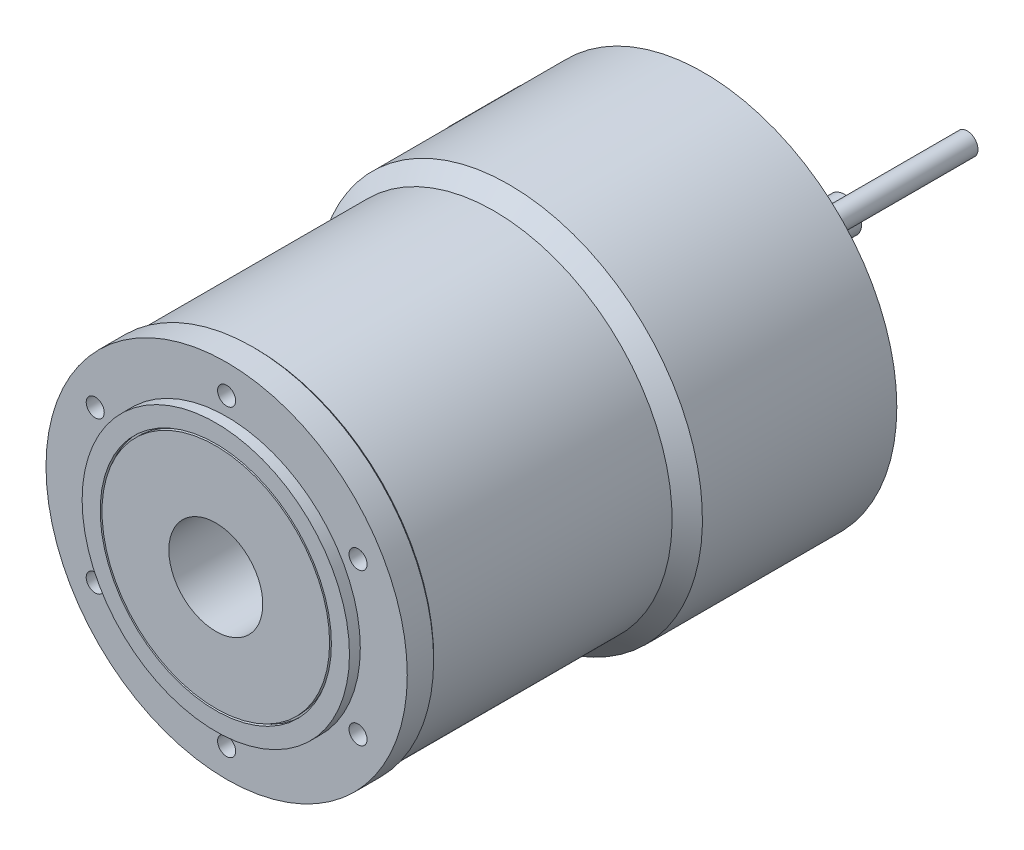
ISO-10303-21;
HEADER;
FILE_DESCRIPTION(('STEP AP214'),'2;1');
FILE_NAME('part.step','',(''),(''),'','','');
FILE_SCHEMA(('AUTOMOTIVE_DESIGN { 1 0 10303 214 1 1 1 1 }'));
ENDSEC;
DATA;
#1=APPLICATION_CONTEXT('core data for automotive mechanical design processes');
#2=APPLICATION_PROTOCOL_DEFINITION('international standard','automotive_design',2000,#1);
#3=PRODUCT_CONTEXT('',#1,'mechanical');
#4=PRODUCT('Part','Part','',(#3));
#5=PRODUCT_RELATED_PRODUCT_CATEGORY('part','',(#4));
#6=PRODUCT_DEFINITION_FORMATION('','',#4);
#7=PRODUCT_DEFINITION_CONTEXT('part definition',#1,'design');
#8=PRODUCT_DEFINITION('design','',#6,#7);
#9=PRODUCT_DEFINITION_SHAPE('','',#8);
#10=(LENGTH_UNIT() NAMED_UNIT(*) SI_UNIT(.MILLI.,.METRE.));
#11=(NAMED_UNIT(*) PLANE_ANGLE_UNIT() SI_UNIT($,.RADIAN.));
#12=(NAMED_UNIT(*) SI_UNIT($,.STERADIAN.) SOLID_ANGLE_UNIT());
#13=UNCERTAINTY_MEASURE_WITH_UNIT(LENGTH_MEASURE(1.E-05),#10,'distance_accuracy_value','');
#14=(GEOMETRIC_REPRESENTATION_CONTEXT(3) GLOBAL_UNCERTAINTY_ASSIGNED_CONTEXT((#13)) GLOBAL_UNIT_ASSIGNED_CONTEXT((#10,
#11,#12)) REPRESENTATION_CONTEXT('',''));
#15=CARTESIAN_POINT('',(0.,0.,0.));
#16=DIRECTION('',(0.,0.,1.));
#17=DIRECTION('',(1.,0.,0.));
#18=AXIS2_PLACEMENT_3D('',#15,#16,#17);
#19=CARTESIAN_POINT('',(-35.447022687,17.543955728,130.));
#20=DIRECTION('',(0.,0.,1.));
#21=DIRECTION('',(0.499999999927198,0.866025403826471,0.));
#22=AXIS2_PLACEMENT_3D('',#19,#20,#21);
#23=PLANE('',#22);
#24=CARTESIAN_POINT('',(-36.373066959,21.,130.));
#25=DIRECTION('',(0.,0.,1.));
#26=DIRECTION('',(1.,0.,0.));
#27=AXIS2_PLACEMENT_3D('',#24,#25,#26);
#28=CIRCLE('',#27,2.5);
#29=CARTESIAN_POINT('',(-33.873066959,21.,130.));
#30=VERTEX_POINT('',#29);
#31=EDGE_CURVE('E19',#30,#30,#28,.F.);
#32=ORIENTED_EDGE('',*,*,#31,.F.);
#33=EDGE_LOOP('',(#32));
#34=FACE_BOUND('',#33,.T.);
#35=ADVANCED_FACE('F15',(#34),#23,.T.);
#36=CARTESIAN_POINT('',(-32.917022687,-21.926044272,130.));
#37=DIRECTION('',(0.,0.,1.));
#38=DIRECTION('',(-0.499999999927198,0.866025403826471,0.));
#39=AXIS2_PLACEMENT_3D('',#36,#37,#38);
#40=PLANE('',#39);
#41=CARTESIAN_POINT('',(-36.373066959,-21.,130.));
#42=DIRECTION('',(0.,0.,1.));
#43=DIRECTION('',(1.,0.,0.));
#44=AXIS2_PLACEMENT_3D('',#41,#42,#43);
#45=CIRCLE('',#44,2.5);
#46=CARTESIAN_POINT('',(-33.873066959,-21.,130.));
#47=VERTEX_POINT('',#46);
#48=EDGE_CURVE('E307',#47,#47,#45,.F.);
#49=ORIENTED_EDGE('',*,*,#48,.F.);
#50=EDGE_LOOP('',(#49));
#51=FACE_BOUND('',#50,.T.);
#52=ADVANCED_FACE('F317',(#51),#40,.T.);
#53=CARTESIAN_POINT('',(2.53,-39.47,130.));
#54=DIRECTION('',(0.,0.,1.));
#55=DIRECTION('',(-1.,0.,0.));
#56=AXIS2_PLACEMENT_3D('',#53,#54,#55);
#57=PLANE('',#56);
#58=CARTESIAN_POINT('',(0.,-42.,130.));
#59=DIRECTION('',(0.,0.,1.));
#60=DIRECTION('',(1.,0.,0.));
#61=AXIS2_PLACEMENT_3D('',#58,#59,#60);
#62=CIRCLE('',#61,2.5);
#63=CARTESIAN_POINT('',(2.5,-42.,130.));
#64=VERTEX_POINT('',#63);
#65=EDGE_CURVE('E305',#64,#64,#62,.F.);
#66=ORIENTED_EDGE('',*,*,#65,.F.);
#67=EDGE_LOOP('',(#66));
#68=FACE_BOUND('',#67,.T.);
#69=ADVANCED_FACE('F323',(#68),#57,.T.);
#70=CARTESIAN_POINT('',(35.447022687,-17.543955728,130.));
#71=DIRECTION('',(0.,0.,1.));
#72=DIRECTION('',(-0.499999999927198,-0.866025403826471,0.));
#73=AXIS2_PLACEMENT_3D('',#70,#71,#72);
#74=PLANE('',#73);
#75=CARTESIAN_POINT('',(36.373066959,-21.,130.));
#76=DIRECTION('',(0.,0.,1.));
#77=DIRECTION('',(1.,0.,0.));
#78=AXIS2_PLACEMENT_3D('',#75,#76,#77);
#79=CIRCLE('',#78,2.5);
#80=CARTESIAN_POINT('',(38.873066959,-21.,130.));
#81=VERTEX_POINT('',#80);
#82=EDGE_CURVE('E302',#81,#81,#79,.F.);
#83=ORIENTED_EDGE('',*,*,#82,.F.);
#84=EDGE_LOOP('',(#83));
#85=FACE_BOUND('',#84,.T.);
#86=ADVANCED_FACE('F1450',(#85),#74,.T.);
#87=CARTESIAN_POINT('',(32.917022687,21.926044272,130.));
#88=DIRECTION('',(0.,0.,1.));
#89=DIRECTION('',(0.499999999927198,-0.866025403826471,0.));
#90=AXIS2_PLACEMENT_3D('',#87,#88,#89);
#91=PLANE('',#90);
#92=CARTESIAN_POINT('',(36.373066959,21.,130.));
#93=DIRECTION('',(0.,0.,1.));
#94=DIRECTION('',(1.,0.,0.));
#95=AXIS2_PLACEMENT_3D('',#92,#93,#94);
#96=CIRCLE('',#95,2.5);
#97=CARTESIAN_POINT('',(38.873066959,21.,130.));
#98=VERTEX_POINT('',#97);
#99=EDGE_CURVE('E299',#98,#98,#96,.F.);
#100=ORIENTED_EDGE('',*,*,#99,.F.);
#101=EDGE_LOOP('',(#100));
#102=FACE_BOUND('',#101,.T.);
#103=ADVANCED_FACE('F1442',(#102),#91,.T.);
#104=CARTESIAN_POINT('',(-2.53,39.47,130.));
#105=DIRECTION('',(0.,0.,1.));
#106=DIRECTION('',(1.,0.,0.));
#107=AXIS2_PLACEMENT_3D('',#104,#105,#106);
#108=PLANE('',#107);
#109=CARTESIAN_POINT('',(0.,42.,130.));
#110=DIRECTION('',(0.,0.,1.));
#111=DIRECTION('',(1.,0.,0.));
#112=AXIS2_PLACEMENT_3D('',#109,#110,#111);
#113=CIRCLE('',#112,2.5);
#114=CARTESIAN_POINT('',(2.5,42.,130.));
#115=VERTEX_POINT('',#114);
#116=EDGE_CURVE('E296',#115,#115,#113,.F.);
#117=ORIENTED_EDGE('',*,*,#116,.F.);
#118=EDGE_LOOP('',(#117));
#119=FACE_BOUND('',#118,.T.);
#120=ADVANCED_FACE('F1435',(#119),#108,.T.);
#121=CARTESIAN_POINT('',(-36.373066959,21.,130.));
#122=DIRECTION('',(0.,0.,1.));
#123=DIRECTION('',(1.,0.,0.));
#124=AXIS2_PLACEMENT_3D('',#121,#122,#123);
#125=CYLINDRICAL_SURFACE('',#124,2.5);
#126=CARTESIAN_POINT('',(-36.373066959,21.,137.));
#127=DIRECTION('',(0.,0.,1.));
#128=DIRECTION('',(1.,0.,0.));
#129=AXIS2_PLACEMENT_3D('',#126,#127,#128);
#130=CIRCLE('',#129,2.5);
#131=CARTESIAN_POINT('',(-33.873066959,21.,137.));
#132=VERTEX_POINT('',#131);
#133=EDGE_CURVE('E293',#132,#132,#130,.F.);
#134=ORIENTED_EDGE('',*,*,#133,.F.);
#135=EDGE_LOOP('',(#134));
#136=FACE_BOUND('',#135,.T.);
#137=ORIENTED_EDGE('',*,*,#31,.T.);
#138=EDGE_LOOP('',(#137));
#139=FACE_BOUND('',#138,.T.);
#140=ADVANCED_FACE('F314',(#136,#139),#125,.F.);
#141=CARTESIAN_POINT('',(-36.373066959,-21.,130.));
#142=DIRECTION('',(0.,0.,1.));
#143=DIRECTION('',(1.,0.,0.));
#144=AXIS2_PLACEMENT_3D('',#141,#142,#143);
#145=CYLINDRICAL_SURFACE('',#144,2.5);
#146=CARTESIAN_POINT('',(-36.373066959,-21.,137.));
#147=DIRECTION('',(0.,0.,1.));
#148=DIRECTION('',(1.,0.,0.));
#149=AXIS2_PLACEMENT_3D('',#146,#147,#148);
#150=CIRCLE('',#149,2.5);
#151=CARTESIAN_POINT('',(-33.873066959,-21.,137.));
#152=VERTEX_POINT('',#151);
#153=EDGE_CURVE('E290',#152,#152,#150,.F.);
#154=ORIENTED_EDGE('',*,*,#153,.F.);
#155=EDGE_LOOP('',(#154));
#156=FACE_BOUND('',#155,.T.);
#157=ORIENTED_EDGE('',*,*,#48,.T.);
#158=EDGE_LOOP('',(#157));
#159=FACE_BOUND('',#158,.T.);
#160=ADVANCED_FACE('F1418',(#156,#159),#145,.F.);
#161=CARTESIAN_POINT('',(0.,-42.,130.));
#162=DIRECTION('',(0.,0.,1.));
#163=DIRECTION('',(1.,0.,0.));
#164=AXIS2_PLACEMENT_3D('',#161,#162,#163);
#165=CYLINDRICAL_SURFACE('',#164,2.5);
#166=CARTESIAN_POINT('',(0.,-42.,137.));
#167=DIRECTION('',(0.,0.,1.));
#168=DIRECTION('',(1.,0.,0.));
#169=AXIS2_PLACEMENT_3D('',#166,#167,#168);
#170=CIRCLE('',#169,2.5);
#171=CARTESIAN_POINT('',(2.5,-42.,137.));
#172=VERTEX_POINT('',#171);
#173=EDGE_CURVE('E287',#172,#172,#170,.F.);
#174=ORIENTED_EDGE('',*,*,#173,.F.);
#175=EDGE_LOOP('',(#174));
#176=FACE_BOUND('',#175,.T.);
#177=ORIENTED_EDGE('',*,*,#65,.T.);
#178=EDGE_LOOP('',(#177));
#179=FACE_BOUND('',#178,.T.);
#180=ADVANCED_FACE('F1409',(#176,#179),#165,.F.);
#181=CARTESIAN_POINT('',(36.373066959,-21.,130.));
#182=DIRECTION('',(0.,0.,1.));
#183=DIRECTION('',(1.,0.,0.));
#184=AXIS2_PLACEMENT_3D('',#181,#182,#183);
#185=CYLINDRICAL_SURFACE('',#184,2.5);
#186=CARTESIAN_POINT('',(36.373066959,-21.,137.));
#187=DIRECTION('',(0.,0.,1.));
#188=DIRECTION('',(1.,0.,0.));
#189=AXIS2_PLACEMENT_3D('',#186,#187,#188);
#190=CIRCLE('',#189,2.5);
#191=CARTESIAN_POINT('',(38.873066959,-21.,137.));
#192=VERTEX_POINT('',#191);
#193=EDGE_CURVE('E284',#192,#192,#190,.F.);
#194=ORIENTED_EDGE('',*,*,#193,.F.);
#195=EDGE_LOOP('',(#194));
#196=FACE_BOUND('',#195,.T.);
#197=ORIENTED_EDGE('',*,*,#82,.T.);
#198=EDGE_LOOP('',(#197));
#199=FACE_BOUND('',#198,.T.);
#200=ADVANCED_FACE('F1400',(#196,#199),#185,.F.);
#201=CARTESIAN_POINT('',(36.373066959,21.,130.));
#202=DIRECTION('',(0.,0.,1.));
#203=DIRECTION('',(1.,0.,0.));
#204=AXIS2_PLACEMENT_3D('',#201,#202,#203);
#205=CYLINDRICAL_SURFACE('',#204,2.5);
#206=CARTESIAN_POINT('',(36.373066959,21.,137.));
#207=DIRECTION('',(0.,0.,1.));
#208=DIRECTION('',(1.,0.,0.));
#209=AXIS2_PLACEMENT_3D('',#206,#207,#208);
#210=CIRCLE('',#209,2.5);
#211=CARTESIAN_POINT('',(38.873066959,21.,137.));
#212=VERTEX_POINT('',#211);
#213=EDGE_CURVE('E281',#212,#212,#210,.F.);
#214=ORIENTED_EDGE('',*,*,#213,.F.);
#215=EDGE_LOOP('',(#214));
#216=FACE_BOUND('',#215,.T.);
#217=ORIENTED_EDGE('',*,*,#99,.T.);
#218=EDGE_LOOP('',(#217));
#219=FACE_BOUND('',#218,.T.);
#220=ADVANCED_FACE('F1391',(#216,#219),#205,.F.);
#221=CARTESIAN_POINT('',(0.,42.,130.));
#222=DIRECTION('',(0.,0.,1.));
#223=DIRECTION('',(1.,0.,0.));
#224=AXIS2_PLACEMENT_3D('',#221,#222,#223);
#225=CYLINDRICAL_SURFACE('',#224,2.5);
#226=CARTESIAN_POINT('',(0.,42.,137.));
#227=DIRECTION('',(0.,0.,1.));
#228=DIRECTION('',(1.,0.,0.));
#229=AXIS2_PLACEMENT_3D('',#226,#227,#228);
#230=CIRCLE('',#229,2.5);
#231=CARTESIAN_POINT('',(2.5,42.,137.));
#232=VERTEX_POINT('',#231);
#233=EDGE_CURVE('E278',#232,#232,#230,.F.);
#234=ORIENTED_EDGE('',*,*,#233,.F.);
#235=EDGE_LOOP('',(#234));
#236=FACE_BOUND('',#235,.T.);
#237=ORIENTED_EDGE('',*,*,#116,.T.);
#238=EDGE_LOOP('',(#237));
#239=FACE_BOUND('',#238,.T.);
#240=ADVANCED_FACE('F1383',(#236,#239),#225,.F.);
#241=CARTESIAN_POINT('',(-50.6,50.6,137.));
#242=DIRECTION('',(0.,0.,1.));
#243=DIRECTION('',(0.,-1.,0.));
#244=AXIS2_PLACEMENT_3D('',#241,#242,#243);
#245=PLANE('',#244);
#246=CARTESIAN_POINT('',(0.,0.,137.));
#247=DIRECTION('',(0.,0.,-1.));
#248=DIRECTION('',(-1.,0.,0.));
#249=AXIS2_PLACEMENT_3D('',#246,#247,#248);
#250=CIRCLE('',#249,37.);
#251=CARTESIAN_POINT('',(-37.,0.,137.));
#252=VERTEX_POINT('',#251);
#253=EDGE_CURVE('E272',#252,#252,#250,.T.);
#254=ORIENTED_EDGE('',*,*,#253,.T.);
#255=EDGE_LOOP('',(#254));
#256=FACE_BOUND('',#255,.T.);
#257=ORIENTED_EDGE('',*,*,#233,.T.);
#258=EDGE_LOOP('',(#257));
#259=FACE_BOUND('',#258,.T.);
#260=ORIENTED_EDGE('',*,*,#213,.T.);
#261=EDGE_LOOP('',(#260));
#262=FACE_BOUND('',#261,.T.);
#263=ORIENTED_EDGE('',*,*,#193,.T.);
#264=EDGE_LOOP('',(#263));
#265=FACE_BOUND('',#264,.T.);
#266=ORIENTED_EDGE('',*,*,#173,.T.);
#267=EDGE_LOOP('',(#266));
#268=FACE_BOUND('',#267,.T.);
#269=ORIENTED_EDGE('',*,*,#153,.T.);
#270=EDGE_LOOP('',(#269));
#271=FACE_BOUND('',#270,.T.);
#272=ORIENTED_EDGE('',*,*,#133,.T.);
#273=EDGE_LOOP('',(#272));
#274=FACE_BOUND('',#273,.T.);
#275=CARTESIAN_POINT('',(0.,0.,137.));
#276=DIRECTION('',(0.,0.,-1.));
#277=DIRECTION('',(-1.,0.,0.));
#278=AXIS2_PLACEMENT_3D('',#275,#276,#277);
#279=CIRCLE('',#278,50.);
#280=CARTESIAN_POINT('',(-50.,0.,137.));
#281=VERTEX_POINT('',#280);
#282=EDGE_CURVE('E275',#281,#281,#279,.F.);
#283=ORIENTED_EDGE('',*,*,#282,.T.);
#284=EDGE_LOOP('',(#283));
#285=FACE_BOUND('',#284,.T.);
#286=ADVANCED_FACE('F1374',(#256,#259,#262,#265,#268,#271,#274,#285),#245,.T.);
#287=CARTESIAN_POINT('',(0.,0.,137.));
#288=DIRECTION('',(0.,0.,-1.));
#289=DIRECTION('',(-1.,0.,0.));
#290=AXIS2_PLACEMENT_3D('',#287,#288,#289);
#291=CYLINDRICAL_SURFACE('',#290,50.);
#292=ORIENTED_EDGE('',*,*,#282,.F.);
#293=EDGE_LOOP('',(#292));
#294=FACE_BOUND('',#293,.T.);
#295=CARTESIAN_POINT('',(0.,0.,129.7));
#296=DIRECTION('',(0.,0.,1.));
#297=DIRECTION('',(0.,-1.,0.));
#298=AXIS2_PLACEMENT_3D('',#295,#296,#297);
#299=CIRCLE('',#298,50.);
#300=CARTESIAN_POINT('',(0.,-50.,129.7));
#301=VERTEX_POINT('',#300);
#302=EDGE_CURVE('E271',#301,#301,#299,.T.);
#303=ORIENTED_EDGE('',*,*,#302,.T.);
#304=EDGE_LOOP('',(#303));
#305=FACE_BOUND('',#304,.T.);
#306=ADVANCED_FACE('F1366',(#294,#305),#291,.T.);
#307=CARTESIAN_POINT('',(0.,0.,140.));
#308=DIRECTION('',(0.,0.,-1.));
#309=DIRECTION('',(-1.,0.,0.));
#310=AXIS2_PLACEMENT_3D('',#307,#308,#309);
#311=CYLINDRICAL_SURFACE('',#310,37.);
#312=CARTESIAN_POINT('',(0.,0.,140.));
#313=DIRECTION('',(0.,0.,-1.));
#314=DIRECTION('',(-1.,0.,0.));
#315=AXIS2_PLACEMENT_3D('',#312,#313,#314);
#316=CIRCLE('',#315,37.);
#317=CARTESIAN_POINT('',(-37.,0.,140.));
#318=VERTEX_POINT('',#317);
#319=EDGE_CURVE('E268',#318,#318,#316,.F.);
#320=ORIENTED_EDGE('',*,*,#319,.F.);
#321=EDGE_LOOP('',(#320));
#322=FACE_BOUND('',#321,.T.);
#323=ORIENTED_EDGE('',*,*,#253,.F.);
#324=EDGE_LOOP('',(#323));
#325=FACE_BOUND('',#324,.T.);
#326=ADVANCED_FACE('F1358',(#322,#325),#311,.T.);
#327=CARTESIAN_POINT('',(0.,0.,129.));
#328=DIRECTION('',(0.,0.,1.));
#329=DIRECTION('',(1.,0.,0.));
#330=AXIS2_PLACEMENT_3D('',#327,#328,#329);
#331=CONICAL_SURFACE('',#330,49.3,0.785398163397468);
#332=CARTESIAN_POINT('',(0.,0.,129.));
#333=DIRECTION('',(0.,0.,-1.));
#334=DIRECTION('',(0.,1.,0.));
#335=AXIS2_PLACEMENT_3D('',#332,#333,#334);
#336=CIRCLE('',#335,49.3);
#337=CARTESIAN_POINT('',(0.,49.3,129.));
#338=VERTEX_POINT('',#337);
#339=EDGE_CURVE('E267',#338,#338,#336,.F.);
#340=ORIENTED_EDGE('',*,*,#339,.T.);
#341=EDGE_LOOP('',(#340));
#342=FACE_BOUND('',#341,.T.);
#343=ORIENTED_EDGE('',*,*,#302,.F.);
#344=EDGE_LOOP('',(#343));
#345=FACE_BOUND('',#344,.T.);
#346=ADVANCED_FACE('F1350',(#342,#345),#331,.T.);
#347=CARTESIAN_POINT('',(-37.444,37.444,140.));
#348=DIRECTION('',(0.,0.,1.));
#349=DIRECTION('',(0.,-1.,0.));
#350=AXIS2_PLACEMENT_3D('',#347,#348,#349);
#351=PLANE('',#350);
#352=CARTESIAN_POINT('',(0.,0.,140.));
#353=DIRECTION('',(0.,0.,1.));
#354=DIRECTION('',(1.,0.,0.));
#355=AXIS2_PLACEMENT_3D('',#352,#353,#354);
#356=CIRCLE('',#355,32.);
#357=CARTESIAN_POINT('',(32.,0.,140.));
#358=VERTEX_POINT('',#357);
#359=EDGE_CURVE('E244',#358,#358,#356,.T.);
#360=ORIENTED_EDGE('',*,*,#359,.F.);
#361=EDGE_LOOP('',(#360));
#362=FACE_BOUND('',#361,.T.);
#363=ORIENTED_EDGE('',*,*,#319,.T.);
#364=EDGE_LOOP('',(#363));
#365=FACE_BOUND('',#364,.T.);
#366=ADVANCED_FACE('F1343',(#362,#365),#351,.T.);
#367=CARTESIAN_POINT('',(0.,0.,36.));
#368=DIRECTION('',(0.,0.,-1.));
#369=DIRECTION('',(-1.,0.,0.));
#370=AXIS2_PLACEMENT_3D('',#367,#368,#369);
#371=CYLINDRICAL_SURFACE('',#370,53.6);
#372=DIRECTION('',(0.,0.,1.));
#373=VECTOR('',#372,1.);
#374=CARTESIAN_POINT('',(-39.649850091,36.06728972,26.));
#375=LINE('',#374,#373);
#376=CARTESIAN_POINT('',(-39.6498500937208,36.0672897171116,16.));
#377=VERTEX_POINT('',#376);
#378=CARTESIAN_POINT('',(-39.6498500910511,36.0672897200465,36.));
#379=VERTEX_POINT('',#378);
#380=EDGE_CURVE('E258',#377,#379,#375,.T.);
#381=ORIENTED_EDGE('',*,*,#380,.F.);
#382=CARTESIAN_POINT('',(0.,0.,16.));
#383=DIRECTION('',(0.,0.,-1.));
#384=DIRECTION('',(-1.,0.,0.));
#385=AXIS2_PLACEMENT_3D('',#382,#383,#384);
#386=CIRCLE('',#385,53.6);
#387=CARTESIAN_POINT('',(-53.5414476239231,2.50467289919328,16.));
#388=VERTEX_POINT('',#387);
#389=EDGE_CURVE('E240',#388,#377,#386,.T.);
#390=ORIENTED_EDGE('',*,*,#389,.F.);
#391=DIRECTION('',(0.,0.,1.));
#392=VECTOR('',#391,1.);
#393=CARTESIAN_POINT('',(-53.541447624,2.504672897,26.));
#394=LINE('',#393,#392);
#395=CARTESIAN_POINT('',(-53.5414476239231,2.50467289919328,36.));
#396=VERTEX_POINT('',#395);
#397=EDGE_CURVE('E233',#388,#396,#394,.T.);
#398=ORIENTED_EDGE('',*,*,#397,.T.);
#399=CARTESIAN_POINT('',(0.,0.,36.));
#400=DIRECTION('',(0.,0.,-1.));
#401=DIRECTION('',(-1.,0.,0.));
#402=AXIS2_PLACEMENT_3D('',#399,#400,#401);
#403=CIRCLE('',#402,53.6);
#404=EDGE_CURVE('E237',#379,#396,#403,.F.);
#405=ORIENTED_EDGE('',*,*,#404,.F.);
#406=EDGE_LOOP('',(#381,#390,#398,#405));
#407=FACE_BOUND('',#406,.T.);
#408=ADVANCED_FACE('F235',(#407),#371,.T.);
#409=CARTESIAN_POINT('',(0.,0.,33.305904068));
#410=DIRECTION('',(0.,0.,-1.));
#411=DIRECTION('',(-1.,0.,0.));
#412=AXIS2_PLACEMENT_3D('',#409,#410,#411);
#413=CYLINDRICAL_SURFACE('',#412,53.6);
#414=CARTESIAN_POINT('',(-46.6763518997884,-26.3491588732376,16.));
#415=CARTESIAN_POINT('',(-46.6597666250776,-26.3785388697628,16.0000044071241));
#416=CARTESIAN_POINT('',(-46.6431645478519,-26.4078838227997,16.0010922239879));
#417=CARTESIAN_POINT('',(-46.6099378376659,-26.4664851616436,16.0054217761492));
#418=CARTESIAN_POINT('',(-46.5933132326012,-26.4957412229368,16.008668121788));
#419=CARTESIAN_POINT('',(-46.5337733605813,-26.6002899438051,16.024156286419));
#420=CARTESIAN_POINT('',(-46.4910289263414,-26.6749170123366,16.0424965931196));
#421=CARTESIAN_POINT('',(-46.4282852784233,-26.7838778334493,16.0806101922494));
#422=CARTESIAN_POINT('',(-46.4075715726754,-26.8197495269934,16.0951096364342));
#423=CARTESIAN_POINT('',(-46.3667848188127,-26.8902010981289,16.1276906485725));
#424=CARTESIAN_POINT('',(-46.3467114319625,-26.92478166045,16.1457702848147));
#425=CARTESIAN_POINT('',(-46.3074818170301,-26.9921959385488,16.1853098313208));
#426=CARTESIAN_POINT('',(-46.2883213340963,-27.025037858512,16.2067515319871));
#427=CARTESIAN_POINT('',(-46.2510348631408,-27.0888009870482,16.2531047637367));
#428=CARTESIAN_POINT('',(-46.2329086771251,-27.1197225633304,16.278015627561));
#429=CARTESIAN_POINT('',(-46.1979166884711,-27.1792877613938,16.3310711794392));
#430=CARTESIAN_POINT('',(-46.1810481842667,-27.2079362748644,16.3592085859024));
#431=CARTESIAN_POINT('',(-46.1487677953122,-27.2626528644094,16.4187315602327));
#432=CARTESIAN_POINT('',(-46.1333573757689,-27.2887183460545,16.4501203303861));
#433=CARTESIAN_POINT('',(-46.1080740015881,-27.3314097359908,16.5073548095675));
#434=CARTESIAN_POINT('',(-46.0978042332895,-27.3487259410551,16.5325146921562));
#435=CARTESIAN_POINT('',(-46.0782942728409,-27.3815843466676,16.5843628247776));
#436=CARTESIAN_POINT('',(-46.0690543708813,-27.3971260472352,16.6110515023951));
#437=CARTESIAN_POINT('',(-46.0517421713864,-27.4262161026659,16.6658274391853));
#438=CARTESIAN_POINT('',(-46.0436688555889,-27.4397661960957,16.6939134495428));
#439=CARTESIAN_POINT('',(-46.0287982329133,-27.4647036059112,16.7513397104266));
#440=CARTESIAN_POINT('',(-46.0220002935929,-27.4760919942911,16.7806793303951));
#441=CARTESIAN_POINT('',(-46.0097166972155,-27.4966564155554,16.8405931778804));
#442=CARTESIAN_POINT('',(-46.0042390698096,-27.505818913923,16.8711737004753));
#443=CARTESIAN_POINT('',(-45.9947119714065,-27.5217469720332,16.9331484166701));
#444=CARTESIAN_POINT('',(-45.9906614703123,-27.5285142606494,16.964542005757));
#445=CARTESIAN_POINT('',(-45.9840964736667,-27.5394791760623,17.0279259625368));
#446=CARTESIAN_POINT('',(-45.9815813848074,-27.543677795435,17.0599160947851));
#447=CARTESIAN_POINT('',(-45.9781139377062,-27.5494654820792,17.1242097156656));
#448=CARTESIAN_POINT('',(-45.9771618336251,-27.5510541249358,17.1565132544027));
#449=CARTESIAN_POINT('',(-45.9766601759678,-27.5518916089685,17.2478744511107));
#450=CARTESIAN_POINT('',(-45.978916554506,-27.5481275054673,17.3070104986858));
#451=CARTESIAN_POINT('',(-45.9886503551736,-27.53187464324,17.423672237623));
#452=CARTESIAN_POINT('',(-45.9961323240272,-27.5193782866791,17.4811964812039));
#453=CARTESIAN_POINT('',(-46.0105061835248,-27.495334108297,17.5632235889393));
#454=CARTESIAN_POINT('',(-46.0155895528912,-27.4868265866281,17.5889944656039));
#455=CARTESIAN_POINT('',(-46.0267372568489,-27.4681556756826,17.6397187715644));
#456=CARTESIAN_POINT('',(-46.0328015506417,-27.4579923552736,17.6646722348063));
#457=CARTESIAN_POINT('',(-46.0458407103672,-27.4361206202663,17.7135736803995));
#458=CARTESIAN_POINT('',(-46.0528135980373,-27.4244155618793,17.7375237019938));
#459=CARTESIAN_POINT('',(-46.0676049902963,-27.39956166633,17.7843885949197));
#460=CARTESIAN_POINT('',(-46.075423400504,-27.3864129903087,17.8073035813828));
#461=CARTESIAN_POINT('',(-46.0836278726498,-27.3726002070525,17.8296606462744));
#462=B_SPLINE_CURVE_WITH_KNOTS('',3,(#414,#415,#416,#417,#418,#419,#420,#421,#422,#423,#424,
#425,#426,#427,#428,#429,#430,#431,#432,#433,#434,#435,#436,#437,#438,#439,#440,#441,#442,#443,
#444,#445,#446,#447,#448,#449,#450,#451,#452,#453,#454,#455,#456,#457,#458,#459,#460,#461),
.UNSPECIFIED.,.F.,.F.,(4,2,2,2,2,2,2,2,2,2,2,2,2,2,2,2,2,2,2,2,2,2,2,4),(0.,0.101152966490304,
0.202522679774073,0.464857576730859,0.596393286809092,0.72785821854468,0.858634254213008,
0.989385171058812,1.11984661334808,1.25043779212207,1.34701306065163,1.44361547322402,
1.54013304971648,1.63660263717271,1.73364489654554,1.83061696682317,1.92755154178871,
2.02450187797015,2.20146239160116,2.378577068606,2.46134988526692,2.54411926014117,
2.62671134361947,2.70929421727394),.UNSPECIFIED.);
#463=CARTESIAN_POINT('',(-46.6763519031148,-26.3491588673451,16.));
#464=VERTEX_POINT('',#463);
#465=CARTESIAN_POINT('',(-46.0836278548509,-27.3726002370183,17.829660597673));
#466=VERTEX_POINT('',#465);
#467=EDGE_CURVE('E565',#464,#466,#462,.T.);
#468=ORIENTED_EDGE('',*,*,#467,.T.);
#469=CARTESIAN_POINT('',(-49.9746554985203,-19.377662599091,30.7760696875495));
#470=CARTESIAN_POINT('',(-49.9613259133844,-19.412039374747,30.7204024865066));
#471=CARTESIAN_POINT('',(-49.9479571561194,-19.4464119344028,30.6647421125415));
#472=CARTESIAN_POINT('',(-49.8809170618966,-19.6182539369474,30.3864739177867));
#473=CARTESIAN_POINT('',(-49.8266572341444,-19.7556598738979,30.163968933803));
#474=CARTESIAN_POINT('',(-49.5521903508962,-20.4423697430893,29.0519618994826));
#475=CARTESIAN_POINT('',(-49.3225085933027,-20.9906404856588,28.1641329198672));
#476=CARTESIAN_POINT('',(-48.8672173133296,-22.028210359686,26.4839692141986));
#477=CARTESIAN_POINT('',(-48.643634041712,-22.5177557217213,25.6912357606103));
#478=CARTESIAN_POINT('',(-48.1794090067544,-23.4946158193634,24.1093809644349));
#479=CARTESIAN_POINT('',(-47.9387671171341,-23.9819305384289,23.3202596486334));
#480=CARTESIAN_POINT('',(-47.4396353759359,-24.954766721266,21.7449208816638));
#481=CARTESIAN_POINT('',(-47.1811209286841,-25.4402847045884,20.9587090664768));
#482=CARTESIAN_POINT('',(-46.6460390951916,-26.4085729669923,19.3907348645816));
#483=CARTESIAN_POINT('',(-46.369471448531,-26.8913432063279,18.6089725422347));
#484=CARTESIAN_POINT('',(-46.0836278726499,-27.3726002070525,17.8296606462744));
#485=B_SPLINE_CURVE_WITH_KNOTS('',3,(#469,#470,#471,#472,#473,#474,#475,#476,#477,#478,#479,
#480,#481,#482,#483,#484),.UNSPECIFIED.,.F.,.F.,(4,2,2,2,2,2,2,4),(0.,0.200310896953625,
1.00155665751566,4.20668291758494,7.08101503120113,9.95536842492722,12.8337593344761,
15.7121917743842),.UNSPECIFIED.);
#486=CARTESIAN_POINT('',(-49.9746554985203,-19.377662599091,30.7760696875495));
#487=VERTEX_POINT('',#486);
#488=EDGE_CURVE('E559',#487,#466,#485,.T.);
#489=ORIENTED_EDGE('',*,*,#488,.F.);
#490=CARTESIAN_POINT('',(-49.9746554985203,-19.377662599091,30.7760696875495));
#491=CARTESIAN_POINT('',(-49.9880977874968,-19.3429949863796,30.8322196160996));
#492=CARTESIAN_POINT('',(-50.00190449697,-19.3072808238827,30.8876467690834));
#493=CARTESIAN_POINT('',(-50.0444574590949,-19.1968363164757,31.0520065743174));
#494=CARTESIAN_POINT('',(-50.0742488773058,-19.1190281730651,31.1586212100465));
#495=CARTESIAN_POINT('',(-50.1363156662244,-18.9556714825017,31.3650349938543));
#496=CARTESIAN_POINT('',(-50.1685921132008,-18.8701195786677,31.4648311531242));
#497=CARTESIAN_POINT('',(-50.2352243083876,-18.6920109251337,31.6571104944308));
#498=CARTESIAN_POINT('',(-50.2695790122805,-18.5994576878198,31.7495972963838));
#499=CARTESIAN_POINT('',(-50.3400092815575,-18.4079840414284,31.9269986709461));
#500=CARTESIAN_POINT('',(-50.3760847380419,-18.3090640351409,32.0119137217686));
#501=CARTESIAN_POINT('',(-50.4496755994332,-18.1053019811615,32.173645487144));
#502=CARTESIAN_POINT('',(-50.4871910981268,-18.0004595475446,32.2504616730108));
#503=CARTESIAN_POINT('',(-50.563315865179,-17.7855019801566,32.3956427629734));
#504=CARTESIAN_POINT('',(-50.6019248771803,-17.6753880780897,32.4640096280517));
#505=CARTESIAN_POINT('',(-50.6797929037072,-17.4508648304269,32.5920412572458));
#506=CARTESIAN_POINT('',(-50.7190499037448,-17.3364677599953,32.6517288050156));
#507=CARTESIAN_POINT('',(-50.7981399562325,-17.1033371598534,32.7623410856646));
#508=CARTESIAN_POINT('',(-50.8379741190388,-16.984594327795,32.8132455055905));
#509=CARTESIAN_POINT('',(-50.9178653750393,-16.7435708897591,32.9058342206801));
#510=CARTESIAN_POINT('',(-50.9579226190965,-16.621287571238,32.9475112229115));
#511=CARTESIAN_POINT('',(-51.0787364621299,-16.2478074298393,33.0593662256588));
#512=CARTESIAN_POINT('',(-51.1594166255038,-15.9920903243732,33.1153727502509));
#513=CARTESIAN_POINT('',(-51.2786258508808,-15.6038800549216,33.1693980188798));
#514=CARTESIAN_POINT('',(-51.3181053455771,-15.4735496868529,33.1824066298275));
#515=CARTESIAN_POINT('',(-51.3962426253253,-15.211996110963,33.1984148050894));
#516=CARTESIAN_POINT('',(-51.4349003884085,-15.0807728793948,33.2014141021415));
#517=CARTESIAN_POINT('',(-51.5169087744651,-14.7984074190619,33.1971202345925));
#518=CARTESIAN_POINT('',(-51.5600902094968,-14.6472392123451,33.1882103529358));
#519=CARTESIAN_POINT('',(-51.6447757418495,-14.3457882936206,33.1567866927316));
#520=CARTESIAN_POINT('',(-51.6862794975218,-14.1955057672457,33.1342701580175));
#521=CARTESIAN_POINT('',(-51.7470201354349,-13.9718244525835,33.0904709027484));
#522=CARTESIAN_POINT('',(-51.767000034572,-13.8976096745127,33.0742164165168));
#523=CARTESIAN_POINT('',(-51.8064461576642,-13.7498358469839,33.0384339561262));
#524=CARTESIAN_POINT('',(-51.8259123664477,-13.6762768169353,33.0189058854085));
#525=CARTESIAN_POINT('',(-51.8834778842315,-13.4568771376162,32.9553886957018));
#526=CARTESIAN_POINT('',(-51.9207727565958,-13.3122081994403,32.9064459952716));
#527=CARTESIAN_POINT('',(-51.9741204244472,-13.1017464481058,32.8244440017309));
#528=CARTESIAN_POINT('',(-51.9911049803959,-13.0341772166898,32.7964184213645));
#529=CARTESIAN_POINT('',(-52.0245087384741,-12.9002034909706,32.7374276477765));
#530=CARTESIAN_POINT('',(-52.0409280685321,-12.8337987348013,32.706463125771));
#531=CARTESIAN_POINT('',(-52.0731931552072,-12.702249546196,32.6416485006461));
#532=CARTESIAN_POINT('',(-52.0890387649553,-12.6371054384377,32.6077976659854));
#533=CARTESIAN_POINT('',(-52.120143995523,-12.5081968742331,32.53729127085));
#534=CARTESIAN_POINT('',(-52.1354034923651,-12.4444327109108,32.5006351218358));
#535=CARTESIAN_POINT('',(-52.1792363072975,-12.2598085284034,32.3891379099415));
#536=CARTESIAN_POINT('',(-52.2069895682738,-12.1410152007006,32.3104966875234));
#537=CARTESIAN_POINT('',(-52.2601473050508,-11.9101243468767,32.1431452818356));
#538=CARTESIAN_POINT('',(-52.2855507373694,-11.7980298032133,32.0544306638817));
#539=CARTESIAN_POINT('',(-52.3339769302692,-11.5813292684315,31.8676444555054));
#540=CARTESIAN_POINT('',(-52.3569991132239,-11.476725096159,31.7695706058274));
#541=CARTESIAN_POINT('',(-52.4006251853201,-11.2758605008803,31.5648120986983));
#542=CARTESIAN_POINT('',(-52.421230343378,-11.1795957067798,31.4581320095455));
#543=CARTESIAN_POINT('',(-52.4564000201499,-11.0132621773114,31.2571201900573));
#544=CARTESIAN_POINT('',(-52.4713775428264,-10.941637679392,31.1641431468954));
#545=CARTESIAN_POINT('',(-52.499677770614,-10.805029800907,30.9735227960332));
#546=CARTESIAN_POINT('',(-52.5130042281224,-10.7400314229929,30.8758907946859));
#547=CARTESIAN_POINT('',(-52.5255320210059,-10.6784121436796,30.7760696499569));
#548=B_SPLINE_CURVE_WITH_KNOTS('',3,(#490,#491,#492,#493,#494,#495,#496,#497,#498,#499,#500,
#501,#502,#503,#504,#505,#506,#507,#508,#509,#510,#511,#512,#513,#514,#515,#516,#517,#518,#519,
#520,#521,#522,#523,#524,#525,#526,#527,#528,#529,#530,#531,#532,#533,#534,#535,#536,#537,#538,
#539,#540,#541,#542,#543,#544,#545,#546,#547),.UNSPECIFIED.,.F.,.F.,(4,2,2,2,2,2,2,2,2,2,2,2,2,
2,2,2,2,2,2,2,2,2,2,2,2,2,2,2,4),(0.,0.2020455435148,0.60752385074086,1.01317876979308,
1.41863151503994,1.82405863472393,2.22951220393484,2.63487149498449,3.03914670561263,
3.44434471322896,3.8498618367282,4.66815663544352,5.07826046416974,5.48837524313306,
5.96020375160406,6.43212786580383,6.6677352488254,6.90334958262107,7.37424500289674,
7.59948354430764,7.82467076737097,8.04991523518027,8.27520708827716,8.71007973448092,
9.14514457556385,9.58031470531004,10.0152553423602,10.3699246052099,10.7237724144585),.UNSPECIFIED.);
#549=CARTESIAN_POINT('',(-52.5255320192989,-10.6784121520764,30.7760696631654));
#550=VERTEX_POINT('',#549);
#551=EDGE_CURVE('E590',#487,#550,#548,.T.);
#552=ORIENTED_EDGE('',*,*,#551,.T.);
#553=CARTESIAN_POINT('',(-53.532784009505,-2.68347464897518,17.829660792));
#554=CARTESIAN_POINT('',(-53.5310265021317,-2.71853525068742,17.8864353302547));
#555=CARTESIAN_POINT('',(-53.5292344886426,-2.75359538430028,17.9432091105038));
#556=CARTESIAN_POINT('',(-53.5201018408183,-2.92889388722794,18.2270745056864));
#557=CARTESIAN_POINT('',(-53.5122435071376,-3.06912491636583,18.4541542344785));
#558=CARTESIAN_POINT('',(-53.4954215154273,-3.34956859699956,18.9082839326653));
#559=CARTESIAN_POINT('',(-53.4864578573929,-3.48978124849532,19.1353339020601));
#560=CARTESIAN_POINT('',(-53.4674241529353,-3.77018589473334,19.589400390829));
#561=CARTESIAN_POINT('',(-53.4573541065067,-3.9103778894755,19.8164169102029));
#562=CARTESIAN_POINT('',(-53.4361064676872,-4.19073848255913,20.2704120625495));
#563=CARTESIAN_POINT('',(-53.4249288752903,-4.33090708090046,20.4973906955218));
#564=CARTESIAN_POINT('',(-53.3662670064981,-5.03170632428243,21.6322130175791));
#565=CARTESIAN_POINT('',(-53.3104650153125,-5.59215095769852,22.5397554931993));
#566=CARTESIAN_POINT('',(-53.1584539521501,-6.90777063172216,24.6701724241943));
#567=CARTESIAN_POINT('',(-53.054940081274,-7.66271479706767,25.8926730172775));
#568=CARTESIAN_POINT('',(-52.8150150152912,-9.17155404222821,28.3359753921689));
#569=CARTESIAN_POINT('',(-52.6785866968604,-9.92544836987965,29.5567759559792));
#570=CARTESIAN_POINT('',(-52.5255320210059,-10.6784121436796,30.7760696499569));
#571=B_SPLINE_CURVE_WITH_KNOTS('',3,(#553,#554,#555,#556,#557,#558,#559,#560,#561,#562,#563,
#564,#565,#566,#567,#568,#569,#570),.UNSPECIFIED.,.F.,.F.,(4,2,2,2,2,2,2,2,4),(0.,
0.200252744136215,1.0012653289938,1.80227791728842,2.60329050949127,3.40430310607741,
6.60845780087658,10.9297044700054,15.2532040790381),.UNSPECIFIED.);
#572=CARTESIAN_POINT('',(-53.5327840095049,-2.68347464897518,17.829660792));
#573=VERTEX_POINT('',#572);
#574=EDGE_CURVE('E538',#573,#550,#571,.T.);
#575=ORIENTED_EDGE('',*,*,#574,.F.);
#576=CARTESIAN_POINT('',(-53.5327840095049,-2.68347464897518,17.829660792));
#577=CARTESIAN_POINT('',(-53.5336743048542,-2.66571182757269,17.8009230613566));
#578=CARTESIAN_POINT('',(-53.5344951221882,-2.64916261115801,17.7714303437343));
#579=CARTESIAN_POINT('',(-53.5359993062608,-2.61859050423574,17.7110929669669));
#580=CARTESIAN_POINT('',(-53.5366824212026,-2.60457224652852,17.6802459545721));
#581=CARTESIAN_POINT('',(-53.5379086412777,-2.57924379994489,17.6175066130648));
#582=CARTESIAN_POINT('',(-53.5384519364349,-2.56792993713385,17.5856157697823));
#583=CARTESIAN_POINT('',(-53.5394045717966,-2.54799086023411,17.5209992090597));
#584=CARTESIAN_POINT('',(-53.5398138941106,-2.53936600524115,17.4882733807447));
#585=CARTESIAN_POINT('',(-53.540497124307,-2.52491995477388,17.4221779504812));
#586=CARTESIAN_POINT('',(-53.5407709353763,-2.51910076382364,17.3888079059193));
#587=CARTESIAN_POINT('',(-53.541182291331,-2.51034186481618,17.3216876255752));
#588=CARTESIAN_POINT('',(-53.5413197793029,-2.50740335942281,17.2879372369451));
#589=CARTESIAN_POINT('',(-53.5415315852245,-2.5028820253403,17.1869321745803));
#590=CARTESIAN_POINT('',(-53.5414101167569,-2.50548917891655,17.1194380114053));
#591=CARTESIAN_POINT('',(-53.5406342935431,-2.52201169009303,16.985879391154));
#592=CARTESIAN_POINT('',(-53.5399799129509,-2.53592759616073,16.9198150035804));
#593=CARTESIAN_POINT('',(-53.5381310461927,-2.57466468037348,16.7908896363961));
#594=CARTESIAN_POINT('',(-53.5369359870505,-2.59949742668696,16.7280321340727));
#595=CARTESIAN_POINT('',(-53.5339965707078,-2.65934286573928,16.607375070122));
#596=CARTESIAN_POINT('',(-53.5322521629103,-2.6943564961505,16.5495759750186));
#597=CARTESIAN_POINT('',(-53.5282069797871,-2.7735579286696,16.4406897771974));
#598=CARTESIAN_POINT('',(-53.5259063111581,-2.81774397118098,16.3896013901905));
#599=CARTESIAN_POINT('',(-53.5207521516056,-2.91400200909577,16.2955292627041));
#600=CARTESIAN_POINT('',(-53.5178986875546,-2.96607362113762,16.2525451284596));
#601=CARTESIAN_POINT('',(-53.5116421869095,-3.07688759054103,16.1757456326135));
#602=CARTESIAN_POINT('',(-53.5082368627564,-3.13565739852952,16.1419700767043));
#603=CARTESIAN_POINT('',(-53.5009266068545,-3.2580061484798,16.0847633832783));
#604=CARTESIAN_POINT('',(-53.4970217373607,-3.32158449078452,16.0613309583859));
#605=CARTESIAN_POINT('',(-53.4896025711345,-3.43876982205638,16.0290031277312));
#606=CARTESIAN_POINT('',(-53.4861646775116,-3.49185005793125,16.0181450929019));
#607=CARTESIAN_POINT('',(-53.479067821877,-3.5989211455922,16.0036385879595));
#608=CARTESIAN_POINT('',(-53.4754090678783,-3.65291110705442,15.9999834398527));
#609=CARTESIAN_POINT('',(-53.471663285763,-3.70691589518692,16.));
#610=B_SPLINE_CURVE_WITH_KNOTS('',3,(#576,#577,#578,#579,#580,#581,#582,#583,#584,#585,#586,
#587,#588,#589,#590,#591,#592,#593,#594,#595,#596,#597,#598,#599,#600,#601,#602,#603,#604,#605,
#606,#607,#608,#609),.UNSPECIFIED.,.F.,.F.,(4,2,2,2,2,2,2,2,2,2,2,2,2,2,2,2,4),(0.,
0.101361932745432,0.202907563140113,0.304314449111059,0.405734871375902,0.507227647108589,
0.608762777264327,0.81036157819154,1.01197015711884,1.21379289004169,1.41563421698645,
1.61743685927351,1.81922969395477,2.0218814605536,2.22450799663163,2.38690073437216,
2.54914284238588),.UNSPECIFIED.);
#611=CARTESIAN_POINT('',(-53.4716632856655,-3.70691589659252,16.));
#612=VERTEX_POINT('',#611);
#613=EDGE_CURVE('E530',#573,#612,#610,.T.);
#614=ORIENTED_EDGE('',*,*,#613,.T.);
#615=CARTESIAN_POINT('',(0.,0.,16.));
#616=DIRECTION('',(0.,0.,-1.));
#617=DIRECTION('',(-1.,0.,0.));
#618=AXIS2_PLACEMENT_3D('',#615,#616,#617);
#619=CIRCLE('',#618,53.6);
#620=EDGE_CURVE('E571',#464,#612,#619,.T.);
#621=ORIENTED_EDGE('',*,*,#620,.F.);
#622=EDGE_LOOP('',(#468,#489,#552,#575,#614,#621));
#623=FACE_BOUND('',#622,.T.);
#624=ADVANCED_FACE('F545',(#623),#413,.T.);
#625=CARTESIAN_POINT('',(0.,0.,129.));
#626=DIRECTION('',(0.,0.,-1.));
#627=DIRECTION('',(-1.,0.,0.));
#628=AXIS2_PLACEMENT_3D('',#625,#626,#627);
#629=CYLINDRICAL_SURFACE('',#628,49.3);
#630=ORIENTED_EDGE('',*,*,#339,.F.);
#631=EDGE_LOOP('',(#630));
#632=FACE_BOUND('',#631,.T.);
#633=CARTESIAN_POINT('',(0.,0.,62.9999999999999));
#634=DIRECTION('',(0.,0.,-1.));
#635=DIRECTION('',(0.,1.,0.));
#636=AXIS2_PLACEMENT_3D('',#633,#634,#635);
#637=CIRCLE('',#636,49.3);
#638=CARTESIAN_POINT('',(0.,49.3,63.));
#639=VERTEX_POINT('',#638);
#640=EDGE_CURVE('E598',#639,#639,#637,.F.);
#641=ORIENTED_EDGE('',*,*,#640,.T.);
#642=EDGE_LOOP('',(#641));
#643=FACE_BOUND('',#642,.T.);
#644=ADVANCED_FACE('F550',(#632,#643),#629,.T.);
#645=CARTESIAN_POINT('',(0.,0.,139.));
#646=DIRECTION('',(0.,0.,1.));
#647=DIRECTION('',(1.,0.,0.));
#648=AXIS2_PLACEMENT_3D('',#645,#646,#647);
#649=CYLINDRICAL_SURFACE('',#648,32.);
#650=ORIENTED_EDGE('',*,*,#359,.T.);
#651=EDGE_LOOP('',(#650));
#652=FACE_BOUND('',#651,.T.);
#653=CARTESIAN_POINT('',(0.,0.,139.));
#654=DIRECTION('',(0.,0.,1.));
#655=DIRECTION('',(1.,0.,0.));
#656=AXIS2_PLACEMENT_3D('',#653,#654,#655);
#657=CIRCLE('',#656,32.);
#658=CARTESIAN_POINT('',(32.,0.,139.));
#659=VERTEX_POINT('',#658);
#660=EDGE_CURVE('E596',#659,#659,#657,.T.);
#661=ORIENTED_EDGE('',*,*,#660,.F.);
#662=EDGE_LOOP('',(#661));
#663=FACE_BOUND('',#662,.T.);
#664=ADVANCED_FACE('F858',(#652,#663),#649,.F.);
#665=CARTESIAN_POINT('',(-53.441556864,2.5,36.));
#666=DIRECTION('',(0.0467289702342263,0.998907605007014,0.));
#667=DIRECTION('',(0.,0.,-1.));
#668=AXIS2_PLACEMENT_3D('',#665,#666,#667);
#669=PLANE('',#668);
#670=DIRECTION('',(0.,0.,-1.));
#671=VECTOR('',#670,1.);
#672=CARTESIAN_POINT('',(-53.4415568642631,2.49999998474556,31.9));
#673=LINE('',#672,#671);
#674=CARTESIAN_POINT('',(-53.4415568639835,2.49999999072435,16.0000000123));
#675=VERTEX_POINT('',#674);
#676=CARTESIAN_POINT('',(-53.4415568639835,2.49999999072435,35.9999999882));
#677=VERTEX_POINT('',#676);
#678=EDGE_CURVE('E250',#675,#677,#673,.F.);
#679=ORIENTED_EDGE('',*,*,#678,.T.);
#680=DIRECTION('',(0.998907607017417,-0.0467289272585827,0.));
#681=VECTOR('',#680,1.);
#682=CARTESIAN_POINT('',(-53.5414476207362,2.50467290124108,36.));
#683=LINE('',#682,#681);
#684=EDGE_CURVE('E243',#396,#677,#683,.T.);
#685=ORIENTED_EDGE('',*,*,#684,.F.);
#686=ORIENTED_EDGE('',*,*,#397,.F.);
#687=DIRECTION('',(-0.998907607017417,0.0467289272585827,0.));
#688=VECTOR('',#687,1.);
#689=CARTESIAN_POINT('',(-53.4415568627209,2.50000000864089,16.));
#690=LINE('',#689,#688);
#691=EDGE_CURVE('E882',#675,#388,#690,.T.);
#692=ORIENTED_EDGE('',*,*,#691,.F.);
#693=EDGE_LOOP('',(#679,#685,#686,#692));
#694=FACE_BOUND('',#693,.T.);
#695=ADVANCED_FACE('F248',(#694),#669,.F.);
#696=CARTESIAN_POINT('',(-53.625241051,2.298596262,36.));
#697=DIRECTION('',(0.,0.,1.));
#698=DIRECTION('',(1.,0.,0.));
#699=AXIS2_PLACEMENT_3D('',#696,#697,#698);
#700=PLANE('',#699);
#701=DIRECTION('',(0.739736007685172,-0.672897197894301,0.));
#702=VECTOR('',#701,1.);
#703=CARTESIAN_POINT('',(-39.6128632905,36.03364486,36.));
#704=LINE('',#703,#702);
#705=CARTESIAN_POINT('',(-39.5758764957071,35.9999999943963,35.9999999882));
#706=VERTEX_POINT('',#705);
#707=EDGE_CURVE('E256',#379,#706,#704,.T.);
#708=ORIENTED_EDGE('',*,*,#707,.F.);
#709=ORIENTED_EDGE('',*,*,#404,.T.);
#710=ORIENTED_EDGE('',*,*,#684,.T.);
#711=CARTESIAN_POINT('',(0.,0.,35.9999999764));
#712=DIRECTION('',(0.,0.,-1.));
#713=DIRECTION('',(-1.,0.,0.));
#714=AXIS2_PLACEMENT_3D('',#711,#712,#713);
#715=CIRCLE('',#714,53.5);
#716=EDGE_CURVE('E594',#677,#706,#715,.T.);
#717=ORIENTED_EDGE('',*,*,#716,.T.);
#718=EDGE_LOOP('',(#708,#709,#710,#717));
#719=FACE_BOUND('',#718,.T.);
#720=ADVANCED_FACE('F254',(#719),#700,.T.);
#721=CARTESIAN_POINT('',(-39.57587649,36.,36.));
#722=DIRECTION('',(0.672897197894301,0.739736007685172,0.));
#723=DIRECTION('',(0.,0.,-1.));
#724=AXIS2_PLACEMENT_3D('',#721,#722,#723);
#725=PLANE('',#724);
#726=ORIENTED_EDGE('',*,*,#380,.T.);
#727=ORIENTED_EDGE('',*,*,#707,.T.);
#728=DIRECTION('',(0.,0.,1.));
#729=VECTOR('',#728,1.);
#730=CARTESIAN_POINT('',(-39.5758764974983,35.9999999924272,31.9));
#731=LINE('',#730,#729);
#732=CARTESIAN_POINT('',(-39.5758764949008,35.9999999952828,16.0000000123));
#733=VERTEX_POINT('',#732);
#734=EDGE_CURVE('E591',#706,#733,#731,.F.);
#735=ORIENTED_EDGE('',*,*,#734,.T.);
#736=DIRECTION('',(0.739736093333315,-0.672897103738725,0.));
#737=VECTOR('',#736,1.);
#738=CARTESIAN_POINT('',(-39.6498500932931,36.0672897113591,16.));
#739=LINE('',#738,#737);
#740=EDGE_CURVE('E262',#377,#733,#739,.T.);
#741=ORIENTED_EDGE('',*,*,#740,.F.);
#742=EDGE_LOOP('',(#726,#727,#735,#741));
#743=FACE_BOUND('',#742,.T.);
#744=ADVANCED_FACE('F886',(#743),#725,.T.);
#745=CARTESIAN_POINT('',(-39.492083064,2.298596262,16.));
#746=DIRECTION('',(0.,0.,-1.));
#747=DIRECTION('',(-1.,0.,0.));
#748=AXIS2_PLACEMENT_3D('',#745,#746,#747);
#749=PLANE('',#748);
#750=ORIENTED_EDGE('',*,*,#691,.T.);
#751=ORIENTED_EDGE('',*,*,#389,.T.);
#752=ORIENTED_EDGE('',*,*,#740,.T.);
#753=CARTESIAN_POINT('',(0.,0.,16.0000000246));
#754=DIRECTION('',(0.,0.,-1.));
#755=DIRECTION('',(-1.,0.,0.));
#756=AXIS2_PLACEMENT_3D('',#753,#754,#755);
#757=CIRCLE('',#756,53.5);
#758=EDGE_CURVE('E593',#733,#675,#757,.F.);
#759=ORIENTED_EDGE('',*,*,#758,.T.);
#760=EDGE_LOOP('',(#750,#751,#752,#759));
#761=FACE_BOUND('',#760,.T.);
#762=ADVANCED_FACE('F871',(#761),#749,.T.);
#763=CARTESIAN_POINT('',(-52.5265217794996,-10.6786133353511,30.77606961));
#764=CARTESIAN_POINT('',(-52.5027504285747,-10.7955410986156,30.96541019));
#765=CARTESIAN_POINT('',(-52.4763041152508,-10.9236452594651,31.145577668));
#766=CARTESIAN_POINT('',(-52.4175690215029,-11.2020969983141,31.487566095));
#767=CARTESIAN_POINT('',(-52.3851384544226,-11.3530892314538,31.649996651));
#768=CARTESIAN_POINT('',(-52.3144244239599,-11.6746033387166,31.954073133));
#769=CARTESIAN_POINT('',(-52.2764521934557,-11.8437312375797,32.094548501));
#770=CARTESIAN_POINT('',(-52.2152015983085,-12.1098836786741,32.287917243));
#771=CARTESIAN_POINT('',(-52.194068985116,-12.2006777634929,32.349482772));
#772=CARTESIAN_POINT('',(-52.1503062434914,-12.3864011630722,32.466832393));
#773=CARTESIAN_POINT('',(-52.1274824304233,-12.4821327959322,32.523054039));
#774=CARTESIAN_POINT('',(-52.0578233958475,-12.7706874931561,32.680421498));
#775=CARTESIAN_POINT('',(-52.0090290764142,-12.9681457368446,32.772314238));
#776=CARTESIAN_POINT('',(-51.9320364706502,-13.2718789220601,32.890624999));
#777=CARTESIAN_POINT('',(-51.905738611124,-13.3743808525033,32.926807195));
#778=CARTESIAN_POINT('',(-51.8653065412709,-13.5300082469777,32.976198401));
#779=CARTESIAN_POINT('',(-51.8516649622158,-13.5821964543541,32.991848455));
#780=CARTESIAN_POINT('',(-51.8240474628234,-13.6871956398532,33.021521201));
#781=CARTESIAN_POINT('',(-51.8099202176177,-13.7405748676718,33.035685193));
#782=CARTESIAN_POINT('',(-51.7399464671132,-14.0033401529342,33.101023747));
#783=CARTESIAN_POINT('',(-51.682163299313,-14.2151814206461,33.139747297));
#784=CARTESIAN_POINT('',(-51.5926800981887,-14.5353332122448,33.177511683));
#785=CARTESIAN_POINT('',(-51.5623842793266,-14.6424487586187,33.186712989));
#786=CARTESIAN_POINT('',(-51.5008393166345,-14.8574670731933,33.198341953));
#787=CARTESIAN_POINT('',(-51.4693131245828,-14.9663152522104,33.200761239));
#788=CARTESIAN_POINT('',(-51.3120262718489,-15.5030460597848,33.196007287));
#789=CARTESIAN_POINT('',(-51.1826800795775,-15.9245729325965,33.139261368));
#790=CARTESIAN_POINT('',(-50.9831017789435,-16.5480883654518,32.973928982));
#791=CARTESIAN_POINT('',(-50.9168209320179,-16.7507912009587,32.906386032));
#792=CARTESIAN_POINT('',(-50.8180281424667,-17.0472031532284,32.786423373));
#793=CARTESIAN_POINT('',(-50.7852018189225,-17.144733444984,32.743327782));
#794=CARTESIAN_POINT('',(-50.7198001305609,-17.337257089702,32.650920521));
#795=CARTESIAN_POINT('',(-50.6874779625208,-17.4315186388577,32.602018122));
#796=CARTESIAN_POINT('',(-50.5894296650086,-17.7149045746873,32.443531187));
#797=CARTESIAN_POINT('',(-50.5257474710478,-17.8955487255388,32.32701366));
#798=CARTESIAN_POINT('',(-50.4331357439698,-18.1542138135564,32.135948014));
#799=CARTESIAN_POINT('',(-50.4027500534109,-18.2383852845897,32.069544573));
#800=CARTESIAN_POINT('',(-50.3579438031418,-18.3615815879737,31.965867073));
#801=CARTESIAN_POINT('',(-50.3431370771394,-18.4021368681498,31.930629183));
#802=CARTESIAN_POINT('',(-50.3137882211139,-18.4822294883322,31.858795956));
#803=CARTESIAN_POINT('',(-50.2994303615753,-18.5212676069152,31.822677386));
#804=CARTESIAN_POINT('',(-50.1681151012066,-18.8770264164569,31.482919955));
#805=CARTESIAN_POINT('',(-50.0643307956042,-19.149185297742,31.1466331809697));
#806=CARTESIAN_POINT('',(-49.9755971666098,-19.3780277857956,30.77606961));
#807=CARTESIAN_POINT('',(-52.525532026,-10.678412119,30.77606961));
#808=CARTESIAN_POINT('',(-52.501761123,-10.795337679,30.96541019));
#809=CARTESIAN_POINT('',(-52.475315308,-10.923439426,31.145577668));
#810=CARTESIAN_POINT('',(-52.416581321,-11.201885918,31.487566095));
#811=CARTESIAN_POINT('',(-52.384151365,-11.352875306,31.649996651));
#812=CARTESIAN_POINT('',(-52.313438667,-11.674383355,31.954073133));
#813=CARTESIAN_POINT('',(-52.275467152,-11.843508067,32.094548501));
#814=CARTESIAN_POINT('',(-52.214217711,-12.109655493,32.287917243));
#815=CARTESIAN_POINT('',(-52.193085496,-12.200447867,32.349482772));
#816=CARTESIAN_POINT('',(-52.149323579,-12.386167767,32.466832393));
#817=CARTESIAN_POINT('',(-52.126500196,-12.481897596,32.523054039));
#818=CARTESIAN_POINT('',(-52.056842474,-12.770446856,32.680421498));
#819=CARTESIAN_POINT('',(-52.008049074,-12.967901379,32.772314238));
#820=CARTESIAN_POINT('',(-51.931057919,-13.271628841,32.890624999));
#821=CARTESIAN_POINT('',(-51.904760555,-13.37412884,32.926807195));
#822=CARTESIAN_POINT('',(-51.864329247,-13.529753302,32.976198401));
#823=CARTESIAN_POINT('',(-51.850687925,-13.581940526,32.991848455));
#824=CARTESIAN_POINT('',(-51.823070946,-13.686937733,33.021521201));
#825=CARTESIAN_POINT('',(-51.808943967,-13.740315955,33.035685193));
#826=CARTESIAN_POINT('',(-51.738971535,-14.003076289,33.101023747));
#827=CARTESIAN_POINT('',(-51.681189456,-14.214913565,33.139747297));
#828=CARTESIAN_POINT('',(-51.591707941,-14.535059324,33.177511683));
#829=CARTESIAN_POINT('',(-51.561412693,-14.642172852,33.186712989));
#830=CARTESIAN_POINT('',(-51.49986889,-14.857187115,33.198341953));
#831=CARTESIAN_POINT('',(-51.468343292,-14.966033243,33.200761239));
#832=CARTESIAN_POINT('',(-51.311059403,-15.502753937,33.196007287));
#833=CARTESIAN_POINT('',(-51.181715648,-15.924272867,33.139261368));
#834=CARTESIAN_POINT('',(-50.982141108,-16.547776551,32.973928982));
#835=CARTESIAN_POINT('',(-50.91586151,-16.750475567,32.906386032));
#836=CARTESIAN_POINT('',(-50.817070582,-17.046881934,32.786423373));
#837=CARTESIAN_POINT('',(-50.784244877,-17.144410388,32.743327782));
#838=CARTESIAN_POINT('',(-50.718844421,-17.336930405,32.650920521));
#839=CARTESIAN_POINT('',(-50.686522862,-17.431190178,32.602018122));
#840=CARTESIAN_POINT('',(-50.588476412,-17.714570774,32.443531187));
#841=CARTESIAN_POINT('',(-50.524795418,-17.895211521,32.32701366));
#842=CARTESIAN_POINT('',(-50.432185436,-18.153871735,32.135948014));
#843=CARTESIAN_POINT('',(-50.401800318,-18.23804162,32.069544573));
#844=CARTESIAN_POINT('',(-50.356994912,-18.361235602,31.965867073));
#845=CARTESIAN_POINT('',(-50.342188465,-18.401790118,31.930629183));
#846=CARTESIAN_POINT('',(-50.312840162,-18.481881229,31.858795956));
#847=CARTESIAN_POINT('',(-50.298482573,-18.520918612,31.822677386));
#848=CARTESIAN_POINT('',(-50.167169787,-18.876670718,31.482919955));
#849=CARTESIAN_POINT('',(-50.063387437,-19.148824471,31.146633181));
#850=CARTESIAN_POINT('',(-49.97465548,-19.377662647,30.77606961));
#851=CARTESIAN_POINT('',(-52.42753663,-10.658489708,30.77606961));
#852=CARTESIAN_POINT('',(-52.403810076,-10.775197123,30.96541019));
#853=CARTESIAN_POINT('',(-52.3774136,-10.903059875,31.145577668));
#854=CARTESIAN_POINT('',(-52.318789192,-11.180986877,31.487566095));
#855=CARTESIAN_POINT('',(-52.286419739,-11.331694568,31.649996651));
#856=CARTESIAN_POINT('',(-52.215838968,-11.652602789,31.954073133));
#857=CARTESIAN_POINT('',(-52.177938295,-11.82141197,32.094548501));
#858=CARTESIAN_POINT('',(-52.116803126,-12.087062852,32.287917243));
#859=CARTESIAN_POINT('',(-52.095710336,-12.177685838,32.349482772));
#860=CARTESIAN_POINT('',(-52.052030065,-12.363059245,32.466832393));
#861=CARTESIAN_POINT('',(-52.029249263,-12.458610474,32.523054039));
#862=CARTESIAN_POINT('',(-51.959721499,-12.746621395,32.680421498));
#863=CARTESIAN_POINT('',(-51.911019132,-12.943707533,32.772314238));
#864=CARTESIAN_POINT('',(-51.834171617,-13.24686834,32.890624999));
#865=CARTESIAN_POINT('',(-51.807923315,-13.349177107,32.926807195));
#866=CARTESIAN_POINT('',(-51.767567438,-13.504511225,32.976198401));
#867=CARTESIAN_POINT('',(-51.753951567,-13.556601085,32.991848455));
#868=CARTESIAN_POINT('',(-51.726386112,-13.661402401,33.021521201));
#869=CARTESIAN_POINT('',(-51.71228549,-13.714681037,33.035685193));
#870=CARTESIAN_POINT('',(-51.642443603,-13.976951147,33.101023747));
#871=CARTESIAN_POINT('',(-51.584769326,-14.188393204,33.139747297));
#872=CARTESIAN_POINT('',(-51.495454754,-14.507941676,33.177511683));
#873=CARTESIAN_POINT('',(-51.465216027,-14.614855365,33.186712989));
#874=CARTESIAN_POINT('',(-51.403787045,-14.829468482,33.198341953));
#875=CARTESIAN_POINT('',(-51.372320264,-14.938111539,33.200761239));
#876=CARTESIAN_POINT('',(-51.215329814,-15.473830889,33.196007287));
#877=CARTESIAN_POINT('',(-51.086227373,-15.894563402,33.139261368));
#878=CARTESIAN_POINT('',(-50.887025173,-16.516903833,32.973928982));
#879=CARTESIAN_POINT('',(-50.820869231,-16.71922468,32.906386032));
#880=CARTESIAN_POINT('',(-50.722262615,-17.01507805,32.786423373));
#881=CARTESIAN_POINT('',(-50.689498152,-17.112424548,32.743327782));
#882=CARTESIAN_POINT('',(-50.624219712,-17.304585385,32.650920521));
#883=CARTESIAN_POINT('',(-50.591958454,-17.398669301,32.602018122));
#884=CARTESIAN_POINT('',(-50.494094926,-17.681521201,32.443531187));
#885=CARTESIAN_POINT('',(-50.43053274,-17.861824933,32.32701366));
#886=CARTESIAN_POINT('',(-50.338095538,-18.120002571,32.135948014));
#887=CARTESIAN_POINT('',(-50.307767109,-18.204015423,32.069544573));
#888=CARTESIAN_POINT('',(-50.263045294,-18.326979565,31.965867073));
#889=CARTESIAN_POINT('',(-50.248266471,-18.36745842,31.930629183));
#890=CARTESIAN_POINT('',(-50.218972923,-18.447400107,31.858795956));
#891=CARTESIAN_POINT('',(-50.20464212,-18.48636466,31.822677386));
#892=CARTESIAN_POINT('',(-50.073574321,-18.841453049,31.482919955));
#893=CARTESIAN_POINT('',(-49.969985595,-19.113099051,31.146633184));
#894=CARTESIAN_POINT('',(-49.881419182,-19.341510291,30.77606961));
#895=CARTESIAN_POINT('',(-52.42655667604,-10.65829048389,30.77606961));
#896=CARTESIAN_POINT('',(-52.40283056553,-10.77499571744,30.96541019));
#897=CARTESIAN_POINT('',(-52.37643458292,-10.90285607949,31.145577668));
#898=CARTESIAN_POINT('',(-52.31781127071,-11.18077788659,31.487566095));
#899=CARTESIAN_POINT('',(-52.28544242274,-11.33148276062,31.649996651));
#900=CARTESIAN_POINT('',(-52.21486297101,-11.65238498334,31.954073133));
#901=CARTESIAN_POINT('',(-52.17696300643,-11.82119100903,32.094548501));
#902=CARTESIAN_POINT('',(-52.11582898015,-12.08683692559,32.287917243));
#903=CARTESIAN_POINT('',(-52.0947365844,-12.17745821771,32.349482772));
#904=CARTESIAN_POINT('',(-52.05105712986,-12.36282815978,32.466832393));
#905=CARTESIAN_POINT('',(-52.02827675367,-12.45837760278,32.523054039));
#906=CARTESIAN_POINT('',(-51.95875028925,-12.74638314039,32.680421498));
#907=CARTESIAN_POINT('',(-51.91004883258,-12.94346559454,32.772314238));
#908=CARTESIAN_POINT('',(-51.83320275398,-13.24662073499,32.890624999));
#909=CARTESIAN_POINT('',(-51.8069549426,-13.34892758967,32.926807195));
#910=CARTESIAN_POINT('',(-51.76659981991,-13.50425880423,32.976198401));
#911=CARTESIAN_POINT('',(-51.75298420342,-13.55634769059,32.991848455));
#912=CARTESIAN_POINT('',(-51.72541926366,-13.66114704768,33.021521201));
#913=CARTESIAN_POINT('',(-51.71131890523,-13.71442468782,33.035685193));
#914=CARTESIAN_POINT('',(-51.64147832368,-13.97668989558,33.101023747));
#915=CARTESIAN_POINT('',(-51.5838051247,-14.18812800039,33.139747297));
#916=CARTESIAN_POINT('',(-51.49449222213,-14.50767049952,33.177511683));
#917=CARTESIAN_POINT('',(-51.46425406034,-14.61458219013,33.186712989));
#918=CARTESIAN_POINT('',(-51.40282622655,-14.82919129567,33.198341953));
#919=CARTESIAN_POINT('',(-51.37136003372,-14.93783232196,33.200761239));
#920=CARTESIAN_POINT('',(-51.21437251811,-15.47354165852,33.196007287));
#921=CARTESIAN_POINT('',(-51.08527249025,-15.89426630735,33.139261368));
#922=CARTESIAN_POINT('',(-50.88607401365,-16.51659510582,32.973928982));
#923=CARTESIAN_POINT('',(-50.81991930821,-16.71891217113,32.906386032));
#924=CARTESIAN_POINT('',(-50.72131453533,-17.01476001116,32.786423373));
#925=CARTESIAN_POINT('',(-50.68855068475,-17.1121046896,32.743327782));
#926=CARTESIAN_POINT('',(-50.62327346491,-17.3042619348,32.650920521));
#927=CARTESIAN_POINT('',(-50.59101280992,-17.39834409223,32.602018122));
#928=CARTESIAN_POINT('',(-50.49315111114,-17.68119070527,32.443531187));
#929=CARTESIAN_POINT('',(-50.42959011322,-17.86149106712,32.32701366));
#930=CARTESIAN_POINT('',(-50.33715463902,-18.11966387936,32.135948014));
#931=CARTESIAN_POINT('',(-50.30682677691,-18.20367516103,32.069544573));
#932=CARTESIAN_POINT('',(-50.26210579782,-18.32663700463,31.965867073));
#933=CARTESIAN_POINT('',(-50.24732725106,-18.36711510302,31.930629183));
#934=CARTESIAN_POINT('',(-50.21803425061,-18.44705529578,31.858795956));
#935=CARTESIAN_POINT('',(-50.20370371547,-18.48601912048,31.822677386));
#936=CARTESIAN_POINT('',(-50.07263836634,-18.84110087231,31.482919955));
#937=CARTESIAN_POINT('',(-49.96905157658,-19.1127417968,31.14663318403));
#938=CARTESIAN_POINT('',(-49.88048681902,-19.34114876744,30.77606961));
#939=B_SPLINE_SURFACE_WITH_KNOTS('',1,3,((#763,#764,#765,#766,#767,#768,#769,#770,#771,#772,
#773,#774,#775,#776,#777,#778,#779,#780,#781,#782,#783,#784,#785,#786,#787,#788,#789,#790,#791,
#792,#793,#794,#795,#796,#797,#798,#799,#800,#801,#802,#803,#804,#805,#806),(#807,#808,#809,
#810,#811,#812,#813,#814,#815,#816,#817,#818,#819,#820,#821,#822,#823,#824,#825,#826,#827,#828,
#829,#830,#831,#832,#833,#834,#835,#836,#837,#838,#839,#840,#841,#842,#843,#844,#845,#846,#847,
#848,#849,#850),(#851,#852,#853,#854,#855,#856,#857,#858,#859,#860,#861,#862,#863,#864,#865,
#866,#867,#868,#869,#870,#871,#872,#873,#874,#875,#876,#877,#878,#879,#880,#881,#882,#883,#884,
#885,#886,#887,#888,#889,#890,#891,#892,#893,#894),(#895,#896,#897,#898,#899,#900,#901,#902,
#903,#904,#905,#906,#907,#908,#909,#910,#911,#912,#913,#914,#915,#916,#917,#918,#919,#920,#921,
#922,#923,#924,#925,#926,#927,#928,#929,#930,#931,#932,#933,#934,#935,#936,#937,#938)),
.UNSPECIFIED.,.F.,.F.,.F.,(2,1,1,2),(4,2,2,2,2,2,2,2,2,2,2,2,2,2,2,2,2,2,2,2,2,4),(-0.0101,0.,
1.,1.01),(0.,0.0625,0.125,0.1875,0.21875,0.25,0.3125,0.34375,0.359375,0.375,0.4375,0.46875,0.5,
0.625,0.6875,0.71875,0.75,0.8125,0.84375,0.859375,0.875,1.),.UNSPECIFIED.);
#940=CARTESIAN_POINT('',(-49.8814191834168,-19.3415102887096,30.776069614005));
#941=CARTESIAN_POINT('',(-49.8947111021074,-19.3072304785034,30.8316949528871));
#942=CARTESIAN_POINT('',(-49.9083603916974,-19.2719244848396,30.8866128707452));
#943=CARTESIAN_POINT('',(-49.9504123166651,-19.1627870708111,31.0494577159));
#944=CARTESIAN_POINT('',(-49.9798399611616,-19.0859384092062,31.1551179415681));
#945=CARTESIAN_POINT('',(-50.041151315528,-18.9246036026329,31.3598223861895));
#946=CARTESIAN_POINT('',(-50.0730372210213,-18.840110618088,31.4588605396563));
#947=CARTESIAN_POINT('',(-50.1392000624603,-18.6633225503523,31.6507522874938));
#948=CARTESIAN_POINT('',(-50.1734973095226,-18.5709593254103,31.7435360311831));
#949=CARTESIAN_POINT('',(-50.2438376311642,-18.3798030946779,31.9215614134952));
#950=CARTESIAN_POINT('',(-50.2798811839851,-18.2810083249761,32.0068009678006));
#951=CARTESIAN_POINT('',(-50.3534679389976,-18.0773338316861,32.1692703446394));
#952=CARTESIAN_POINT('',(-50.3910130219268,-17.9724463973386,32.2464896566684));
#953=CARTESIAN_POINT('',(-50.4672212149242,-17.7573253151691,32.3924490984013));
#954=CARTESIAN_POINT('',(-50.5058843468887,-17.6470915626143,32.4611890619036));
#955=CARTESIAN_POINT('',(-50.588999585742,-17.4075041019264,32.5983736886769));
#956=CARTESIAN_POINT('',(-50.633557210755,-17.2775135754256,32.665645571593));
#957=CARTESIAN_POINT('',(-50.7232588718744,-17.0123658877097,32.7886595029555));
#958=CARTESIAN_POINT('',(-50.7684029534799,-16.8772083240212,32.8444006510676));
#959=CARTESIAN_POINT('',(-50.858857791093,-16.6026344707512,32.9439620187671));
#960=CARTESIAN_POINT('',(-50.904168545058,-16.4632182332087,32.987782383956));
#961=CARTESIAN_POINT('',(-50.9945446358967,-16.1811113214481,33.0635106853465));
#962=CARTESIAN_POINT('',(-51.0396099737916,-16.0384206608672,33.0954186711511));
#963=CARTESIAN_POINT('',(-51.1303934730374,-15.7466452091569,33.1474970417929));
#964=CARTESIAN_POINT('',(-51.1760952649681,-15.5974926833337,33.167318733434));
#965=CARTESIAN_POINT('',(-51.2665028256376,-15.297718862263,33.1936282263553));
#966=CARTESIAN_POINT('',(-51.3112085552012,-15.1470975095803,33.2001155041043));
#967=CARTESIAN_POINT('',(-51.3993015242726,-14.845420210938,33.1999051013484));
#968=CARTESIAN_POINT('',(-51.4426883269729,-14.6943641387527,33.1932031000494));
#969=CARTESIAN_POINT('',(-51.5278176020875,-14.3930026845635,33.1661985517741));
#970=CARTESIAN_POINT('',(-51.5695601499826,-14.2426972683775,33.1458966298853));
#971=CARTESIAN_POINT('',(-51.6504744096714,-13.9463869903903,33.0922744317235));
#972=CARTESIAN_POINT('',(-51.6896765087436,-13.8003517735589,33.0591669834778));
#973=CARTESIAN_POINT('',(-51.7660116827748,-13.5111948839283,32.9802056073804));
#974=CARTESIAN_POINT('',(-51.8031446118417,-13.3680734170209,32.934350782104));
#975=CARTESIAN_POINT('',(-51.8750643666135,-13.0862075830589,32.829895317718));
#976=CARTESIAN_POINT('',(-51.9098546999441,-12.9474568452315,32.7713143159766));
#977=CARTESIAN_POINT('',(-51.9769901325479,-12.6752571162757,32.6418808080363));
#978=CARTESIAN_POINT('',(-52.0093361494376,-12.5418061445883,32.5710329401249));
#979=CARTESIAN_POINT('',(-52.0701274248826,-12.2869130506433,32.4209607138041));
#980=CARTESIAN_POINT('',(-52.0986814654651,-12.1652009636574,32.342238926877));
#981=CARTESIAN_POINT('',(-52.1533283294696,-11.9287495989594,32.1743646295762));
#982=CARTESIAN_POINT('',(-52.1794231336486,-11.8140047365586,32.0852206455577));
#983=CARTESIAN_POINT('',(-52.2270412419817,-11.6015944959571,31.9051235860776));
#984=CARTESIAN_POINT('',(-52.2487644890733,-11.5033048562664,31.8149573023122));
#985=CARTESIAN_POINT('',(-52.2901358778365,-11.3137569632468,31.6270161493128));
#986=CARTESIAN_POINT('',(-52.3097834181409,-11.2225007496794,31.5292390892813));
#987=CARTESIAN_POINT('',(-52.3470427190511,-11.047405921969,31.3260003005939));
#988=CARTESIAN_POINT('',(-52.3646438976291,-10.9636063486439,31.2205028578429));
#989=CARTESIAN_POINT('',(-52.3894294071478,-10.84432278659,31.0573704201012));
#990=CARTESIAN_POINT('',(-52.3974222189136,-10.8056291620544,31.0021757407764));
#991=CARTESIAN_POINT('',(-52.4128762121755,-10.7304183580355,30.8902512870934));
#992=CARTESIAN_POINT('',(-52.4203374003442,-10.6939011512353,30.8335215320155));
#993=CARTESIAN_POINT('',(-52.4275366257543,-10.6584897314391,30.776069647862));
#994=B_SPLINE_CURVE_WITH_KNOTS('',3,(#940,#941,#942,#943,#944,#945,#946,#947,#948,#949,#950,
#951,#952,#953,#954,#955,#956,#957,#958,#959,#960,#961,#962,#963,#964,#965,#966,#967,#968,#969,
#970,#971,#972,#973,#974,#975,#976,#977,#978,#979,#980,#981,#982,#983,#984,#985,#986,#987,#988,
#989,#990,#991,#992,#993),.UNSPECIFIED.,.F.,.F.,(4,2,2,2,2,2,2,2,2,2,2,2,2,2,2,2,2,2,2,2,2,2,2,
2,2,2,4),(0.,0.200044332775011,0.601384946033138,1.0030882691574,1.40871495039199,
1.81445335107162,2.22071693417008,2.62698847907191,3.08546100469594,3.54396931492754,
4.00247202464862,4.46097282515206,4.93214282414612,5.40333132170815,5.8746742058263,
6.34599542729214,6.80979837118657,7.27363397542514,7.7367588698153,8.19970903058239,
8.64238947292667,9.08471026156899,9.48972280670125,9.89485237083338,10.3019915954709,
10.5055811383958,10.7091681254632),.UNSPECIFIED.);
#995=CARTESIAN_POINT('',(-49.8814191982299,-19.3415102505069,30.7760696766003));
#996=VERTEX_POINT('',#995);
#997=CARTESIAN_POINT('',(-52.4275366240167,-10.6584897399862,30.7760696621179));
#998=VERTEX_POINT('',#997);
#999=EDGE_CURVE('E474',#996,#998,#994,.T.);
#1000=DIRECTION('',(0.979953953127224,0.199224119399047,0.));
#1001=VECTOR('',#1000,1.);
#1002=CARTESIAN_POINT('',(-52.4765343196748,-10.6684509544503,30.7760696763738));
#1003=LINE('',#1002,#1001);
#1004=EDGE_CURVE('E587',#550,#998,#1003,.T.);
#1005=DIRECTION('',(-0.932362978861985,-0.361523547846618,0.));
#1006=VECTOR('',#1005,1.);
#1007=CARTESIAN_POINT('',(-49.9280373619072,-19.3595863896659,30.7760697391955));
#1008=LINE('',#1007,#1006);
#1009=EDGE_CURVE('E829',#996,#487,#1008,.T.);
#1010=ORIENTED_EDGE('',*,*,#999,.T.);
#1011=ORIENTED_EDGE('',*,*,#1004,.F.);
#1012=ORIENTED_EDGE('',*,*,#551,.F.);
#1013=ORIENTED_EDGE('',*,*,#1009,.F.);
#1014=EDGE_LOOP('',(#1010,#1011,#1012,#1013));
#1015=FACE_BOUND('',#1014,.T.);
#1016=ADVANCED_FACE('F848',(#1015),#939,.F.);
#1017=CARTESIAN_POINT('',(-53.53278401,-2.683474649,17.829660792));
#1018=CARTESIAN_POINT('',(-53.499492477,-2.681805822,17.829660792));
#1019=CARTESIAN_POINT('',(-53.466200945,-2.680136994,17.829660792));
#1020=CARTESIAN_POINT('',(-53.432909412,-2.678468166,17.829660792));
#1021=CARTESIAN_POINT('',(-53.397841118,-5.375457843,22.188858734));
#1022=CARTESIAN_POINT('',(-53.364633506,-5.372114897,22.188858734));
#1023=CARTESIAN_POINT('',(-53.331425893,-5.36877195,22.188858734));
#1024=CARTESIAN_POINT('',(-53.29821828,-5.365429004,22.188858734));
#1025=CARTESIAN_POINT('',(-53.060821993,-8.045399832,26.512364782));
#1026=CARTESIAN_POINT('',(-53.02782397,-8.040396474,26.512364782));
#1027=CARTESIAN_POINT('',(-52.994825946,-8.035393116,26.512364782));
#1028=CARTESIAN_POINT('',(-52.961827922,-8.030389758,26.512364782));
#1029=CARTESIAN_POINT('',(-52.525532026,-10.678412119,30.77606961));
#1030=CARTESIAN_POINT('',(-52.492866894,-10.671771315,30.77606961));
#1031=CARTESIAN_POINT('',(-52.460201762,-10.665130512,30.77606961));
#1032=CARTESIAN_POINT('',(-52.42753663,-10.658489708,30.77606961));
#1033=CARTESIAN_POINT('',(-52.5255107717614,-10.6785166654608,30.7762389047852));
#1034=CARTESIAN_POINT('',(-52.4928456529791,-10.6718757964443,30.7762389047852));
#1035=CARTESIAN_POINT('',(-52.4601805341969,-10.6652349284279,30.7762389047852));
#1036=CARTESIAN_POINT('',(-52.4275154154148,-10.6585940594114,30.7762389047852));
#1037=CARTESIAN_POINT('',(-52.5254895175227,-10.6786212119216,30.7764081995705));
#1038=CARTESIAN_POINT('',(-52.4928244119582,-10.6719802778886,30.7764081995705));
#1039=CARTESIAN_POINT('',(-52.4601593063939,-10.6653393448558,30.7764081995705));
#1040=CARTESIAN_POINT('',(-52.4274942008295,-10.6586984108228,30.7764081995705));
#1041=CARTESIAN_POINT('',(-52.525468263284,-10.6787257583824,30.7765774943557));
#1042=CARTESIAN_POINT('',(-52.4928031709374,-10.672084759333,30.7765774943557));
#1043=CARTESIAN_POINT('',(-52.4601380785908,-10.6654437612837,30.7765774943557));
#1044=CARTESIAN_POINT('',(-52.4274729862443,-10.6588027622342,30.7765774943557));
#1045=(BOUNDED_SURFACE() B_SPLINE_SURFACE(3,3,((#1017,#1018,#1019,#1020),(#1021,#1022,#1023,
#1024),(#1025,#1026,#1027,#1028),(#1029,#1030,#1031,#1032),(#1033,#1034,#1035,#1036),(#1037,
#1038,#1039,#1040),(#1041,#1042,#1043,#1044)),.UNSPECIFIED.,.F.,.F.,
.F.) B_SPLINE_SURFACE_WITH_KNOTS((4,3,4),(4,4),(0.256262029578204,0.275155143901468,
0.275155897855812),(0.,1.),
.UNSPECIFIED.) GEOMETRIC_REPRESENTATION_ITEM() RATIONAL_B_SPLINE_SURFACE(((0.500313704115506,
0.500313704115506,0.500313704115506,0.500313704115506),(0.500944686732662,0.500944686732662,
0.500944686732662,0.500944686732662),(0.502527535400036,0.502527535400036,0.502527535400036,
0.502527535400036),(0.505062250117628,0.505062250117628,0.505062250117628,0.505062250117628),
(0.505062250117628,0.505062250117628,0.505062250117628,0.505062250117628),(0.505062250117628,
0.505062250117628,0.505062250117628,0.505062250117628),(0.505062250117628,0.505062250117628,
0.505062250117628,0.505062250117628))) REPRESENTATION_ITEM('') SURFACE());
#1046=DIRECTION('',(-0.99874597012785,-0.0500648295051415,0.));
#1047=VECTOR('',#1046,1.);
#1048=CARTESIAN_POINT('',(-53.482846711,-2.6809714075,17.829660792));
#1049=LINE('',#1048,#1047);
#1050=CARTESIAN_POINT('',(-53.4329094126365,-2.67846816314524,17.8296607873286));
#1051=VERTEX_POINT('',#1050);
#1052=EDGE_CURVE('E537',#1051,#573,#1049,.T.);
#1053=CARTESIAN_POINT('',(-52.4275366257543,-10.6584897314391,30.776069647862));
#1054=CARTESIAN_POINT('',(-52.434617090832,-10.6236619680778,30.7195667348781));
#1055=CARTESIAN_POINT('',(-52.4416618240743,-10.5888322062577,30.6630605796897));
#1056=CARTESIAN_POINT('',(-52.4767070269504,-10.4146731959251,30.3805132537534));
#1057=CARTESIAN_POINT('',(-52.5041719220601,-10.2753142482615,30.1544239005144));
#1058=CARTESIAN_POINT('',(-52.5848583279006,-9.85714401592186,29.4760043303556));
#1059=CARTESIAN_POINT('',(-52.636371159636,-9.5782412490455,29.0235256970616));
#1060=CARTESIAN_POINT('',(-52.7102410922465,-9.15972440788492,28.3445438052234));
#1061=CARTESIAN_POINT('',(-52.7342977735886,-9.02019216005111,28.1181732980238));
#1062=CARTESIAN_POINT('',(-52.7812810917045,-8.7410751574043,27.6653470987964));
#1063=CARTESIAN_POINT('',(-52.8042077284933,-8.60149040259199,27.4388914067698));
#1064=CARTESIAN_POINT('',(-52.848933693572,-8.32227122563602,26.9858994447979));
#1065=CARTESIAN_POINT('',(-52.8707330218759,-8.18263680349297,26.7593631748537));
#1066=CARTESIAN_POINT('',(-52.9132070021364,-7.90332083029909,26.3062141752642));
#1067=CARTESIAN_POINT('',(-52.9338816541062,-7.76363927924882,26.0796014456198));
#1068=CARTESIAN_POINT('',(-52.9741087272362,-7.48423183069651,25.6263040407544));
#1069=CARTESIAN_POINT('',(-52.9936611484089,-7.34450593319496,25.3996193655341));
#1070=CARTESIAN_POINT('',(-53.0506389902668,-6.92526280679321,24.7194591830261));
#1071=CARTESIAN_POINT('',(-53.0863847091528,-6.64568198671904,24.2658805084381));
#1072=CARTESIAN_POINT('',(-53.1366561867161,-6.22620275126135,23.5853372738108));
#1073=CARTESIAN_POINT('',(-53.1528554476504,-6.08635880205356,23.3584610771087));
#1074=CARTESIAN_POINT('',(-53.1841402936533,-5.80663647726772,22.9046528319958));
#1075=CARTESIAN_POINT('',(-53.1992258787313,-5.66675810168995,22.6777207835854));
#1076=CARTESIAN_POINT('',(-53.2282851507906,-5.38696959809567,22.2238051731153));
#1077=CARTESIAN_POINT('',(-53.2422588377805,-5.2470594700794,21.9968216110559));
#1078=CARTESIAN_POINT('',(-53.2690959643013,-4.96720987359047,21.5428068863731));
#1079=CARTESIAN_POINT('',(-53.2819594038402,-4.82727040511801,21.3157757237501));
#1080=CARTESIAN_POINT('',(-53.3065775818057,-4.54736469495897,20.8616699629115));
#1081=CARTESIAN_POINT('',(-53.3183323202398,-4.40739845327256,20.6345953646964));
#1082=CARTESIAN_POINT('',(-53.3719031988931,-3.73792664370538,19.5484760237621));
#1083=CARTESIAN_POINT('',(-53.4063502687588,-3.2082569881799,18.6891650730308));
#1084=CARTESIAN_POINT('',(-53.4329094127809,-2.67846816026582,17.8296607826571));
#1085=B_SPLINE_CURVE_WITH_KNOTS('',3,(#1053,#1054,#1055,#1056,#1057,#1058,#1059,#1060,#1061,
#1062,#1063,#1064,#1065,#1066,#1067,#1068,#1069,#1070,#1071,#1072,#1073,#1074,#1075,#1076,#1077,
#1078,#1079,#1080,#1081,#1082,#1083,#1084),.UNSPECIFIED.,.F.,.F.,(4,2,2,2,2,2,2,2,2,2,2,2,2,2,2,
4),(0.,0.200252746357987,1.00126546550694,2.60330187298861,3.404314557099,4.20532723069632,
5.00633989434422,5.80735254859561,6.60836519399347,8.21040105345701,9.01141367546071,
9.81242629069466,10.6134388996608,11.4144515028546,12.2154641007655,15.2454332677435),.UNSPECIFIED.);
#1086=EDGE_CURVE('E503',#998,#1051,#1085,.T.);
#1087=ORIENTED_EDGE('',*,*,#1052,.T.);
#1088=ORIENTED_EDGE('',*,*,#574,.T.);
#1089=ORIENTED_EDGE('',*,*,#1004,.T.);
#1090=ORIENTED_EDGE('',*,*,#1086,.T.);
#1091=EDGE_LOOP('',(#1087,#1088,#1089,#1090));
#1092=FACE_BOUND('',#1091,.T.);
#1093=ADVANCED_FACE('F514',(#1092),#1045,.T.);
#1094=CARTESIAN_POINT('',(-53.4726292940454,-3.70758543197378,16.));
#1095=CARTESIAN_POINT('',(-53.4726431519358,-3.70738553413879,16.));
#1096=CARTESIAN_POINT('',(-53.4726570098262,-3.70718563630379,16.));
#1097=CARTESIAN_POINT('',(-53.4726708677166,-3.7069857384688,16.));
#1098=CARTESIAN_POINT('',(-53.4874309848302,-3.4940734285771,16.));
#1099=CARTESIAN_POINT('',(-53.5006292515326,-3.2840797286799,16.056549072));
#1100=CARTESIAN_POINT('',(-53.5220274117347,-2.9146340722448,16.272530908));
#1101=CARTESIAN_POINT('',(-53.5299032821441,-2.7619972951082,16.428107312));
#1102=CARTESIAN_POINT('',(-53.5402572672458,-2.553434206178,16.800264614));
#1103=CARTESIAN_POINT('',(-53.5426488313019,-2.5006095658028,17.010594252));
#1104=CARTESIAN_POINT('',(-53.5423429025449,-2.5071486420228,17.331324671));
#1105=CARTESIAN_POINT('',(-53.5415930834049,-2.5232921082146,17.435853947));
#1106=CARTESIAN_POINT('',(-53.5387030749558,-2.5838858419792,17.641449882));
#1107=CARTESIAN_POINT('',(-53.5366162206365,-2.6271995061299,17.738452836));
#1108=CARTESIAN_POINT('',(-53.5337927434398,-2.6835252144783,17.829660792));
#1109=CARTESIAN_POINT('',(-53.4716217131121,-3.707515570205,16.));
#1110=CARTESIAN_POINT('',(-53.4716355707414,-3.70731567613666,16.));
#1111=CARTESIAN_POINT('',(-53.4716494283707,-3.70711578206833,16.));
#1112=CARTESIAN_POINT('',(-53.471663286,-3.706915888,16.));
#1113=CARTESIAN_POINT('',(-53.486423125,-3.49400759,16.));
#1114=CARTESIAN_POINT('',(-53.499621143,-3.284017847,16.056549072));
#1115=CARTESIAN_POINT('',(-53.5210189,-2.914579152,16.272530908));
#1116=CARTESIAN_POINT('',(-53.528894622,-2.761945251,16.428107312));
#1117=CARTESIAN_POINT('',(-53.539248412,-2.553386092,16.800264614));
#1118=CARTESIAN_POINT('',(-53.541639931,-2.500562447,17.010594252));
#1119=CARTESIAN_POINT('',(-53.541334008,-2.5071014,17.331324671));
#1120=CARTESIAN_POINT('',(-53.540584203,-2.523244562,17.435853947));
#1121=CARTESIAN_POINT('',(-53.537694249,-2.583837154,17.641449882));
#1122=CARTESIAN_POINT('',(-53.535607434,-2.627150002,17.738452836));
#1123=CARTESIAN_POINT('',(-53.53278401,-2.683474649,17.829660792));
#1124=CARTESIAN_POINT('',(-53.3718612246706,-3.70059856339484,16.));
#1125=CARTESIAN_POINT('',(-53.3718750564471,-3.70039904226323,16.));
#1126=CARTESIAN_POINT('',(-53.3718888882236,-3.70019952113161,16.));
#1127=CARTESIAN_POINT('',(-53.37190272,-3.7,16.));
#1128=CARTESIAN_POINT('',(-53.386635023,-3.487488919,16.));
#1129=CARTESIAN_POINT('',(-53.399808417,-3.277890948,16.056549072));
#1130=CARTESIAN_POINT('',(-53.421166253,-2.909141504,16.272530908));
#1131=CARTESIAN_POINT('',(-53.429027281,-2.756792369,16.428107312));
#1132=CARTESIAN_POINT('',(-53.439361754,-2.548622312,16.800264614));
#1133=CARTESIAN_POINT('',(-53.441748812,-2.495897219,17.010594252));
#1134=CARTESIAN_POINT('',(-53.441443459,-2.502423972,17.331324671));
#1135=CARTESIAN_POINT('',(-53.440695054,-2.518537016,17.435853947));
#1136=CARTESIAN_POINT('',(-53.437810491,-2.579016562,17.641449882));
#1137=CARTESIAN_POINT('',(-53.435727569,-2.622248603,17.738452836));
#1138=CARTESIAN_POINT('',(-53.432909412,-2.678468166,17.829660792));
#1139=CARTESIAN_POINT('',(-53.3708636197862,-3.70052939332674,16.));
#1140=CARTESIAN_POINT('',(-53.3708774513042,-3.70032987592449,16.));
#1141=CARTESIAN_POINT('',(-53.3708912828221,-3.70013035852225,16.));
#1142=CARTESIAN_POINT('',(-53.37090511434,-3.69993084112,16.));
#1143=CARTESIAN_POINT('',(-53.38563714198,-3.48742373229,16.));
#1144=CARTESIAN_POINT('',(-53.39881028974,-3.27782967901,16.056549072));
#1145=CARTESIAN_POINT('',(-53.42016772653,-2.90908712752,16.272530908));
#1146=CARTESIAN_POINT('',(-53.42802860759,-2.75674084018,16.428107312));
#1147=CARTESIAN_POINT('',(-53.43836288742,-2.5485746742,16.800264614));
#1148=CARTESIAN_POINT('',(-53.44074990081,-2.49585056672,17.010594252));
#1149=CARTESIAN_POINT('',(-53.44044455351,-2.50237719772,17.331324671));
#1150=CARTESIAN_POINT('',(-53.43969616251,-2.51848994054,17.435853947));
#1151=CARTESIAN_POINT('',(-53.43681165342,-2.57896835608,17.641449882));
#1152=CARTESIAN_POINT('',(-53.43472877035,-2.62219958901,17.738452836));
#1153=CARTESIAN_POINT('',(-53.43191066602,-2.67841810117,17.829660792));
#1154=B_SPLINE_SURFACE_WITH_KNOTS('',1,3,((#1094,#1095,#1096,#1097,#1098,#1099,#1100,#1101,
#1102,#1103,#1104,#1105,#1106,#1107,#1108),(#1109,#1110,#1111,#1112,#1113,#1114,#1115,#1116,
#1117,#1118,#1119,#1120,#1121,#1122,#1123),(#1124,#1125,#1126,#1127,#1128,#1129,#1130,#1131,
#1132,#1133,#1134,#1135,#1136,#1137,#1138),(#1139,#1140,#1141,#1142,#1143,#1144,#1145,#1146,
#1147,#1148,#1149,#1150,#1151,#1152,#1153)),.UNSPECIFIED.,.F.,.F.,.F.,(2,1,1,2),(4,3,2,2,2,2,4),
(-0.0101,0.,1.,1.01),(-0.000234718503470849,0.,0.25,0.5,0.75,0.875,1.),.UNSPECIFIED.);
#1155=CARTESIAN_POINT('',(-53.4329094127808,-2.67846816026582,17.8296607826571));
#1156=CARTESIAN_POINT('',(-53.4337896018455,-2.66090704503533,17.8011952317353));
#1157=CARTESIAN_POINT('',(-53.4346017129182,-2.64453509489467,17.7719915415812));
#1158=CARTESIAN_POINT('',(-53.4360912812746,-2.6142650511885,17.7122596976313));
#1159=CARTESIAN_POINT('',(-53.4367684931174,-2.6003714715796,17.6817292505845));
#1160=CARTESIAN_POINT('',(-53.4379927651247,-2.57509044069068,17.6192849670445));
#1161=CARTESIAN_POINT('',(-53.4385384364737,-2.56372981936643,17.5873602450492));
#1162=CARTESIAN_POINT('',(-53.4394955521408,-2.54370111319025,17.5226718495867));
#1163=CARTESIAN_POINT('',(-53.4399069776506,-2.5350334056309,17.4899080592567));
#1164=CARTESIAN_POINT('',(-53.4405943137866,-2.52050254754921,17.4237327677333));
#1165=CARTESIAN_POINT('',(-53.4408701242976,-2.51464146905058,17.3903208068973));
#1166=CARTESIAN_POINT('',(-53.4412852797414,-2.50580235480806,17.3231132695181));
#1167=CARTESIAN_POINT('',(-53.4414245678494,-2.5028255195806,17.2893175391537));
#1168=CARTESIAN_POINT('',(-53.4416415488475,-2.49819373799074,17.1881691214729));
#1169=CARTESIAN_POINT('',(-53.4415232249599,-2.50073342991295,17.1205724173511));
#1170=CARTESIAN_POINT('',(-53.4407531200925,-2.5171349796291,16.9867977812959));
#1171=CARTESIAN_POINT('',(-53.4401013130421,-2.5309973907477,16.9206199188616));
#1172=CARTESIAN_POINT('',(-53.4382564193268,-2.56965437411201,16.7914393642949));
#1173=CARTESIAN_POINT('',(-53.4370625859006,-2.59446402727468,16.7284411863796));
#1174=CARTESIAN_POINT('',(-53.4341239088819,-2.65429746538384,16.6075065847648));
#1175=CARTESIAN_POINT('',(-53.4323790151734,-2.68932217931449,16.5495706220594));
#1176=CARTESIAN_POINT('',(-53.4283325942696,-2.76854501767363,16.4404829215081));
#1177=CARTESIAN_POINT('',(-53.4260317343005,-2.81273213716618,16.3893231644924));
#1178=CARTESIAN_POINT('',(-53.4208755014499,-2.90901708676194,16.2951255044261));
#1179=CARTESIAN_POINT('',(-53.4180201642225,-2.96111440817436,16.2520870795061));
#1180=CARTESIAN_POINT('',(-53.411763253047,-3.07190929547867,16.1752764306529));
#1181=CARTESIAN_POINT('',(-53.4083603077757,-3.1306233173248,16.1415280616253));
#1182=CARTESIAN_POINT('',(-53.4010545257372,-3.25286342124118,16.0843857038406));
#1183=CARTESIAN_POINT('',(-53.3971517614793,-3.31638880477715,16.0609902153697));
#1184=CARTESIAN_POINT('',(-53.3897505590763,-3.43325338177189,16.0288066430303));
#1185=CARTESIAN_POINT('',(-53.3863297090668,-3.48605791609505,16.0180224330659));
#1186=CARTESIAN_POINT('',(-53.3792687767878,-3.59257047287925,16.0036141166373));
#1187=CARTESIAN_POINT('',(-53.3756288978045,-3.64627762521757,15.9999834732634));
#1188=CARTESIAN_POINT('',(-53.3719027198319,-3.70000000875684,16.));
#1189=B_SPLINE_CURVE_WITH_KNOTS('',3,(#1155,#1156,#1157,#1158,#1159,#1160,#1161,#1162,#1163,
#1164,#1165,#1166,#1167,#1168,#1169,#1170,#1171,#1172,#1173,#1174,#1175,#1176,#1177,#1178,#1179,
#1180,#1181,#1182,#1183,#1184,#1185,#1186,#1187,#1188),.UNSPECIFIED.,.F.,.F.,(4,2,2,2,2,2,2,2,2,
2,2,2,2,2,2,2,4),(0.,0.100349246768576,0.200879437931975,0.302428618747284,0.403992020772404,
0.505630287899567,0.607310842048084,0.809208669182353,1.01111636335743,1.21330307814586,
1.41550818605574,1.61747181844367,1.81942246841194,2.02188694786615,2.22432208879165,
2.38586298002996,2.54725618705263),.UNSPECIFIED.);
#1190=CARTESIAN_POINT('',(-53.3719027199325,-3.70000000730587,16.0000000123));
#1191=VERTEX_POINT('',#1190);
#1192=EDGE_CURVE('E497',#1051,#1191,#1189,.T.);
#1193=DIRECTION('',(0.997605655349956,0.0691589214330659,0.));
#1194=VECTOR('',#1193,1.);
#1195=CARTESIAN_POINT('',(-53.4716632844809,-3.70691589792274,16.));
#1196=LINE('',#1195,#1194);
#1197=EDGE_CURVE('E539',#612,#1191,#1196,.T.);
#1198=ORIENTED_EDGE('',*,*,#1192,.T.);
#1199=ORIENTED_EDGE('',*,*,#1197,.F.);
#1200=ORIENTED_EDGE('',*,*,#613,.F.);
#1201=ORIENTED_EDGE('',*,*,#1052,.F.);
#1202=EDGE_LOOP('',(#1198,#1199,#1200,#1201));
#1203=FACE_BOUND('',#1202,.T.);
#1204=ADVANCED_FACE('F508',(#1203),#1154,.F.);
#1205=CARTESIAN_POINT('',(-46.547974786,-26.485053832,16.));
#1206=DIRECTION('',(0.,0.,-1.));
#1207=DIRECTION('',(-1.,0.,0.));
#1208=AXIS2_PLACEMENT_3D('',#1205,#1206,#1207);
#1209=PLANE('',#1208);
#1210=DIRECTION('',(-0.870827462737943,-0.491588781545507,0.));
#1211=VECTOR('',#1210,1.);
#1212=CARTESIAN_POINT('',(-46.632810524,-26.324579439,16.));
#1213=LINE('',#1212,#1211);
#1214=CARTESIAN_POINT('',(-46.5892691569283,-26.2999999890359,16.0000000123));
#1215=VERTEX_POINT('',#1214);
#1216=EDGE_CURVE('E570',#1215,#464,#1213,.T.);
#1217=ORIENTED_EDGE('',*,*,#1216,.T.);
#1218=ORIENTED_EDGE('',*,*,#620,.T.);
#1219=ORIENTED_EDGE('',*,*,#1197,.T.);
#1220=CARTESIAN_POINT('',(0.,0.,16.0000000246));
#1221=DIRECTION('',(0.,0.,-1.));
#1222=DIRECTION('',(-1.,0.,0.));
#1223=AXIS2_PLACEMENT_3D('',#1220,#1221,#1222);
#1224=CIRCLE('',#1223,53.5);
#1225=EDGE_CURVE('E502',#1191,#1215,#1224,.F.);
#1226=ORIENTED_EDGE('',*,*,#1225,.T.);
#1227=EDGE_LOOP('',(#1217,#1218,#1219,#1226));
#1228=FACE_BOUND('',#1227,.T.);
#1229=ADVANCED_FACE('F513',(#1228),#1209,.T.);
#1230=CARTESIAN_POINT('',(-46.0844962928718,-27.3731159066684,17.829660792));
#1231=CARTESIAN_POINT('',(-46.0672673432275,-27.4021220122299,17.782691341));
#1232=CARTESIAN_POINT('',(-46.0520617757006,-27.4276601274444,17.734220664));
#1233=CARTESIAN_POINT('',(-46.0323143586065,-27.4607806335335,17.659262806));
#1234=CARTESIAN_POINT('',(-46.0262419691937,-27.4709563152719,17.633901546));
#1235=CARTESIAN_POINT('',(-46.0151207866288,-27.4895807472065,17.582428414));
#1236=CARTESIAN_POINT('',(-46.0101865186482,-27.4978379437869,17.556985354));
#1237=CARTESIAN_POINT('',(-45.9869360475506,-27.5367263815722,17.421205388));
#1238=CARTESIAN_POINT('',(-45.9776817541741,-27.5521515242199,17.310583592));
#1239=CARTESIAN_POINT('',(-45.9778912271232,-27.5518019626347,17.14100477));
#1240=CARTESIAN_POINT('',(-45.9803124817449,-27.5477625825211,17.085031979));
#1241=CARTESIAN_POINT('',(-45.9874668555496,-27.5358164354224,17.001903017));
#1242=CARTESIAN_POINT('',(-45.990438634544,-27.5308531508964,16.974331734));
#1243=CARTESIAN_POINT('',(-45.9975542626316,-27.5189629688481,16.919465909));
#1244=CARTESIAN_POINT('',(-46.0018158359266,-27.5118391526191,16.891495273));
#1245=CARTESIAN_POINT('',(-46.0156483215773,-27.4887014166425,16.812055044));
#1246=CARTESIAN_POINT('',(-46.0269226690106,-27.4698259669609,16.760614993));
#1247=CARTESIAN_POINT('',(-46.0468941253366,-27.4363259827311,16.685735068));
#1248=CARTESIAN_POINT('',(-46.0540611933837,-27.4242948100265,16.661155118));
#1249=CARTESIAN_POINT('',(-46.0694111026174,-27.3985010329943,16.612755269));
#1250=CARTESIAN_POINT('',(-46.0779247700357,-27.3841813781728,16.588042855));
#1251=CARTESIAN_POINT('',(-46.1029975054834,-27.3419634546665,16.520400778));
#1252=CARTESIAN_POINT('',(-46.1212880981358,-27.3111072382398,16.477518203));
#1253=CARTESIAN_POINT('',(-46.1510627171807,-27.2607421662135,16.416512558));
#1254=CARTESIAN_POINT('',(-46.161377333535,-27.2432736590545,16.396730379));
#1255=CARTESIAN_POINT('',(-46.1827814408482,-27.2069736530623,16.358272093));
#1256=CARTESIAN_POINT('',(-46.1942887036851,-27.1874316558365,16.338936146));
#1257=CARTESIAN_POINT('',(-46.2274587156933,-27.131019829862,16.286546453));
#1258=CARTESIAN_POINT('',(-46.2506313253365,-27.0915056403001,16.254264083));
#1259=CARTESIAN_POINT('',(-46.2869573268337,-27.0293623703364,16.209806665));
#1260=CARTESIAN_POINT('',(-46.2993271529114,-27.0081692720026,16.195648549));
#1261=CARTESIAN_POINT('',(-46.3245852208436,-26.9648234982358,16.168654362));
#1262=CARTESIAN_POINT('',(-46.3378175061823,-26.9420784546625,16.155499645));
#1263=CARTESIAN_POINT('',(-46.4530298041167,-26.7437072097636,16.048792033));
#1264=CARTESIAN_POINT('',(-46.5663552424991,-26.5460675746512,16.));
#1265=CARTESIAN_POINT('',(-46.6772314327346,-26.3496553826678,16.));
#1266=CARTESIAN_POINT('',(-46.083627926,-27.372600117,17.829660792));
#1267=CARTESIAN_POINT('',(-46.066399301,-27.401605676,17.782691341));
#1268=CARTESIAN_POINT('',(-46.05119402,-27.42714331,17.734220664));
#1269=CARTESIAN_POINT('',(-46.031446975,-27.460263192,17.659262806));
#1270=CARTESIAN_POINT('',(-46.0253747,-27.470438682,17.633901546));
#1271=CARTESIAN_POINT('',(-46.014253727,-27.489062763,17.582428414));
#1272=CARTESIAN_POINT('',(-46.009319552,-27.497319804,17.556985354));
#1273=CARTESIAN_POINT('',(-45.986069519,-27.536207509,17.421205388));
#1274=CARTESIAN_POINT('',(-45.9768154,-27.551632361,17.310583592));
#1275=CARTESIAN_POINT('',(-45.977024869,-27.551282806,17.14100477));
#1276=CARTESIAN_POINT('',(-45.979446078,-27.547243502,17.085031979));
#1277=CARTESIAN_POINT('',(-45.986600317,-27.53529758,17.001903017));
#1278=CARTESIAN_POINT('',(-45.98957204,-27.530334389,16.974331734));
#1279=CARTESIAN_POINT('',(-45.996687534,-27.518444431,16.919465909));
#1280=CARTESIAN_POINT('',(-46.000949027,-27.511320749,16.891495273));
#1281=CARTESIAN_POINT('',(-46.014781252,-27.488183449,16.812055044));
#1282=CARTESIAN_POINT('',(-46.026055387,-27.469308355,16.760614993));
#1283=CARTESIAN_POINT('',(-46.046026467,-27.435809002,16.685735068));
#1284=CARTESIAN_POINT('',(-46.0531934,-27.423778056,16.661155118));
#1285=CARTESIAN_POINT('',(-46.06854302,-27.397984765,16.612755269));
#1286=CARTESIAN_POINT('',(-46.077056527,-27.38366538,16.588042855));
#1287=CARTESIAN_POINT('',(-46.10212879,-27.341448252,16.520400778));
#1288=CARTESIAN_POINT('',(-46.120419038,-27.310592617,16.477518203));
#1289=CARTESIAN_POINT('',(-46.150193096,-27.260228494,16.416512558));
#1290=CARTESIAN_POINT('',(-46.160507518,-27.242760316,16.396730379));
#1291=CARTESIAN_POINT('',(-46.181911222,-27.206460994,16.358272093));
#1292=CARTESIAN_POINT('',(-46.193418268,-27.186919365,16.338936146));
#1293=CARTESIAN_POINT('',(-46.226587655,-27.130508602,16.286546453));
#1294=CARTESIAN_POINT('',(-46.249759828,-27.090995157,16.254264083));
#1295=CARTESIAN_POINT('',(-46.286085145,-27.028853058,16.209806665));
#1296=CARTESIAN_POINT('',(-46.298454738,-27.007660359,16.195648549));
#1297=CARTESIAN_POINT('',(-46.32371233,-26.964315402,16.168654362));
#1298=CARTESIAN_POINT('',(-46.336944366,-26.941570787,16.155499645));
#1299=CARTESIAN_POINT('',(-46.452154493,-26.74320328,16.048792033));
#1300=CARTESIAN_POINT('',(-46.565477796,-26.545567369,16.));
#1301=CARTESIAN_POINT('',(-46.676351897,-26.349158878,16.));
#1302=CARTESIAN_POINT('',(-45.997651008,-27.321531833,17.829660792));
#1303=CARTESIAN_POINT('',(-45.980454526,-27.350483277,17.782691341));
#1304=CARTESIAN_POINT('',(-45.965277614,-27.375973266,17.734220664));
#1305=CARTESIAN_POINT('',(-45.94556741,-27.409031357,17.659262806));
#1306=CARTESIAN_POINT('',(-45.939506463,-27.419187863,17.633901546));
#1307=CARTESIAN_POINT('',(-45.928406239,-27.437777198,17.582428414));
#1308=CARTESIAN_POINT('',(-45.92348127,-27.446018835,17.556985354));
#1309=CARTESIAN_POINT('',(-45.900274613,-27.484833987,17.421205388));
#1310=CARTESIAN_POINT('',(-45.891037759,-27.500230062,17.310583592));
#1311=CARTESIAN_POINT('',(-45.891246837,-27.499881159,17.14100477));
#1312=CARTESIAN_POINT('',(-45.893663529,-27.495849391,17.085031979));
#1313=CARTESIAN_POINT('',(-45.900804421,-27.483925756,17.001903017));
#1314=CARTESIAN_POINT('',(-45.9037706,-27.478971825,16.974331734));
#1315=CARTESIAN_POINT('',(-45.910872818,-27.46710405,16.919465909));
#1316=CARTESIAN_POINT('',(-45.915126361,-27.459993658,16.891495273));
#1317=CARTESIAN_POINT('',(-45.928932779,-27.436899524,16.812055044));
#1318=CARTESIAN_POINT('',(-45.940185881,-27.418059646,16.760614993));
#1319=CARTESIAN_POINT('',(-45.960119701,-27.384622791,16.685735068));
#1320=CARTESIAN_POINT('',(-45.967273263,-27.372614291,16.661155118));
#1321=CARTESIAN_POINT('',(-45.982594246,-27.346869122,16.612755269));
#1322=CARTESIAN_POINT('',(-45.99109187,-27.332576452,16.588042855));
#1323=CARTESIAN_POINT('',(-46.016117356,-27.290438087,16.520400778));
#1324=CARTESIAN_POINT('',(-46.03437348,-27.259640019,16.477518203));
#1325=CARTESIAN_POINT('',(-46.064091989,-27.209369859,16.416512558));
#1326=CARTESIAN_POINT('',(-46.074387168,-27.191934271,16.396730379));
#1327=CARTESIAN_POINT('',(-46.09575094,-27.155702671,16.358272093));
#1328=CARTESIAN_POINT('',(-46.107236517,-27.1361975,16.338936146));
#1329=CARTESIAN_POINT('',(-46.140344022,-27.079891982,16.286546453));
#1330=CARTESIAN_POINT('',(-46.163472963,-27.040452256,16.254264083));
#1331=CARTESIAN_POINT('',(-46.199730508,-26.978426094,16.209806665));
#1332=CARTESIAN_POINT('',(-46.212077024,-26.957272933,16.195648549));
#1333=CARTESIAN_POINT('',(-46.237287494,-26.914008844,16.168654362));
#1334=CARTESIAN_POINT('',(-46.250494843,-26.891306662,16.155499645));
#1335=CARTESIAN_POINT('',(-46.365490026,-26.693309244,16.048792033));
#1336=CARTESIAN_POINT('',(-46.478601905,-26.496042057,16.));
#1337=CARTESIAN_POINT('',(-46.589269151,-26.3,16.));
#1338=CARTESIAN_POINT('',(-45.99679123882,-27.32102115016,17.829660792));
#1339=CARTESIAN_POINT('',(-45.97959507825,-27.34997205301,17.782691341));
#1340=CARTESIAN_POINT('',(-45.96441844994,-27.37546156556,17.734220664));
#1341=CARTESIAN_POINT('',(-45.94470861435,-27.40851903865,17.659262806));
#1342=CARTESIAN_POINT('',(-45.93864778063,-27.41867535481,17.633901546));
#1343=CARTESIAN_POINT('',(-45.92754776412,-27.43726434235,17.582428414));
#1344=CARTESIAN_POINT('',(-45.92262288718,-27.44550582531,17.556985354));
#1345=CARTESIAN_POINT('',(-45.89941666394,-27.48432025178,17.421205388));
#1346=CARTESIAN_POINT('',(-45.89017998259,-27.49971603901,17.310583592));
#1347=CARTESIAN_POINT('',(-45.89038905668,-27.49936714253,17.14100477));
#1348=CARTESIAN_POINT('',(-45.89280570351,-27.49533544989,17.085031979));
#1349=CARTESIAN_POINT('',(-45.89994646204,-27.48341203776,17.001903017));
#1350=CARTESIAN_POINT('',(-45.9029125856,-27.47845819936,16.974331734));
#1351=CARTESIAN_POINT('',(-45.91001467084,-27.46659064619,16.919465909));
#1352=CARTESIAN_POINT('',(-45.91426813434,-27.45948038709,16.891495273));
#1353=CARTESIAN_POINT('',(-45.92807429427,-27.43638668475,16.812055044));
#1354=CARTESIAN_POINT('',(-45.93932718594,-27.41754715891,16.760614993));
#1355=CARTESIAN_POINT('',(-45.95926063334,-27.38411092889,16.685735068));
#1356=CARTESIAN_POINT('',(-45.96641406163,-27.37210265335,16.661155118));
#1357=CARTESIAN_POINT('',(-45.98173475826,-27.34635796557,16.612755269));
#1358=CARTESIAN_POINT('',(-45.99023222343,-27.33206556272,16.588042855));
#1359=CARTESIAN_POINT('',(-46.01525724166,-27.28992798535,16.520400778));
#1360=CARTESIAN_POINT('',(-46.03351302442,-27.25913049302,16.477518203));
#1361=CARTESIAN_POINT('',(-46.06323097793,-27.20886127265,16.416512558));
#1362=CARTESIAN_POINT('',(-46.0735259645,-27.19142601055,16.396730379));
#1363=CARTESIAN_POINT('',(-46.09488933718,-27.15519508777,16.358272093));
#1364=CARTESIAN_POINT('',(-46.10637469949,-27.13569028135,16.338936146));
#1365=CARTESIAN_POINT('',(-46.13948158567,-27.0793858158,16.286546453));
#1366=CARTESIAN_POINT('',(-46.16261009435,-27.03994682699,16.254264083));
#1367=CARTESIAN_POINT('',(-46.19886696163,-26.97792182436,16.209806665));
#1368=CARTESIAN_POINT('',(-46.21121324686,-26.95676905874,16.195648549));
#1369=CARTESIAN_POINT('',(-46.23642324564,-26.91350577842,16.168654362));
#1370=CARTESIAN_POINT('',(-46.24963034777,-26.89080402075,16.155499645));
#1371=CARTESIAN_POINT('',(-46.36462338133,-26.69281030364,16.048792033));
#1372=CARTESIAN_POINT('',(-46.47773314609,-26.49554680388,16.));
#1373=CARTESIAN_POINT('',(-46.58839832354,-26.29950841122,16.));
#1374=B_SPLINE_SURFACE_WITH_KNOTS('',1,3,((#1230,#1231,#1232,#1233,#1234,#1235,#1236,#1237,
#1238,#1239,#1240,#1241,#1242,#1243,#1244,#1245,#1246,#1247,#1248,#1249,#1250,#1251,#1252,#1253,
#1254,#1255,#1256,#1257,#1258,#1259,#1260,#1261,#1262,#1263,#1264,#1265),(#1266,#1267,#1268,
#1269,#1270,#1271,#1272,#1273,#1274,#1275,#1276,#1277,#1278,#1279,#1280,#1281,#1282,#1283,#1284,
#1285,#1286,#1287,#1288,#1289,#1290,#1291,#1292,#1293,#1294,#1295,#1296,#1297,#1298,#1299,#1300,
#1301),(#1302,#1303,#1304,#1305,#1306,#1307,#1308,#1309,#1310,#1311,#1312,#1313,#1314,#1315,
#1316,#1317,#1318,#1319,#1320,#1321,#1322,#1323,#1324,#1325,#1326,#1327,#1328,#1329,#1330,#1331,
#1332,#1333,#1334,#1335,#1336,#1337),(#1338,#1339,#1340,#1341,#1342,#1343,#1344,#1345,#1346,
#1347,#1348,#1349,#1350,#1351,#1352,#1353,#1354,#1355,#1356,#1357,#1358,#1359,#1360,#1361,#1362,
#1363,#1364,#1365,#1366,#1367,#1368,#1369,#1370,#1371,#1372,#1373)),.UNSPECIFIED.,.F.,.F.,.F.,
(2,1,1,2),(4,2,2,2,2,2,2,2,2,2,2,2,2,2,2,2,2,4),(-0.0101,0.,1.,1.01),(0.,0.0625,0.09375,0.125,
0.25,0.3125,0.34375,0.375,0.4375,0.46875,0.5,0.5625,0.59375,0.625,0.6875,0.71875,0.75,1.),.UNSPECIFIED.);
#1375=DIRECTION('',(0.85976917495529,0.510682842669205,0.));
#1376=VECTOR('',#1375,1.);
#1377=CARTESIAN_POINT('',(-46.0406393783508,-27.3470661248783,17.8296605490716));
#1378=LINE('',#1377,#1376);
#1379=CARTESIAN_POINT('',(-45.9976509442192,-27.3215319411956,17.829660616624));
#1380=VERTEX_POINT('',#1379);
#1381=EDGE_CURVE('E569',#466,#1380,#1378,.T.);
#1382=CARTESIAN_POINT('',(-46.589269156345,-26.2999999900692,16.));
#1383=CARTESIAN_POINT('',(-46.5728396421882,-26.3291044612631,16.0000018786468));
#1384=CARTESIAN_POINT('',(-46.5563846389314,-26.3581897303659,16.0010753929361));
#1385=CARTESIAN_POINT('',(-46.5234820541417,-26.416220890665,16.0053417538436));
#1386=CARTESIAN_POINT('',(-46.5070344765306,-26.4451667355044,16.0085352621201));
#1387=CARTESIAN_POINT('',(-46.4691752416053,-26.5116508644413,16.0183203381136));
#1388=CARTESIAN_POINT('',(-46.4477905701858,-26.5490974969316,16.0256543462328));
#1389=CARTESIAN_POINT('',(-46.4053044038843,-26.6232896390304,16.0438774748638));
#1390=CARTESIAN_POINT('',(-46.3842029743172,-26.6600349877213,16.0547674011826));
#1391=CARTESIAN_POINT('',(-46.3424617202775,-26.7325268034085,16.0800820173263));
#1392=CARTESIAN_POINT('',(-46.3218215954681,-26.7682739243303,16.0945043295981));
#1393=CARTESIAN_POINT('',(-46.2811842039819,-26.8384730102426,16.1269097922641));
#1394=CARTESIAN_POINT('',(-46.2611866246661,-26.8729256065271,16.1448911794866));
#1395=CARTESIAN_POINT('',(-46.2220916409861,-26.9401140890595,16.1842272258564));
#1396=CARTESIAN_POINT('',(-46.2029904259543,-26.9728573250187,16.2055655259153));
#1397=CARTESIAN_POINT('',(-46.1658150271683,-27.0364361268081,16.2516835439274));
#1398=CARTESIAN_POINT('',(-46.1477403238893,-27.067272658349,16.2764614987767));
#1399=CARTESIAN_POINT('',(-46.1215578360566,-27.1118461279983,16.3160927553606));
#1400=CARTESIAN_POINT('',(-46.112986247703,-27.1264220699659,16.3297121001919));
#1401=CARTESIAN_POINT('',(-46.0961712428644,-27.1549861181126,16.3577400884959));
#1402=CARTESIAN_POINT('',(-46.087927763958,-27.168974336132,16.3721485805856));
#1403=CARTESIAN_POINT('',(-46.0637509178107,-27.2099587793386,16.416590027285));
#1404=CARTESIAN_POINT('',(-46.0483678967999,-27.2359803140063,16.4478438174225));
#1405=CARTESIAN_POINT('',(-46.0210717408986,-27.2820744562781,16.5094358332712));
#1406=CARTESIAN_POINT('',(-46.0089636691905,-27.3024863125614,16.5394358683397));
#1407=CARTESIAN_POINT('',(-45.9862267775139,-27.340765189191,16.6015500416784));
#1408=CARTESIAN_POINT('',(-45.9755977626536,-27.3586325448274,16.6336639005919));
#1409=CARTESIAN_POINT('',(-45.9560439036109,-27.3914657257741,16.6997982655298));
#1410=CARTESIAN_POINT('',(-45.9471173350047,-27.4064344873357,16.7338167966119));
#1411=CARTESIAN_POINT('',(-45.9311201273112,-27.4332361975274,16.8034855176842));
#1412=CARTESIAN_POINT('',(-45.9240492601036,-27.4450695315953,16.8391355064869));
#1413=CARTESIAN_POINT('',(-45.9127751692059,-27.4639250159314,16.9062164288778));
#1414=CARTESIAN_POINT('',(-45.9083004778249,-27.4714032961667,16.9374744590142));
#1415=CARTESIAN_POINT('',(-45.9008646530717,-27.4838257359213,17.0006666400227));
#1416=CARTESIAN_POINT('',(-45.8979032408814,-27.4887703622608,17.0326006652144));
#1417=CARTESIAN_POINT('',(-45.8935502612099,-27.4960372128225,17.0968437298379));
#1418=CARTESIAN_POINT('',(-45.8921574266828,-27.4983615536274,17.129152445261));
#1419=CARTESIAN_POINT('',(-45.8909234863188,-27.5004207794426,17.1938821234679));
#1420=CARTESIAN_POINT('',(-45.8910823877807,-27.5001556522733,17.2263030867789));
#1421=CARTESIAN_POINT('',(-45.8928712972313,-27.4971701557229,17.2879376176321));
#1422=CARTESIAN_POINT('',(-45.8943618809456,-27.4946824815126,17.3171667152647));
#1423=CARTESIAN_POINT('',(-45.8986264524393,-27.4875627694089,17.3752657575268));
#1424=CARTESIAN_POINT('',(-45.9014003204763,-27.4829309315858,17.4041357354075));
#1425=CARTESIAN_POINT('',(-45.9081875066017,-27.4715919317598,17.4613287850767));
#1426=CARTESIAN_POINT('',(-45.9122013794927,-27.4648838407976,17.4896516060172));
#1427=CARTESIAN_POINT('',(-45.9213826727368,-27.4495299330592,17.5455663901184));
#1428=CARTESIAN_POINT('',(-45.926549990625,-27.4408842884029,17.5731584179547));
#1429=CARTESIAN_POINT('',(-45.940848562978,-27.4169420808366,17.6409121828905));
#1430=CARTESIAN_POINT('',(-45.9506750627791,-27.4004730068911,17.6805252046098));
#1431=CARTESIAN_POINT('',(-45.9670972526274,-27.372907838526,17.7379781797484));
#1432=CARTESIAN_POINT('',(-45.9728436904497,-27.3632560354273,17.7567796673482));
#1433=CARTESIAN_POINT('',(-45.9848623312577,-27.3430535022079,17.7937221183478));
#1434=CARTESIAN_POINT('',(-45.9911345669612,-27.3325027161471,17.8118630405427));
#1435=CARTESIAN_POINT('',(-45.997650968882,-27.3215318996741,17.8296606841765));
#1436=B_SPLINE_CURVE_WITH_KNOTS('',3,(#1382,#1383,#1384,#1385,#1386,#1387,#1388,#1389,#1390,
#1391,#1392,#1393,#1394,#1395,#1396,#1397,#1398,#1399,#1400,#1401,#1402,#1403,#1404,#1405,#1406,
#1407,#1408,#1409,#1410,#1411,#1412,#1413,#1414,#1415,#1416,#1417,#1418,#1419,#1420,#1421,#1422,
#1423,#1424,#1425,#1426,#1427,#1428,#1429,#1430,#1431,#1432,#1433,#1434,#1435),.UNSPECIFIED.,
.F.,.F.,(4,2,2,2,2,2,2,2,2,2,2,2,2,2,2,2,2,2,2,2,2,2,2,2,2,2,4),(0.,0.100239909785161,
0.200511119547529,0.331581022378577,0.46268064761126,0.593692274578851,0.72463915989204,
0.854966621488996,0.985227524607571,1.05034223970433,1.11544450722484,1.24562502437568,
1.3602233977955,1.47480665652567,1.58927322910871,1.7037257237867,1.8009462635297,
1.8981488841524,1.99527293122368,2.09239743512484,2.18040930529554,2.26841296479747,
2.35645605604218,2.44449132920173,2.57616359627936,2.64183967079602,2.70751983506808),.UNSPECIFIED.);
#1437=EDGE_CURVE('E490',#1215,#1380,#1436,.T.);
#1438=ORIENTED_EDGE('',*,*,#1381,.F.);
#1439=ORIENTED_EDGE('',*,*,#467,.F.);
#1440=ORIENTED_EDGE('',*,*,#1216,.F.);
#1441=ORIENTED_EDGE('',*,*,#1437,.T.);
#1442=EDGE_LOOP('',(#1438,#1439,#1440,#1441));
#1443=FACE_BOUND('',#1442,.T.);
#1444=ADVANCED_FACE('F516',(#1443),#1374,.F.);
#1445=CARTESIAN_POINT('',(-50.0083560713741,-19.293515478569,30.9129141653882));
#1446=CARTESIAN_POINT('',(-50.0080450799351,-19.2933954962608,30.9129141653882));
#1447=CARTESIAN_POINT('',(-50.0077340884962,-19.2932755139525,30.9129141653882));
#1448=CARTESIAN_POINT('',(-50.0074230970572,-19.2931555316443,30.9129141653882));
#1449=CARTESIAN_POINT('',(-49.976323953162,-19.2811573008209,30.9129141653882));
#1450=CARTESIAN_POINT('',(-49.9452248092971,-19.2691590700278,30.9129141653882));
#1451=CARTESIAN_POINT('',(-49.9141256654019,-19.2571608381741,30.9129141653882));
#1452=CARTESIAN_POINT('',(-49.997433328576,-19.3216850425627,30.8672993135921));
#1453=CARTESIAN_POINT('',(-49.9971224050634,-19.3215648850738,30.8672993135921));
#1454=CARTESIAN_POINT('',(-49.9968114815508,-19.321444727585,30.8672993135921));
#1455=CARTESIAN_POINT('',(-49.9965005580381,-19.3213245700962,30.8672993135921));
#1456=CARTESIAN_POINT('',(-49.9654082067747,-19.3093088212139,30.8672993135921));
#1457=CARTESIAN_POINT('',(-49.9343158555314,-19.2972930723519,30.8672993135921));
#1458=CARTESIAN_POINT('',(-49.903223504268,-19.2852773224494,30.8672993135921));
#1459=CARTESIAN_POINT('',(-49.986510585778,-19.3498546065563,30.8216844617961));
#1460=CARTESIAN_POINT('',(-49.9861997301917,-19.3497342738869,30.8216844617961));
#1461=CARTESIAN_POINT('',(-49.9858888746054,-19.3496139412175,30.8216844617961));
#1462=CARTESIAN_POINT('',(-49.9855780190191,-19.3494936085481,30.8216844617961));
#1463=CARTESIAN_POINT('',(-49.9544924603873,-19.337460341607,30.8216844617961));
#1464=CARTESIAN_POINT('',(-49.9234069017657,-19.3254270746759,30.8216844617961));
#1465=CARTESIAN_POINT('',(-49.892321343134,-19.3133938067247,30.8216844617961));
#1466=CARTESIAN_POINT('',(-49.97558784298,-19.37802417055,30.77606961));
#1467=CARTESIAN_POINT('',(-49.97527705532,-19.3779036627,30.77606961));
#1468=CARTESIAN_POINT('',(-49.97496626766,-19.37778315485,30.77606961));
#1469=CARTESIAN_POINT('',(-49.97465548,-19.377662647,30.77606961));
#1470=CARTESIAN_POINT('',(-49.943576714,-19.365611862,30.77606961));
#1471=CARTESIAN_POINT('',(-49.912497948,-19.353561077,30.77606961));
#1472=CARTESIAN_POINT('',(-49.881419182,-19.341510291,30.77606961));
#1473=CARTESIAN_POINT('',(-48.89475496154,-22.16547340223,26.262365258));
#1474=CARTESIAN_POINT('',(-48.89445089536,-22.16533555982,26.262365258));
#1475=CARTESIAN_POINT('',(-48.89414682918,-22.16519771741,26.262365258));
#1476=CARTESIAN_POINT('',(-48.893842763,-22.165059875,26.262365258));
#1477=CARTESIAN_POINT('',(-48.863436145,-22.151275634,26.262365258));
#1478=CARTESIAN_POINT('',(-48.833029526,-22.137491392,26.262365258));
#1479=CARTESIAN_POINT('',(-48.802622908,-22.123707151,26.262365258));
#1480=CARTESIAN_POINT('',(-47.59184826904,-24.83536708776,21.939018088));
#1481=CARTESIAN_POINT('',(-47.59155230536,-24.83521264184,21.939018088));
#1482=CARTESIAN_POINT('',(-47.59125634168,-24.83505819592,21.939018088));
#1483=CARTESIAN_POINT('',(-47.590960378,-24.83490375,21.939018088));
#1484=CARTESIAN_POINT('',(-47.56136401,-24.819459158,21.939018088));
#1485=CARTESIAN_POINT('',(-47.531767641,-24.804014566,21.939018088));
#1486=CARTESIAN_POINT('',(-47.502171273,-24.788569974,21.939018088));
#1487=CARTESIAN_POINT('',(-46.08448769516,-27.37311079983,17.829660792));
#1488=CARTESIAN_POINT('',(-46.08420110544,-27.37294057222,17.829660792));
#1489=CARTESIAN_POINT('',(-46.08391451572,-27.37277034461,17.829660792));
#1490=CARTESIAN_POINT('',(-46.083627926,-27.372600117,17.829660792));
#1491=CARTESIAN_POINT('',(-46.054968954,-27.355577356,17.829660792));
#1492=CARTESIAN_POINT('',(-46.026309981,-27.338554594,17.829660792));
#1493=CARTESIAN_POINT('',(-45.997651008,-27.321531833,17.829660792));
#1494=CARTESIAN_POINT('',(-46.0844280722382,-27.3732111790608,17.8294982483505));
#1495=CARTESIAN_POINT('',(-46.084141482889,-27.3730409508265,17.8294982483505));
#1496=CARTESIAN_POINT('',(-46.0838548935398,-27.3728707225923,17.8294982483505));
#1497=CARTESIAN_POINT('',(-46.0835683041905,-27.3727004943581,17.8294982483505));
#1498=CARTESIAN_POINT('',(-46.0549093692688,-27.3556776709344,17.8294982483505));
#1499=CARTESIAN_POINT('',(-46.026250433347,-27.3386548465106,17.8294982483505));
#1500=CARTESIAN_POINT('',(-45.9975914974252,-27.3216320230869,17.8294982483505));
#1501=CARTESIAN_POINT('',(-46.0843684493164,-27.3733115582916,17.8293357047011));
#1502=CARTESIAN_POINT('',(-46.084081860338,-27.3731413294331,17.8293357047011));
#1503=CARTESIAN_POINT('',(-46.0837952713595,-27.3729711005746,17.8293357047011));
#1504=CARTESIAN_POINT('',(-46.0835086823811,-27.3728008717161,17.8293357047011));
#1505=CARTESIAN_POINT('',(-46.0548497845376,-27.3557779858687,17.8293357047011));
#1506=CARTESIAN_POINT('',(-46.0261908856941,-27.3387550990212,17.8293357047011));
#1507=CARTESIAN_POINT('',(-45.9975319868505,-27.3217322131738,17.8293357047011));
#1508=CARTESIAN_POINT('',(-46.0843088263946,-27.3734119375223,17.8291731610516));
#1509=CARTESIAN_POINT('',(-46.0840222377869,-27.3732417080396,17.8291731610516));
#1510=CARTESIAN_POINT('',(-46.0837356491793,-27.3730714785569,17.8291731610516));
#1511=CARTESIAN_POINT('',(-46.0834490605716,-27.3729012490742,17.8291731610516));
#1512=CARTESIAN_POINT('',(-46.0547901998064,-27.3558783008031,17.8291731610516));
#1513=CARTESIAN_POINT('',(-46.0261313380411,-27.3388553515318,17.8291731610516));
#1514=CARTESIAN_POINT('',(-45.9974724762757,-27.3218324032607,17.8291731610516));
#1515=(BOUNDED_SURFACE() B_SPLINE_SURFACE(3,3,((#1445,#1446,#1447,#1448,#1449,#1450,#1451),
(#1452,#1453,#1454,#1455,#1456,#1457,#1458),(#1459,#1460,#1461,#1462,#1463,#1464,#1465),(#1466,
#1467,#1468,#1469,#1470,#1471,#1472),(#1473,#1474,#1475,#1476,#1477,#1478,#1479),(#1480,#1481,
#1482,#1483,#1484,#1485,#1486),(#1487,#1488,#1489,#1490,#1491,#1492,#1493),(#1494,#1495,#1496,
#1497,#1498,#1499,#1500),(#1501,#1502,#1503,#1504,#1505,#1506,#1507),(#1508,#1509,#1510,#1511,
#1512,#1513,#1514)),.UNSPECIFIED.,.F.,.F.,.F.) B_SPLINE_SURFACE_WITH_KNOTS((4,3,3,4),(4,3,4),
(0.796553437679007,0.796772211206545,0.818648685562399,0.818649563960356),(-0.01,0.,1.),
.UNSPECIFIED.) GEOMETRIC_REPRESENTATION_ITEM() RATIONAL_B_SPLINE_SURFACE(((0.517501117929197,
0.517501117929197,0.517501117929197,0.517501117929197,0.517501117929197,0.517501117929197,
0.517501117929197),(0.517501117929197,0.517501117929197,0.517501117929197,0.517501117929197,
0.517501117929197,0.517501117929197,0.517501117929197),(0.517501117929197,0.517501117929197,
0.517501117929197,0.517501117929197,0.517501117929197,0.517501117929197,0.517501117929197),
(0.517501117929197,0.517501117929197,0.517501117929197,0.517501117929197,0.517501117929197,
0.517501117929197,0.517501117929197),(0.522958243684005,0.522958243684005,0.522958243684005,
0.522958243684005,0.522958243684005,0.522958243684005,0.522958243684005),(0.52969158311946,
0.52969158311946,0.52969158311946,0.52969158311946,0.52969158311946,0.52969158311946,
0.52969158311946),(0.537701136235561,0.537701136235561,0.537701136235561,0.537701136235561,
0.537701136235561,0.537701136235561,0.537701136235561),(0.537701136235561,0.537701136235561,
0.537701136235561,0.537701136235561,0.537701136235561,0.537701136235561,0.537701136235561),
(0.537701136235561,0.537701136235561,0.537701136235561,0.537701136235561,0.537701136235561,
0.537701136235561,0.537701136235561),(0.537701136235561,0.537701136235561,0.537701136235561,
0.537701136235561,0.537701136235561,0.537701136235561,0.537701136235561))) REPRESENTATION_ITEM('') SURFACE());
#1516=CARTESIAN_POINT('',(-45.997650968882,-27.3215318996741,17.8296606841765));
#1517=CARTESIAN_POINT('',(-46.0175186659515,-27.2880832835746,17.8839261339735));
#1518=CARTESIAN_POINT('',(-46.037341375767,-27.2546273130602,17.9382035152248));
#1519=CARTESIAN_POINT('',(-46.1362307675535,-27.0873104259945,18.2096505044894));
#1520=CARTESIAN_POINT('',(-46.2146240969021,-26.9533398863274,18.4269979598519));
#1521=CARTESIAN_POINT('',(-46.4476698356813,-26.5510832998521,19.0795999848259));
#1522=CARTESIAN_POINT('',(-46.6001861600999,-26.2824553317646,19.5154092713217));
#1523=CARTESIAN_POINT('',(-46.8247542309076,-25.8788734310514,20.1701614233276));
#1524=CARTESIAN_POINT('',(-46.8989087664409,-25.7442402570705,20.3885839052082));
#1525=CARTESIAN_POINT('',(-47.0458276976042,-25.4747649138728,20.8257679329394));
#1526=CARTESIAN_POINT('',(-47.1185920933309,-25.3399227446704,21.0445294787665));
#1527=CARTESIAN_POINT('',(-47.2627411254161,-25.0700359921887,21.4823809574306));
#1528=CARTESIAN_POINT('',(-47.334125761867,-24.9349914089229,21.7014708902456));
#1529=CARTESIAN_POINT('',(-47.6876433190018,-24.2592441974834,22.7977711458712));
#1530=CARTESIAN_POINT('',(-47.9595144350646,-23.7170522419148,23.6773976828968));
#1531=CARTESIAN_POINT('',(-48.5259767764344,-22.5383295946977,25.5897014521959));
#1532=CARTESIAN_POINT('',(-48.8166856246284,-21.9012862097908,26.6232104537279));
#1533=CARTESIAN_POINT('',(-49.3699525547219,-20.6238132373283,28.6957220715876));
#1534=CARTESIAN_POINT('',(-49.6325094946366,-19.9833835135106,29.7347249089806));
#1535=CARTESIAN_POINT('',(-49.8814191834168,-19.3415102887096,30.7760696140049));
#1536=B_SPLINE_CURVE_WITH_KNOTS('',3,(#1516,#1517,#1518,#1519,#1520,#1521,#1522,#1523,#1524,
#1525,#1526,#1527,#1528,#1529,#1530,#1531,#1532,#1533,#1534,#1535),.UNSPECIFIED.,.F.,.F.,(4,2,2,
2,2,2,2,2,2,4),(0.,0.200310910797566,1.00155750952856,2.60406897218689,3.40531538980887,
4.20656175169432,5.00780805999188,8.21295875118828,11.9577902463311,15.702773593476),.UNSPECIFIED.);
#1537=EDGE_CURVE('E484',#1380,#996,#1536,.T.);
#1538=ORIENTED_EDGE('',*,*,#1009,.T.);
#1539=ORIENTED_EDGE('',*,*,#488,.T.);
#1540=ORIENTED_EDGE('',*,*,#1381,.T.);
#1541=ORIENTED_EDGE('',*,*,#1537,.T.);
#1542=EDGE_LOOP('',(#1538,#1539,#1540,#1541));
#1543=FACE_BOUND('',#1542,.T.);
#1544=ADVANCED_FACE('F834',(#1543),#1515,.T.);
#1545=CARTESIAN_POINT('',(0.,0.,63.));
#1546=DIRECTION('',(0.,0.,-1.));
#1547=DIRECTION('',(-1.,0.,0.));
#1548=AXIS2_PLACEMENT_3D('',#1545,#1546,#1547);
#1549=CONICAL_SURFACE('',#1548,49.3,0.785398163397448);
#1550=ORIENTED_EDGE('',*,*,#640,.F.);
#1551=EDGE_LOOP('',(#1550));
#1552=FACE_BOUND('',#1551,.T.);
#1553=CARTESIAN_POINT('',(0.,0.,58.8));
#1554=DIRECTION('',(0.,0.,-1.));
#1555=DIRECTION('',(0.,1.,0.));
#1556=AXIS2_PLACEMENT_3D('',#1553,#1554,#1555);
#1557=CIRCLE('',#1556,53.5);
#1558=CARTESIAN_POINT('',(0.,53.5,58.8));
#1559=VERTEX_POINT('',#1558);
#1560=EDGE_CURVE('E817',#1559,#1559,#1557,.F.);
#1561=ORIENTED_EDGE('',*,*,#1560,.T.);
#1562=EDGE_LOOP('',(#1561));
#1563=FACE_BOUND('',#1562,.T.);
#1564=ADVANCED_FACE('F469',(#1552,#1563),#1549,.T.);
#1565=CARTESIAN_POINT('',(-32.384,-32.384,139.));
#1566=DIRECTION('',(0.,0.,1.));
#1567=DIRECTION('',(1.,0.,0.));
#1568=AXIS2_PLACEMENT_3D('',#1565,#1566,#1567);
#1569=PLANE('',#1568);
#1570=CARTESIAN_POINT('',(0.,0.,139.));
#1571=DIRECTION('',(0.,0.,1.));
#1572=DIRECTION('',(1.,0.,0.));
#1573=AXIS2_PLACEMENT_3D('',#1570,#1571,#1572);
#1574=CIRCLE('',#1573,31.5);
#1575=CARTESIAN_POINT('',(31.5,0.,139.));
#1576=VERTEX_POINT('',#1575);
#1577=EDGE_CURVE('E815',#1576,#1576,#1574,.F.);
#1578=ORIENTED_EDGE('',*,*,#1577,.T.);
#1579=EDGE_LOOP('',(#1578));
#1580=FACE_BOUND('',#1579,.T.);
#1581=ORIENTED_EDGE('',*,*,#660,.T.);
#1582=EDGE_LOOP('',(#1581));
#1583=FACE_BOUND('',#1582,.T.);
#1584=ADVANCED_FACE('F467',(#1580,#1583),#1569,.T.);
#1585=CARTESIAN_POINT('',(0.,0.,58.8));
#1586=DIRECTION('',(0.,0.,-1.));
#1587=DIRECTION('',(-1.,0.,0.));
#1588=AXIS2_PLACEMENT_3D('',#1585,#1586,#1587);
#1589=CYLINDRICAL_SURFACE('',#1588,53.5);
#1590=ORIENTED_EDGE('',*,*,#1560,.F.);
#1591=EDGE_LOOP('',(#1590));
#1592=FACE_BOUND('',#1591,.T.);
#1593=CARTESIAN_POINT('',(0.,0.,5.));
#1594=DIRECTION('',(0.,0.,-1.));
#1595=DIRECTION('',(-1.,0.,0.));
#1596=AXIS2_PLACEMENT_3D('',#1593,#1594,#1595);
#1597=CIRCLE('',#1596,53.5);
#1598=CARTESIAN_POINT('',(-53.5,0.,5.));
#1599=VERTEX_POINT('',#1598);
#1600=EDGE_CURVE('E813',#1599,#1599,#1597,.T.);
#1601=ORIENTED_EDGE('',*,*,#1600,.F.);
#1602=EDGE_LOOP('',(#1601));
#1603=FACE_BOUND('',#1602,.T.);
#1604=ORIENTED_EDGE('',*,*,#1437,.F.);
#1605=ORIENTED_EDGE('',*,*,#1225,.F.);
#1606=ORIENTED_EDGE('',*,*,#1192,.F.);
#1607=ORIENTED_EDGE('',*,*,#1086,.F.);
#1608=ORIENTED_EDGE('',*,*,#999,.F.);
#1609=ORIENTED_EDGE('',*,*,#1537,.F.);
#1610=EDGE_LOOP('',(#1604,#1605,#1606,#1607,#1608,#1609));
#1611=FACE_BOUND('',#1610,.T.);
#1612=ORIENTED_EDGE('',*,*,#734,.F.);
#1613=ORIENTED_EDGE('',*,*,#716,.F.);
#1614=ORIENTED_EDGE('',*,*,#678,.F.);
#1615=ORIENTED_EDGE('',*,*,#758,.F.);
#1616=EDGE_LOOP('',(#1612,#1613,#1614,#1615));
#1617=FACE_BOUND('',#1616,.T.);
#1618=ADVANCED_FACE('F462',(#1592,#1603,#1611,#1617),#1589,.T.);
#1619=CARTESIAN_POINT('',(0.,0.,139.));
#1620=DIRECTION('',(0.,0.,1.));
#1621=DIRECTION('',(1.,0.,0.));
#1622=AXIS2_PLACEMENT_3D('',#1619,#1620,#1621);
#1623=CYLINDRICAL_SURFACE('',#1622,31.5);
#1624=ORIENTED_EDGE('',*,*,#1577,.F.);
#1625=EDGE_LOOP('',(#1624));
#1626=FACE_BOUND('',#1625,.T.);
#1627=CARTESIAN_POINT('',(0.,0.,140.));
#1628=DIRECTION('',(0.,0.,1.));
#1629=DIRECTION('',(1.,0.,0.));
#1630=AXIS2_PLACEMENT_3D('',#1627,#1628,#1629);
#1631=CIRCLE('',#1630,31.5);
#1632=CARTESIAN_POINT('',(31.5,0.,140.));
#1633=VERTEX_POINT('',#1632);
#1634=EDGE_CURVE('E810',#1633,#1633,#1631,.T.);
#1635=ORIENTED_EDGE('',*,*,#1634,.F.);
#1636=EDGE_LOOP('',(#1635));
#1637=FACE_BOUND('',#1636,.T.);
#1638=ADVANCED_FACE('F458',(#1626,#1637),#1623,.T.);
#1639=CARTESIAN_POINT('',(-54.142,-54.142,5.));
#1640=DIRECTION('',(0.,0.,-1.));
#1641=DIRECTION('',(0.,1.,0.));
#1642=AXIS2_PLACEMENT_3D('',#1639,#1640,#1641);
#1643=PLANE('',#1642);
#1644=CARTESIAN_POINT('',(0.,0.,5.));
#1645=DIRECTION('',(0.,0.,-1.));
#1646=DIRECTION('',(-1.,0.,0.));
#1647=AXIS2_PLACEMENT_3D('',#1644,#1645,#1646);
#1648=CIRCLE('',#1647,52.5);
#1649=CARTESIAN_POINT('',(-52.5,0.,5.));
#1650=VERTEX_POINT('',#1649);
#1651=EDGE_CURVE('E807',#1650,#1650,#1648,.T.);
#1652=ORIENTED_EDGE('',*,*,#1651,.F.);
#1653=EDGE_LOOP('',(#1652));
#1654=FACE_BOUND('',#1653,.T.);
#1655=ORIENTED_EDGE('',*,*,#1600,.T.);
#1656=EDGE_LOOP('',(#1655));
#1657=FACE_BOUND('',#1656,.T.);
#1658=ADVANCED_FACE('F461',(#1654,#1657),#1643,.T.);
#1659=CARTESIAN_POINT('',(-21.777562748,-21.777562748,-51.));
#1660=DIRECTION('',(0.,0.,-1.));
#1661=DIRECTION('',(0.,1.,0.));
#1662=AXIS2_PLACEMENT_3D('',#1659,#1660,#1661);
#1663=PLANE('',#1662);
#1664=CARTESIAN_POINT('',(-16.970562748,-16.970562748,-51.));
#1665=DIRECTION('',(0.,0.,1.));
#1666=DIRECTION('',(1.,0.,0.));
#1667=AXIS2_PLACEMENT_3D('',#1664,#1665,#1666);
#1668=CIRCLE('',#1667,4.75);
#1669=CARTESIAN_POINT('',(-12.220562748,-16.970562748,-51.));
#1670=VERTEX_POINT('',#1669);
#1671=EDGE_CURVE('E804',#1670,#1670,#1668,.F.);
#1672=ORIENTED_EDGE('',*,*,#1671,.T.);
#1673=EDGE_LOOP('',(#1672));
#1674=FACE_BOUND('',#1673,.T.);
#1675=ADVANCED_FACE('F902',(#1674),#1663,.T.);
#1676=CARTESIAN_POINT('',(-21.964,-3.036,13.));
#1677=DIRECTION('',(0.,0.,-1.));
#1678=DIRECTION('',(-1.,0.,0.));
#1679=AXIS2_PLACEMENT_3D('',#1676,#1677,#1678);
#1680=PLANE('',#1679);
#1681=CARTESIAN_POINT('',(-25.,0.,13.));
#1682=DIRECTION('',(0.,0.,-1.));
#1683=DIRECTION('',(-1.,0.,0.));
#1684=AXIS2_PLACEMENT_3D('',#1681,#1682,#1683);
#1685=CIRCLE('',#1684,3.);
#1686=CARTESIAN_POINT('',(-28.,0.,13.));
#1687=VERTEX_POINT('',#1686);
#1688=EDGE_CURVE('E801',#1687,#1687,#1685,.F.);
#1689=ORIENTED_EDGE('',*,*,#1688,.F.);
#1690=EDGE_LOOP('',(#1689));
#1691=FACE_BOUND('',#1690,.T.);
#1692=ADVANCED_FACE('F906',(#1691),#1680,.T.);
#1693=CARTESIAN_POINT('',(3.036,-21.964,13.));
#1694=DIRECTION('',(0.,0.,-1.));
#1695=DIRECTION('',(0.,-1.,0.));
#1696=AXIS2_PLACEMENT_3D('',#1693,#1694,#1695);
#1697=PLANE('',#1696);
#1698=CARTESIAN_POINT('',(0.,-25.,13.));
#1699=DIRECTION('',(0.,0.,-1.));
#1700=DIRECTION('',(-1.,0.,0.));
#1701=AXIS2_PLACEMENT_3D('',#1698,#1699,#1700);
#1702=CIRCLE('',#1701,3.);
#1703=CARTESIAN_POINT('',(-3.,-25.,13.));
#1704=VERTEX_POINT('',#1703);
#1705=EDGE_CURVE('E798',#1704,#1704,#1702,.F.);
#1706=ORIENTED_EDGE('',*,*,#1705,.F.);
#1707=EDGE_LOOP('',(#1706));
#1708=FACE_BOUND('',#1707,.T.);
#1709=ADVANCED_FACE('F910',(#1708),#1697,.T.);
#1710=CARTESIAN_POINT('',(21.964,3.036,13.));
#1711=DIRECTION('',(0.,0.,-1.));
#1712=DIRECTION('',(1.,0.,0.));
#1713=AXIS2_PLACEMENT_3D('',#1710,#1711,#1712);
#1714=PLANE('',#1713);
#1715=CARTESIAN_POINT('',(25.,0.,13.));
#1716=DIRECTION('',(0.,0.,-1.));
#1717=DIRECTION('',(-1.,0.,0.));
#1718=AXIS2_PLACEMENT_3D('',#1715,#1716,#1717);
#1719=CIRCLE('',#1718,3.);
#1720=CARTESIAN_POINT('',(22.,0.,13.));
#1721=VERTEX_POINT('',#1720);
#1722=EDGE_CURVE('E795',#1721,#1721,#1719,.F.);
#1723=ORIENTED_EDGE('',*,*,#1722,.F.);
#1724=EDGE_LOOP('',(#1723));
#1725=FACE_BOUND('',#1724,.T.);
#1726=ADVANCED_FACE('F914',(#1725),#1714,.T.);
#1727=CARTESIAN_POINT('',(-3.036,21.964,13.));
#1728=DIRECTION('',(0.,0.,-1.));
#1729=DIRECTION('',(0.,1.,0.));
#1730=AXIS2_PLACEMENT_3D('',#1727,#1728,#1729);
#1731=PLANE('',#1730);
#1732=CARTESIAN_POINT('',(0.,25.,13.));
#1733=DIRECTION('',(0.,0.,-1.));
#1734=DIRECTION('',(-1.,0.,0.));
#1735=AXIS2_PLACEMENT_3D('',#1732,#1733,#1734);
#1736=CIRCLE('',#1735,3.);
#1737=CARTESIAN_POINT('',(-3.,25.,13.));
#1738=VERTEX_POINT('',#1737);
#1739=EDGE_CURVE('E792',#1738,#1738,#1736,.F.);
#1740=ORIENTED_EDGE('',*,*,#1739,.F.);
#1741=EDGE_LOOP('',(#1740));
#1742=FACE_BOUND('',#1741,.T.);
#1743=ADVANCED_FACE('F918',(#1742),#1731,.T.);
#1744=CARTESIAN_POINT('',(-31.878,31.878,140.));
#1745=DIRECTION('',(0.,0.,1.));
#1746=DIRECTION('',(0.,-1.,0.));
#1747=AXIS2_PLACEMENT_3D('',#1744,#1745,#1746);
#1748=PLANE('',#1747);
#1749=CARTESIAN_POINT('',(0.,0.,140.));
#1750=DIRECTION('',(0.,0.,-1.));
#1751=DIRECTION('',(-1.,0.,0.));
#1752=AXIS2_PLACEMENT_3D('',#1749,#1750,#1751);
#1753=CIRCLE('',#1752,13.);
#1754=CARTESIAN_POINT('',(-13.,0.,140.));
#1755=VERTEX_POINT('',#1754);
#1756=EDGE_CURVE('E789',#1755,#1755,#1753,.F.);
#1757=ORIENTED_EDGE('',*,*,#1756,.F.);
#1758=EDGE_LOOP('',(#1757));
#1759=FACE_BOUND('',#1758,.T.);
#1760=ORIENTED_EDGE('',*,*,#1634,.T.);
#1761=EDGE_LOOP('',(#1760));
#1762=FACE_BOUND('',#1761,.T.);
#1763=ADVANCED_FACE('F456',(#1759,#1762),#1748,.T.);
#1764=CARTESIAN_POINT('',(0.,0.,6.));
#1765=DIRECTION('',(0.,0.,-1.));
#1766=DIRECTION('',(-1.,0.,0.));
#1767=AXIS2_PLACEMENT_3D('',#1764,#1765,#1766);
#1768=CYLINDRICAL_SURFACE('',#1767,52.5);
#1769=ORIENTED_EDGE('',*,*,#1651,.T.);
#1770=EDGE_LOOP('',(#1769));
#1771=FACE_BOUND('',#1770,.T.);
#1772=CARTESIAN_POINT('',(0.,0.,6.));
#1773=DIRECTION('',(0.,0.,-1.));
#1774=DIRECTION('',(-1.,0.,0.));
#1775=AXIS2_PLACEMENT_3D('',#1772,#1773,#1774);
#1776=CIRCLE('',#1775,52.5);
#1777=CARTESIAN_POINT('',(-52.5,0.,6.));
#1778=VERTEX_POINT('',#1777);
#1779=EDGE_CURVE('E786',#1778,#1778,#1776,.T.);
#1780=ORIENTED_EDGE('',*,*,#1779,.F.);
#1781=EDGE_LOOP('',(#1780));
#1782=FACE_BOUND('',#1781,.T.);
#1783=ADVANCED_FACE('F452',(#1771,#1782),#1768,.F.);
#1784=CARTESIAN_POINT('',(-16.970562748,-16.970562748,-51.));
#1785=DIRECTION('',(0.,0.,1.));
#1786=DIRECTION('',(1.,0.,0.));
#1787=AXIS2_PLACEMENT_3D('',#1784,#1785,#1786);
#1788=CYLINDRICAL_SURFACE('',#1787,4.75);
#1789=CARTESIAN_POINT('',(-16.970562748,-16.970562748,2.));
#1790=DIRECTION('',(0.,0.,1.));
#1791=DIRECTION('',(1.,0.,0.));
#1792=AXIS2_PLACEMENT_3D('',#1789,#1790,#1791);
#1793=CIRCLE('',#1792,4.75);
#1794=CARTESIAN_POINT('',(-12.220562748,-16.970562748,2.));
#1795=VERTEX_POINT('',#1794);
#1796=EDGE_CURVE('E783',#1795,#1795,#1793,.T.);
#1797=ORIENTED_EDGE('',*,*,#1796,.F.);
#1798=EDGE_LOOP('',(#1797));
#1799=FACE_BOUND('',#1798,.T.);
#1800=ORIENTED_EDGE('',*,*,#1671,.F.);
#1801=EDGE_LOOP('',(#1800));
#1802=FACE_BOUND('',#1801,.T.);
#1803=ADVANCED_FACE('F448',(#1799,#1802),#1788,.T.);
#1804=CARTESIAN_POINT('',(-25.,0.,13.));
#1805=DIRECTION('',(0.,0.,-1.));
#1806=DIRECTION('',(-1.,0.,0.));
#1807=AXIS2_PLACEMENT_3D('',#1804,#1805,#1806);
#1808=CYLINDRICAL_SURFACE('',#1807,3.);
#1809=CARTESIAN_POINT('',(-25.,0.,0.));
#1810=DIRECTION('',(0.,0.,-1.));
#1811=DIRECTION('',(-1.,0.,0.));
#1812=AXIS2_PLACEMENT_3D('',#1809,#1810,#1811);
#1813=CIRCLE('',#1812,3.);
#1814=CARTESIAN_POINT('',(-28.,0.,0.));
#1815=VERTEX_POINT('',#1814);
#1816=EDGE_CURVE('E780',#1815,#1815,#1813,.F.);
#1817=ORIENTED_EDGE('',*,*,#1816,.F.);
#1818=EDGE_LOOP('',(#1817));
#1819=FACE_BOUND('',#1818,.T.);
#1820=ORIENTED_EDGE('',*,*,#1688,.T.);
#1821=EDGE_LOOP('',(#1820));
#1822=FACE_BOUND('',#1821,.T.);
#1823=ADVANCED_FACE('F444',(#1819,#1822),#1808,.F.);
#1824=CARTESIAN_POINT('',(0.,-25.,13.));
#1825=DIRECTION('',(0.,0.,-1.));
#1826=DIRECTION('',(-1.,0.,0.));
#1827=AXIS2_PLACEMENT_3D('',#1824,#1825,#1826);
#1828=CYLINDRICAL_SURFACE('',#1827,3.);
#1829=CARTESIAN_POINT('',(0.,-25.,0.));
#1830=DIRECTION('',(0.,0.,-1.));
#1831=DIRECTION('',(-1.,0.,0.));
#1832=AXIS2_PLACEMENT_3D('',#1829,#1830,#1831);
#1833=CIRCLE('',#1832,3.);
#1834=CARTESIAN_POINT('',(-3.00000000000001,-25.,0.));
#1835=VERTEX_POINT('',#1834);
#1836=EDGE_CURVE('E777',#1835,#1835,#1833,.F.);
#1837=ORIENTED_EDGE('',*,*,#1836,.F.);
#1838=EDGE_LOOP('',(#1837));
#1839=FACE_BOUND('',#1838,.T.);
#1840=ORIENTED_EDGE('',*,*,#1705,.T.);
#1841=EDGE_LOOP('',(#1840));
#1842=FACE_BOUND('',#1841,.T.);
#1843=ADVANCED_FACE('F440',(#1839,#1842),#1828,.F.);
#1844=CARTESIAN_POINT('',(25.,0.,13.));
#1845=DIRECTION('',(0.,0.,-1.));
#1846=DIRECTION('',(-1.,0.,0.));
#1847=AXIS2_PLACEMENT_3D('',#1844,#1845,#1846);
#1848=CYLINDRICAL_SURFACE('',#1847,3.);
#1849=CARTESIAN_POINT('',(25.,0.,0.));
#1850=DIRECTION('',(0.,0.,-1.));
#1851=DIRECTION('',(-1.,0.,0.));
#1852=AXIS2_PLACEMENT_3D('',#1849,#1850,#1851);
#1853=CIRCLE('',#1852,3.);
#1854=CARTESIAN_POINT('',(22.,0.,0.));
#1855=VERTEX_POINT('',#1854);
#1856=EDGE_CURVE('E774',#1855,#1855,#1853,.F.);
#1857=ORIENTED_EDGE('',*,*,#1856,.F.);
#1858=EDGE_LOOP('',(#1857));
#1859=FACE_BOUND('',#1858,.T.);
#1860=ORIENTED_EDGE('',*,*,#1722,.T.);
#1861=EDGE_LOOP('',(#1860));
#1862=FACE_BOUND('',#1861,.T.);
#1863=ADVANCED_FACE('F436',(#1859,#1862),#1848,.F.);
#1864=CARTESIAN_POINT('',(0.,25.,13.));
#1865=DIRECTION('',(0.,0.,-1.));
#1866=DIRECTION('',(-1.,0.,0.));
#1867=AXIS2_PLACEMENT_3D('',#1864,#1865,#1866);
#1868=CYLINDRICAL_SURFACE('',#1867,3.);
#1869=CARTESIAN_POINT('',(0.,25.,0.));
#1870=DIRECTION('',(0.,0.,-1.));
#1871=DIRECTION('',(-1.,0.,0.));
#1872=AXIS2_PLACEMENT_3D('',#1869,#1870,#1871);
#1873=CIRCLE('',#1872,3.);
#1874=CARTESIAN_POINT('',(-3.,25.,0.));
#1875=VERTEX_POINT('',#1874);
#1876=EDGE_CURVE('E771',#1875,#1875,#1873,.F.);
#1877=ORIENTED_EDGE('',*,*,#1876,.F.);
#1878=EDGE_LOOP('',(#1877));
#1879=FACE_BOUND('',#1878,.T.);
#1880=ORIENTED_EDGE('',*,*,#1739,.T.);
#1881=EDGE_LOOP('',(#1880));
#1882=FACE_BOUND('',#1881,.T.);
#1883=ADVANCED_FACE('F432',(#1879,#1882),#1868,.F.);
#1884=CARTESIAN_POINT('',(0.,0.,140.));
#1885=DIRECTION('',(0.,0.,-1.));
#1886=DIRECTION('',(-1.,0.,0.));
#1887=AXIS2_PLACEMENT_3D('',#1884,#1885,#1886);
#1888=CYLINDRICAL_SURFACE('',#1887,13.);
#1889=CARTESIAN_POINT('',(0.,0.,0.));
#1890=DIRECTION('',(0.,0.,-1.));
#1891=DIRECTION('',(-1.,0.,0.));
#1892=AXIS2_PLACEMENT_3D('',#1889,#1890,#1891);
#1893=CIRCLE('',#1892,13.);
#1894=CARTESIAN_POINT('',(-13.,0.,0.));
#1895=VERTEX_POINT('',#1894);
#1896=EDGE_CURVE('E768',#1895,#1895,#1893,.F.);
#1897=ORIENTED_EDGE('',*,*,#1896,.F.);
#1898=EDGE_LOOP('',(#1897));
#1899=FACE_BOUND('',#1898,.T.);
#1900=ORIENTED_EDGE('',*,*,#1756,.T.);
#1901=EDGE_LOOP('',(#1900));
#1902=FACE_BOUND('',#1901,.T.);
#1903=ADVANCED_FACE('F428',(#1899,#1902),#1888,.F.);
#1904=CARTESIAN_POINT('',(-53.13,-53.13,6.));
#1905=DIRECTION('',(0.,0.,-1.));
#1906=DIRECTION('',(0.,1.,0.));
#1907=AXIS2_PLACEMENT_3D('',#1904,#1905,#1906);
#1908=PLANE('',#1907);
#1909=CARTESIAN_POINT('',(0.,0.,6.));
#1910=DIRECTION('',(0.,0.,-1.));
#1911=DIRECTION('',(-1.,0.,0.));
#1912=AXIS2_PLACEMENT_3D('',#1909,#1910,#1911);
#1913=CIRCLE('',#1912,52.);
#1914=CARTESIAN_POINT('',(-52.,0.,6.));
#1915=VERTEX_POINT('',#1914);
#1916=EDGE_CURVE('E765',#1915,#1915,#1913,.F.);
#1917=ORIENTED_EDGE('',*,*,#1916,.T.);
#1918=EDGE_LOOP('',(#1917));
#1919=FACE_BOUND('',#1918,.T.);
#1920=ORIENTED_EDGE('',*,*,#1779,.T.);
#1921=EDGE_LOOP('',(#1920));
#1922=FACE_BOUND('',#1921,.T.);
#1923=ADVANCED_FACE('F431',(#1919,#1922),#1908,.T.);
#1924=CARTESIAN_POINT('',(-22.141882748,-22.141882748,2.));
#1925=DIRECTION('',(0.,0.,-1.));
#1926=DIRECTION('',(0.,1.,0.));
#1927=AXIS2_PLACEMENT_3D('',#1924,#1925,#1926);
#1928=PLANE('',#1927);
#1929=ORIENTED_EDGE('',*,*,#1796,.T.);
#1930=EDGE_LOOP('',(#1929));
#1931=FACE_BOUND('',#1930,.T.);
#1932=CARTESIAN_POINT('',(-16.970562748,-16.970562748,2.));
#1933=DIRECTION('',(0.,0.,1.));
#1934=DIRECTION('',(1.,0.,0.));
#1935=AXIS2_PLACEMENT_3D('',#1932,#1933,#1934);
#1936=CIRCLE('',#1935,5.11);
#1937=CARTESIAN_POINT('',(-11.860562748,-16.970562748,2.));
#1938=VERTEX_POINT('',#1937);
#1939=EDGE_CURVE('E762',#1938,#1938,#1936,.F.);
#1940=ORIENTED_EDGE('',*,*,#1939,.T.);
#1941=EDGE_LOOP('',(#1940));
#1942=FACE_BOUND('',#1941,.T.);
#1943=ADVANCED_FACE('F928',(#1931,#1942),#1928,.T.);
#1944=CARTESIAN_POINT('',(-30.36,-30.36,0.));
#1945=DIRECTION('',(0.,0.,-1.));
#1946=DIRECTION('',(0.,1.,0.));
#1947=AXIS2_PLACEMENT_3D('',#1944,#1945,#1946);
#1948=PLANE('',#1947);
#1949=ORIENTED_EDGE('',*,*,#1896,.T.);
#1950=EDGE_LOOP('',(#1949));
#1951=FACE_BOUND('',#1950,.T.);
#1952=ORIENTED_EDGE('',*,*,#1876,.T.);
#1953=EDGE_LOOP('',(#1952));
#1954=FACE_BOUND('',#1953,.T.);
#1955=ORIENTED_EDGE('',*,*,#1856,.T.);
#1956=EDGE_LOOP('',(#1955));
#1957=FACE_BOUND('',#1956,.T.);
#1958=ORIENTED_EDGE('',*,*,#1836,.T.);
#1959=EDGE_LOOP('',(#1958));
#1960=FACE_BOUND('',#1959,.T.);
#1961=ORIENTED_EDGE('',*,*,#1816,.T.);
#1962=EDGE_LOOP('',(#1961));
#1963=FACE_BOUND('',#1962,.T.);
#1964=DIRECTION('',(0.258819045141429,-0.965925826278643,0.));
#1965=VECTOR('',#1964,1.);
#1966=CARTESIAN_POINT('',(6.8708705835,-25.642438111,0.));
#1967=LINE('',#1966,#1965);
#1968=CARTESIAN_POINT('',(5.97716981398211,-22.3071014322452,0.));
#1969=VERTEX_POINT('',#1968);
#1970=CARTESIAN_POINT('',(7.76457135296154,-28.9777747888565,0.));
#1971=VERTEX_POINT('',#1970);
#1972=EDGE_CURVE('E722',#1969,#1971,#1967,.T.);
#1973=ORIENTED_EDGE('',*,*,#1972,.T.);
#1974=CARTESIAN_POINT('',(0.,0.,0.));
#1975=DIRECTION('',(0.,0.,-1.));
#1976=DIRECTION('',(-1.,0.,0.));
#1977=AXIS2_PLACEMENT_3D('',#1974,#1975,#1976);
#1978=CIRCLE('',#1977,30.);
#1979=CARTESIAN_POINT('',(-7.76457134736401,-28.9777747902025,0.));
#1980=VERTEX_POINT('',#1979);
#1981=EDGE_CURVE('E723',#1971,#1980,#1978,.T.);
#1982=ORIENTED_EDGE('',*,*,#1981,.T.);
#1983=DIRECTION('',(0.258819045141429,0.965925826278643,0.));
#1984=VECTOR('',#1983,1.);
#1985=CARTESIAN_POINT('',(-6.8708705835,-25.642438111,0.));
#1986=LINE('',#1985,#1984);
#1987=CARTESIAN_POINT('',(-5.97716981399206,-22.3071014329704,0.));
#1988=VERTEX_POINT('',#1987);
#1989=EDGE_CURVE('E726',#1980,#1988,#1986,.T.);
#1990=ORIENTED_EDGE('',*,*,#1989,.T.);
#1991=CARTESIAN_POINT('',(-11.772724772,-20.754187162,0.));
#1992=DIRECTION('',(0.,0.,1.));
#1993=DIRECTION('',(1.,0.,0.));
#1994=AXIS2_PLACEMENT_3D('',#1991,#1992,#1993);
#1995=CIRCLE('',#1994,6.);
#1996=CARTESIAN_POINT('',(-7.53008408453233,-16.5115464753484,0.));
#1997=VERTEX_POINT('',#1996);
#1998=EDGE_CURVE('E727',#1997,#1988,#1995,.F.);
#1999=ORIENTED_EDGE('',*,*,#1998,.F.);
#2000=DIRECTION('',(-0.707106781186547,0.707106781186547,0.));
#2001=VECTOR('',#2000,1.);
#2002=CARTESIAN_POINT('',(-12.02081528,-12.02081528,0.));
#2003=LINE('',#2002,#2001);
#2004=CARTESIAN_POINT('',(-16.511546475,-7.530084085,0.));
#2005=VERTEX_POINT('',#2004);
#2006=EDGE_CURVE('E730',#1997,#2005,#2003,.T.);
#2007=ORIENTED_EDGE('',*,*,#2006,.T.);
#2008=CARTESIAN_POINT('',(-20.754187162,-11.772724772,0.));
#2009=DIRECTION('',(0.,0.,1.));
#2010=DIRECTION('',(1.,0.,0.));
#2011=AXIS2_PLACEMENT_3D('',#2008,#2009,#2010);
#2012=CIRCLE('',#2011,5.99999999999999);
#2013=CARTESIAN_POINT('',(-22.3071014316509,-5.97716981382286,0.));
#2014=VERTEX_POINT('',#2013);
#2015=EDGE_CURVE('E731',#2014,#2005,#2012,.F.);
#2016=ORIENTED_EDGE('',*,*,#2015,.F.);
#2017=DIRECTION('',(-0.965925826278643,-0.258819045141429,0.));
#2018=VECTOR('',#2017,1.);
#2019=CARTESIAN_POINT('',(-25.642438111,-6.8708705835,0.));
#2020=LINE('',#2019,#2018);
#2021=CARTESIAN_POINT('',(-28.9777747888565,-7.76457135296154,0.));
#2022=VERTEX_POINT('',#2021);
#2023=EDGE_CURVE('E734',#2014,#2022,#2020,.T.);
#2024=ORIENTED_EDGE('',*,*,#2023,.T.);
#2025=CARTESIAN_POINT('',(0.,0.,0.));
#2026=DIRECTION('',(0.,0.,-1.));
#2027=DIRECTION('',(-1.,0.,0.));
#2028=AXIS2_PLACEMENT_3D('',#2025,#2026,#2027);
#2029=CIRCLE('',#2028,30.);
#2030=CARTESIAN_POINT('',(-28.9777747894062,7.76457135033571,0.));
#2031=VERTEX_POINT('',#2030);
#2032=EDGE_CURVE('E735',#2022,#2031,#2029,.T.);
#2033=ORIENTED_EDGE('',*,*,#2032,.T.);
#2034=DIRECTION('',(0.965925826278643,-0.258819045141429,0.));
#2035=VECTOR('',#2034,1.);
#2036=CARTESIAN_POINT('',(-25.642438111,6.8708705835,0.));
#2037=LINE('',#2036,#2035);
#2038=CARTESIAN_POINT('',(-22.3071014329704,5.97716981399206,0.));
#2039=VERTEX_POINT('',#2038);
#2040=EDGE_CURVE('E738',#2031,#2039,#2037,.T.);
#2041=ORIENTED_EDGE('',*,*,#2040,.T.);
#2042=CARTESIAN_POINT('',(-20.754187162,11.772724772,0.));
#2043=DIRECTION('',(0.,0.,1.));
#2044=DIRECTION('',(1.,0.,0.));
#2045=AXIS2_PLACEMENT_3D('',#2042,#2043,#2044);
#2046=CIRCLE('',#2045,6.);
#2047=CARTESIAN_POINT('',(-16.5115464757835,7.53008408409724,0.));
#2048=VERTEX_POINT('',#2047);
#2049=EDGE_CURVE('E739',#2048,#2039,#2046,.F.);
#2050=ORIENTED_EDGE('',*,*,#2049,.F.);
#2051=DIRECTION('',(0.707106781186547,0.707106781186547,0.));
#2052=VECTOR('',#2051,1.);
#2053=CARTESIAN_POINT('',(-12.02081528,12.02081528,0.));
#2054=LINE('',#2053,#2052);
#2055=CARTESIAN_POINT('',(-7.530084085,16.511546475,0.));
#2056=VERTEX_POINT('',#2055);
#2057=EDGE_CURVE('E742',#2048,#2056,#2054,.T.);
#2058=ORIENTED_EDGE('',*,*,#2057,.T.);
#2059=CARTESIAN_POINT('',(-11.772724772,20.754187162,0.));
#2060=DIRECTION('',(0.,0.,1.));
#2061=DIRECTION('',(1.,0.,0.));
#2062=AXIS2_PLACEMENT_3D('',#2059,#2060,#2061);
#2063=CIRCLE('',#2062,6.00000000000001);
#2064=CARTESIAN_POINT('',(-5.97716981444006,22.3071014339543,0.));
#2065=VERTEX_POINT('',#2064);
#2066=EDGE_CURVE('E743',#2065,#2056,#2063,.F.);
#2067=ORIENTED_EDGE('',*,*,#2066,.F.);
#2068=DIRECTION('',(-0.258819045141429,0.965925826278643,0.));
#2069=VECTOR('',#2068,1.);
#2070=CARTESIAN_POINT('',(-6.8708705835,25.642438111,0.));
#2071=LINE('',#2070,#2069);
#2072=CARTESIAN_POINT('',(-7.76457135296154,28.9777747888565,0.));
#2073=VERTEX_POINT('',#2072);
#2074=EDGE_CURVE('E746',#2065,#2073,#2071,.T.);
#2075=ORIENTED_EDGE('',*,*,#2074,.T.);
#2076=CARTESIAN_POINT('',(0.,0.,0.));
#2077=DIRECTION('',(0.,0.,-1.));
#2078=DIRECTION('',(-1.,0.,0.));
#2079=AXIS2_PLACEMENT_3D('',#2076,#2077,#2078);
#2080=CIRCLE('',#2079,30.);
#2081=CARTESIAN_POINT('',(7.76457135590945,28.9777747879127,0.));
#2082=VERTEX_POINT('',#2081);
#2083=EDGE_CURVE('E747',#2073,#2082,#2080,.T.);
#2084=ORIENTED_EDGE('',*,*,#2083,.T.);
#2085=DIRECTION('',(-0.258819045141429,-0.965925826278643,0.));
#2086=VECTOR('',#2085,1.);
#2087=CARTESIAN_POINT('',(6.8708705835,25.642438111,0.));
#2088=LINE('',#2087,#2086);
#2089=CARTESIAN_POINT('',(5.97716981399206,22.3071014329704,0.));
#2090=VERTEX_POINT('',#2089);
#2091=EDGE_CURVE('E1615',#2082,#2090,#2088,.T.);
#2092=ORIENTED_EDGE('',*,*,#2091,.T.);
#2093=CARTESIAN_POINT('',(11.772724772,20.754187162,0.));
#2094=DIRECTION('',(0.,0.,1.));
#2095=DIRECTION('',(1.,0.,0.));
#2096=AXIS2_PLACEMENT_3D('',#2093,#2094,#2095);
#2097=CIRCLE('',#2096,6.00000000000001);
#2098=CARTESIAN_POINT('',(7.53008408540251,16.5115464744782,0.));
#2099=VERTEX_POINT('',#2098);
#2100=EDGE_CURVE('E751',#2099,#2090,#2097,.F.);
#2101=ORIENTED_EDGE('',*,*,#2100,.F.);
#2102=DIRECTION('',(0.707106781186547,-0.707106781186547,0.));
#2103=VECTOR('',#2102,1.);
#2104=CARTESIAN_POINT('',(12.02081528,12.02081528,0.));
#2105=LINE('',#2104,#2103);
#2106=CARTESIAN_POINT('',(16.511546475,7.530084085,0.));
#2107=VERTEX_POINT('',#2106);
#2108=EDGE_CURVE('E754',#2099,#2107,#2105,.T.);
#2109=ORIENTED_EDGE('',*,*,#2108,.T.);
#2110=CARTESIAN_POINT('',(20.754187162,11.772724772,0.));
#2111=DIRECTION('',(0.,0.,1.));
#2112=DIRECTION('',(1.,0.,0.));
#2113=AXIS2_PLACEMENT_3D('',#2110,#2111,#2112);
#2114=CIRCLE('',#2113,6.);
#2115=CARTESIAN_POINT('',(22.3071014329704,5.97716981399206,0.));
#2116=VERTEX_POINT('',#2115);
#2117=EDGE_CURVE('E755',#2116,#2107,#2114,.F.);
#2118=ORIENTED_EDGE('',*,*,#2117,.F.);
#2119=DIRECTION('',(0.965925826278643,0.258819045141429,0.));
#2120=VECTOR('',#2119,1.);
#2121=CARTESIAN_POINT('',(25.642438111,6.8708705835,0.));
#2122=LINE('',#2121,#2120);
#2123=CARTESIAN_POINT('',(28.9777747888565,7.76457135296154,0.));
#2124=VERTEX_POINT('',#2123);
#2125=EDGE_CURVE('E758',#2116,#2124,#2122,.T.);
#2126=ORIENTED_EDGE('',*,*,#2125,.T.);
#2127=CARTESIAN_POINT('',(0.,0.,0.));
#2128=DIRECTION('',(0.,0.,-1.));
#2129=DIRECTION('',(-1.,0.,0.));
#2130=AXIS2_PLACEMENT_3D('',#2127,#2128,#2129);
#2131=CIRCLE('',#2130,30.);
#2132=CARTESIAN_POINT('',(28.9777747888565,-7.76457135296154,0.));
#2133=VERTEX_POINT('',#2132);
#2134=EDGE_CURVE('E759',#2124,#2133,#2131,.T.);
#2135=ORIENTED_EDGE('',*,*,#2134,.T.);
#2136=DIRECTION('',(-0.965925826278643,0.258819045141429,0.));
#2137=VECTOR('',#2136,1.);
#2138=CARTESIAN_POINT('',(25.642438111,-6.8708705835,0.));
#2139=LINE('',#2138,#2137);
#2140=CARTESIAN_POINT('',(22.3071014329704,-5.97716981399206,0.));
#2141=VERTEX_POINT('',#2140);
#2142=EDGE_CURVE('E714',#2133,#2141,#2139,.T.);
#2143=ORIENTED_EDGE('',*,*,#2142,.T.);
#2144=CARTESIAN_POINT('',(20.754187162,-11.772724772,0.));
#2145=DIRECTION('',(0.,0.,1.));
#2146=DIRECTION('',(1.,0.,0.));
#2147=AXIS2_PLACEMENT_3D('',#2144,#2145,#2146);
#2148=CIRCLE('',#2147,5.99999999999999);
#2149=CARTESIAN_POINT('',(16.5115464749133,-7.53008408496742,0.));
#2150=VERTEX_POINT('',#2149);
#2151=EDGE_CURVE('E715',#2150,#2141,#2148,.F.);
#2152=ORIENTED_EDGE('',*,*,#2151,.F.);
#2153=DIRECTION('',(-0.707106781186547,-0.707106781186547,0.));
#2154=VECTOR('',#2153,1.);
#2155=CARTESIAN_POINT('',(12.02081528,-12.02081528,0.));
#2156=LINE('',#2155,#2154);
#2157=CARTESIAN_POINT('',(7.530084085,-16.511546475,0.));
#2158=VERTEX_POINT('',#2157);
#2159=EDGE_CURVE('E718',#2150,#2158,#2156,.T.);
#2160=ORIENTED_EDGE('',*,*,#2159,.T.);
#2161=CARTESIAN_POINT('',(11.772724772,-20.754187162,0.));
#2162=DIRECTION('',(0.,0.,1.));
#2163=DIRECTION('',(1.,0.,0.));
#2164=AXIS2_PLACEMENT_3D('',#2161,#2162,#2163);
#2165=CIRCLE('',#2164,6.);
#2166=EDGE_CURVE('E719',#1969,#2158,#2165,.F.);
#2167=ORIENTED_EDGE('',*,*,#2166,.F.);
#2168=EDGE_LOOP('',(#1973,#1982,#1990,#1999,#2007,#2016,#2024,#2033,#2041,#2050,#2058,#2067,
#2075,#2084,#2092,#2101,#2109,#2118,#2126,#2135,#2143,#2152,#2160,#2167));
#2169=FACE_BOUND('',#2168,.T.);
#2170=ADVANCED_FACE('F932',(#1951,#1954,#1957,#1960,#1963,#2169),#1948,.T.);
#2171=CARTESIAN_POINT('',(-3.036,31.464,6.));
#2172=DIRECTION('',(0.,0.,-1.));
#2173=DIRECTION('',(0.,1.,0.));
#2174=AXIS2_PLACEMENT_3D('',#2171,#2172,#2173);
#2175=PLANE('',#2174);
#2176=CARTESIAN_POINT('',(0.,34.5,6.));
#2177=DIRECTION('',(0.,0.,-1.));
#2178=DIRECTION('',(-1.,0.,0.));
#2179=AXIS2_PLACEMENT_3D('',#2176,#2177,#2178);
#2180=CIRCLE('',#2179,3.);
#2181=CARTESIAN_POINT('',(-3.,34.5,6.));
#2182=VERTEX_POINT('',#2181);
#2183=EDGE_CURVE('E711',#2182,#2182,#2180,.F.);
#2184=ORIENTED_EDGE('',*,*,#2183,.F.);
#2185=EDGE_LOOP('',(#2184));
#2186=FACE_BOUND('',#2185,.T.);
#2187=ADVANCED_FACE('F936',(#2186),#2175,.T.);
#2188=CARTESIAN_POINT('',(31.464,3.036,6.));
#2189=DIRECTION('',(0.,0.,-1.));
#2190=DIRECTION('',(1.,0.,0.));
#2191=AXIS2_PLACEMENT_3D('',#2188,#2189,#2190);
#2192=PLANE('',#2191);
#2193=CARTESIAN_POINT('',(34.5,0.,6.));
#2194=DIRECTION('',(0.,0.,-1.));
#2195=DIRECTION('',(-1.,0.,0.));
#2196=AXIS2_PLACEMENT_3D('',#2193,#2194,#2195);
#2197=CIRCLE('',#2196,3.);
#2198=CARTESIAN_POINT('',(31.5,0.,6.));
#2199=VERTEX_POINT('',#2198);
#2200=EDGE_CURVE('E708',#2199,#2199,#2197,.F.);
#2201=ORIENTED_EDGE('',*,*,#2200,.F.);
#2202=EDGE_LOOP('',(#2201));
#2203=FACE_BOUND('',#2202,.T.);
#2204=ADVANCED_FACE('F940',(#2203),#2192,.T.);
#2205=CARTESIAN_POINT('',(3.036,-31.464,6.));
#2206=DIRECTION('',(0.,0.,-1.));
#2207=DIRECTION('',(0.,-1.,0.));
#2208=AXIS2_PLACEMENT_3D('',#2205,#2206,#2207);
#2209=PLANE('',#2208);
#2210=CARTESIAN_POINT('',(0.,-34.5,6.));
#2211=DIRECTION('',(0.,0.,-1.));
#2212=DIRECTION('',(-1.,0.,0.));
#2213=AXIS2_PLACEMENT_3D('',#2210,#2211,#2212);
#2214=CIRCLE('',#2213,3.);
#2215=CARTESIAN_POINT('',(-3.,-34.5,6.));
#2216=VERTEX_POINT('',#2215);
#2217=EDGE_CURVE('E705',#2216,#2216,#2214,.F.);
#2218=ORIENTED_EDGE('',*,*,#2217,.F.);
#2219=EDGE_LOOP('',(#2218));
#2220=FACE_BOUND('',#2219,.T.);
#2221=ADVANCED_FACE('F944',(#2220),#2209,.T.);
#2222=CARTESIAN_POINT('',(-31.464,-3.036,6.));
#2223=DIRECTION('',(0.,0.,-1.));
#2224=DIRECTION('',(-1.,0.,0.));
#2225=AXIS2_PLACEMENT_3D('',#2222,#2223,#2224);
#2226=PLANE('',#2225);
#2227=CARTESIAN_POINT('',(-34.5,0.,6.));
#2228=DIRECTION('',(0.,0.,-1.));
#2229=DIRECTION('',(-1.,0.,0.));
#2230=AXIS2_PLACEMENT_3D('',#2227,#2228,#2229);
#2231=CIRCLE('',#2230,3.);
#2232=CARTESIAN_POINT('',(-37.5,0.,6.));
#2233=VERTEX_POINT('',#2232);
#2234=EDGE_CURVE('E702',#2233,#2233,#2231,.F.);
#2235=ORIENTED_EDGE('',*,*,#2234,.F.);
#2236=EDGE_LOOP('',(#2235));
#2237=FACE_BOUND('',#2236,.T.);
#2238=ADVANCED_FACE('F426',(#2237),#2226,.T.);
#2239=CARTESIAN_POINT('',(0.,0.,6.));
#2240=DIRECTION('',(0.,0.,-1.));
#2241=DIRECTION('',(-1.,0.,0.));
#2242=AXIS2_PLACEMENT_3D('',#2239,#2240,#2241);
#2243=CYLINDRICAL_SURFACE('',#2242,52.);
#2244=ORIENTED_EDGE('',*,*,#1916,.F.);
#2245=EDGE_LOOP('',(#2244));
#2246=FACE_BOUND('',#2245,.T.);
#2247=CARTESIAN_POINT('',(0.,0.,5.));
#2248=DIRECTION('',(0.,0.,-1.));
#2249=DIRECTION('',(-1.,0.,0.));
#2250=AXIS2_PLACEMENT_3D('',#2247,#2248,#2249);
#2251=CIRCLE('',#2250,52.);
#2252=CARTESIAN_POINT('',(-52.,0.,5.));
#2253=VERTEX_POINT('',#2252);
#2254=EDGE_CURVE('E699',#2253,#2253,#2251,.T.);
#2255=ORIENTED_EDGE('',*,*,#2254,.F.);
#2256=EDGE_LOOP('',(#2255));
#2257=FACE_BOUND('',#2256,.T.);
#2258=ADVANCED_FACE('F422',(#2246,#2257),#2243,.T.);
#2259=CARTESIAN_POINT('',(-16.970562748,-16.970562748,2.));
#2260=DIRECTION('',(0.,0.,1.));
#2261=DIRECTION('',(1.,0.,0.));
#2262=AXIS2_PLACEMENT_3D('',#2259,#2260,#2261);
#2263=CYLINDRICAL_SURFACE('',#2262,5.11);
#2264=CARTESIAN_POINT('',(-16.970562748,-16.970562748,5.));
#2265=DIRECTION('',(0.,0.,1.));
#2266=DIRECTION('',(1.,0.,0.));
#2267=AXIS2_PLACEMENT_3D('',#2264,#2265,#2266);
#2268=CIRCLE('',#2267,5.11);
#2269=CARTESIAN_POINT('',(-11.860562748,-16.970562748,5.));
#2270=VERTEX_POINT('',#2269);
#2271=EDGE_CURVE('E696',#2270,#2270,#2268,.T.);
#2272=ORIENTED_EDGE('',*,*,#2271,.F.);
#2273=EDGE_LOOP('',(#2272));
#2274=FACE_BOUND('',#2273,.T.);
#2275=ORIENTED_EDGE('',*,*,#1939,.F.);
#2276=EDGE_LOOP('',(#2275));
#2277=FACE_BOUND('',#2276,.T.);
#2278=ADVANCED_FACE('F418',(#2274,#2277),#2263,.T.);
#2279=CARTESIAN_POINT('',(0.,0.,5.));
#2280=DIRECTION('',(0.,0.,-1.));
#2281=DIRECTION('',(-1.,0.,0.));
#2282=AXIS2_PLACEMENT_3D('',#2279,#2280,#2281);
#2283=CYLINDRICAL_SURFACE('',#2282,30.);
#2284=CARTESIAN_POINT('',(0.,0.,5.));
#2285=DIRECTION('',(0.,0.,-1.));
#2286=DIRECTION('',(-1.,0.,0.));
#2287=AXIS2_PLACEMENT_3D('',#2284,#2285,#2286);
#2288=CIRCLE('',#2287,30.);
#2289=CARTESIAN_POINT('',(28.9777747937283,-7.76457133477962,5.));
#2290=VERTEX_POINT('',#2289);
#2291=CARTESIAN_POINT('',(28.9777747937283,7.76457133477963,5.));
#2292=VERTEX_POINT('',#2291);
#2293=EDGE_CURVE('E693',#2290,#2292,#2288,.F.);
#2294=ORIENTED_EDGE('',*,*,#2293,.F.);
#2295=DIRECTION('',(0.,0.,-1.));
#2296=VECTOR('',#2295,1.);
#2297=CARTESIAN_POINT('',(28.977774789,-7.764571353,2.5));
#2298=LINE('',#2297,#2296);
#2299=EDGE_CURVE('E1581',#2290,#2133,#2298,.T.);
#2300=ORIENTED_EDGE('',*,*,#2299,.T.);
#2301=ORIENTED_EDGE('',*,*,#2134,.F.);
#2302=DIRECTION('',(0.,0.,1.));
#2303=VECTOR('',#2302,1.);
#2304=CARTESIAN_POINT('',(28.977774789,7.764571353,2.5));
#2305=LINE('',#2304,#2303);
#2306=EDGE_CURVE('E761',#2124,#2292,#2305,.T.);
#2307=ORIENTED_EDGE('',*,*,#2306,.T.);
#2308=EDGE_LOOP('',(#2294,#2300,#2301,#2307));
#2309=FACE_BOUND('',#2308,.T.);
#2310=ADVANCED_FACE('F415',(#2309),#2283,.T.);
#2311=CARTESIAN_POINT('',(22.307101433,5.977169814,0.));
#2312=DIRECTION('',(0.258819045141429,-0.965925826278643,0.));
#2313=DIRECTION('',(0.965925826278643,0.258819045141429,0.));
#2314=AXIS2_PLACEMENT_3D('',#2311,#2312,#2313);
#2315=PLANE('',#2314);
#2316=DIRECTION('',(0.,0.,-1.));
#2317=VECTOR('',#2316,1.);
#2318=CARTESIAN_POINT('',(22.307101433,5.977169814,2.5));
#2319=LINE('',#2318,#2317);
#2320=CARTESIAN_POINT('',(22.3071014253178,5.97716980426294,5.));
#2321=VERTEX_POINT('',#2320);
#2322=EDGE_CURVE('E1622',#2321,#2116,#2319,.T.);
#2323=ORIENTED_EDGE('',*,*,#2322,.F.);
#2324=DIRECTION('',(-0.965925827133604,-0.258819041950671,0.));
#2325=VECTOR('',#2324,1.);
#2326=CARTESIAN_POINT('',(28.977774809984,7.76457131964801,5.));
#2327=LINE('',#2326,#2325);
#2328=EDGE_CURVE('E690',#2292,#2321,#2327,.T.);
#2329=ORIENTED_EDGE('',*,*,#2328,.F.);
#2330=ORIENTED_EDGE('',*,*,#2306,.F.);
#2331=ORIENTED_EDGE('',*,*,#2125,.F.);
#2332=EDGE_LOOP('',(#2323,#2329,#2330,#2331));
#2333=FACE_BOUND('',#2332,.T.);
#2334=ADVANCED_FACE('F413',(#2333),#2315,.F.);
#2335=CARTESIAN_POINT('',(20.754187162,11.772724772,0.));
#2336=DIRECTION('',(0.,0.,1.));
#2337=DIRECTION('',(1.,0.,0.));
#2338=AXIS2_PLACEMENT_3D('',#2335,#2336,#2337);
#2339=CYLINDRICAL_SURFACE('',#2338,6.);
#2340=DIRECTION('',(0.,0.,1.));
#2341=VECTOR('',#2340,1.);
#2342=CARTESIAN_POINT('',(16.511546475,7.530084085,2.5));
#2343=LINE('',#2342,#2341);
#2344=CARTESIAN_POINT('',(16.511546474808,7.530084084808,5.));
#2345=VERTEX_POINT('',#2344);
#2346=EDGE_CURVE('E757',#2107,#2345,#2343,.T.);
#2347=ORIENTED_EDGE('',*,*,#2346,.T.);
#2348=CARTESIAN_POINT('',(20.754187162,11.772724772,5.));
#2349=DIRECTION('',(0.,0.,1.));
#2350=DIRECTION('',(1.,0.,0.));
#2351=AXIS2_PLACEMENT_3D('',#2348,#2349,#2350);
#2352=CIRCLE('',#2351,6.);
#2353=EDGE_CURVE('E687',#2321,#2345,#2352,.F.);
#2354=ORIENTED_EDGE('',*,*,#2353,.F.);
#2355=ORIENTED_EDGE('',*,*,#2322,.T.);
#2356=ORIENTED_EDGE('',*,*,#2117,.T.);
#2357=EDGE_LOOP('',(#2347,#2354,#2355,#2356));
#2358=FACE_BOUND('',#2357,.T.);
#2359=ADVANCED_FACE('F410',(#2358),#2339,.F.);
#2360=CARTESIAN_POINT('',(7.530084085,16.511546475,0.));
#2361=DIRECTION('',(-0.707106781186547,-0.707106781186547,0.));
#2362=DIRECTION('',(0.707106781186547,-0.707106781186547,0.));
#2363=AXIS2_PLACEMENT_3D('',#2360,#2361,#2362);
#2364=PLANE('',#2363);
#2365=DIRECTION('',(0.,0.,1.));
#2366=VECTOR('',#2365,1.);
#2367=CARTESIAN_POINT('',(7.53008408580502,16.5115464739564,2.5));
#2368=LINE('',#2367,#2366);
#2369=CARTESIAN_POINT('',(7.53008408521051,16.5115464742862,5.));
#2370=VERTEX_POINT('',#2369);
#2371=EDGE_CURVE('E753',#2370,#2099,#2368,.F.);
#2372=ORIENTED_EDGE('',*,*,#2371,.F.);
#2373=DIRECTION('',(-0.707106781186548,0.707106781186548,0.));
#2374=VECTOR('',#2373,1.);
#2375=CARTESIAN_POINT('',(16.511546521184,7.53008403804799,5.));
#2376=LINE('',#2375,#2374);
#2377=EDGE_CURVE('E684',#2345,#2370,#2376,.T.);
#2378=ORIENTED_EDGE('',*,*,#2377,.F.);
#2379=ORIENTED_EDGE('',*,*,#2346,.F.);
#2380=ORIENTED_EDGE('',*,*,#2108,.F.);
#2381=EDGE_LOOP('',(#2372,#2378,#2379,#2380));
#2382=FACE_BOUND('',#2381,.T.);
#2383=ADVANCED_FACE('F408',(#2382),#2364,.F.);
#2384=CARTESIAN_POINT('',(11.772724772,20.754187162,0.));
#2385=DIRECTION('',(0.,0.,1.));
#2386=DIRECTION('',(1.,0.,0.));
#2387=AXIS2_PLACEMENT_3D('',#2384,#2385,#2386);
#2388=CYLINDRICAL_SURFACE('',#2387,6.00000000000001);
#2389=CARTESIAN_POINT('',(11.772724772,20.754187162,5.));
#2390=DIRECTION('',(0.,0.,1.));
#2391=DIRECTION('',(1.,0.,0.));
#2392=AXIS2_PLACEMENT_3D('',#2389,#2390,#2391);
#2393=CIRCLE('',#2392,6.00000000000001);
#2394=CARTESIAN_POINT('',(5.97716980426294,22.3071014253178,5.));
#2395=VERTEX_POINT('',#2394);
#2396=EDGE_CURVE('E681',#2370,#2395,#2393,.F.);
#2397=ORIENTED_EDGE('',*,*,#2396,.F.);
#2398=ORIENTED_EDGE('',*,*,#2371,.T.);
#2399=ORIENTED_EDGE('',*,*,#2100,.T.);
#2400=DIRECTION('',(0.,0.,1.));
#2401=VECTOR('',#2400,1.);
#2402=CARTESIAN_POINT('',(5.977169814,22.307101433,2.5));
#2403=LINE('',#2402,#2401);
#2404=EDGE_CURVE('E1616',#2090,#2395,#2403,.T.);
#2405=ORIENTED_EDGE('',*,*,#2404,.T.);
#2406=EDGE_LOOP('',(#2397,#2398,#2399,#2405));
#2407=FACE_BOUND('',#2406,.T.);
#2408=ADVANCED_FACE('F405',(#2407),#2388,.F.);
#2409=CARTESIAN_POINT('',(7.764571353,28.977774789,0.));
#2410=DIRECTION('',(-0.965925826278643,0.258819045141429,0.));
#2411=DIRECTION('',(-0.258819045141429,-0.965925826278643,0.));
#2412=AXIS2_PLACEMENT_3D('',#2409,#2410,#2411);
#2413=PLANE('',#2412);
#2414=DIRECTION('',(0.,0.,-1.));
#2415=VECTOR('',#2414,1.);
#2416=CARTESIAN_POINT('',(7.76457135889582,28.9777747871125,2.5));
#2417=LINE('',#2416,#2415);
#2418=CARTESIAN_POINT('',(7.76457133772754,28.9777747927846,5.));
#2419=VERTEX_POINT('',#2418);
#2420=EDGE_CURVE('E750',#2082,#2419,#2417,.F.);
#2421=ORIENTED_EDGE('',*,*,#2420,.T.);
#2422=DIRECTION('',(0.258819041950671,0.965925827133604,0.));
#2423=VECTOR('',#2422,1.);
#2424=CARTESIAN_POINT('',(5.97716979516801,22.307101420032,5.));
#2425=LINE('',#2424,#2423);
#2426=EDGE_CURVE('E678',#2395,#2419,#2425,.T.);
#2427=ORIENTED_EDGE('',*,*,#2426,.F.);
#2428=ORIENTED_EDGE('',*,*,#2404,.F.);
#2429=ORIENTED_EDGE('',*,*,#2091,.F.);
#2430=EDGE_LOOP('',(#2421,#2427,#2428,#2429));
#2431=FACE_BOUND('',#2430,.T.);
#2432=ADVANCED_FACE('F403',(#2431),#2413,.F.);
#2433=CARTESIAN_POINT('',(0.,0.,5.));
#2434=DIRECTION('',(0.,0.,-1.));
#2435=DIRECTION('',(-1.,0.,0.));
#2436=AXIS2_PLACEMENT_3D('',#2433,#2434,#2435);
#2437=CYLINDRICAL_SURFACE('',#2436,30.);
#2438=CARTESIAN_POINT('',(0.,0.,5.));
#2439=DIRECTION('',(0.,0.,-1.));
#2440=DIRECTION('',(-1.,0.,0.));
#2441=AXIS2_PLACEMENT_3D('',#2438,#2439,#2440);
#2442=CIRCLE('',#2441,30.);
#2443=CARTESIAN_POINT('',(-7.76457133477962,28.9777747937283,5.));
#2444=VERTEX_POINT('',#2443);
#2445=EDGE_CURVE('E675',#2419,#2444,#2442,.F.);
#2446=ORIENTED_EDGE('',*,*,#2445,.F.);
#2447=ORIENTED_EDGE('',*,*,#2420,.F.);
#2448=ORIENTED_EDGE('',*,*,#2083,.F.);
#2449=DIRECTION('',(0.,0.,1.));
#2450=VECTOR('',#2449,1.);
#2451=CARTESIAN_POINT('',(-7.764571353,28.977774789,2.5));
#2452=LINE('',#2451,#2450);
#2453=EDGE_CURVE('E749',#2073,#2444,#2452,.T.);
#2454=ORIENTED_EDGE('',*,*,#2453,.T.);
#2455=EDGE_LOOP('',(#2446,#2447,#2448,#2454));
#2456=FACE_BOUND('',#2455,.T.);
#2457=ADVANCED_FACE('F400',(#2456),#2437,.T.);
#2458=CARTESIAN_POINT('',(-5.977169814,22.307101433,0.));
#2459=DIRECTION('',(0.965925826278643,0.258819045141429,0.));
#2460=DIRECTION('',(-0.258819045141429,0.965925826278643,0.));
#2461=AXIS2_PLACEMENT_3D('',#2458,#2459,#2460);
#2462=PLANE('',#2461);
#2463=DIRECTION('',(0.,0.,1.));
#2464=VECTOR('',#2463,1.);
#2465=CARTESIAN_POINT('',(-5.977169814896,22.3071014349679,2.5));
#2466=LINE('',#2465,#2464);
#2467=CARTESIAN_POINT('',(-5.97716980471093,22.3071014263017,5.));
#2468=VERTEX_POINT('',#2467);
#2469=EDGE_CURVE('E745',#2468,#2065,#2466,.F.);
#2470=ORIENTED_EDGE('',*,*,#2469,.F.);
#2471=DIRECTION('',(0.258819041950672,-0.965925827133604,0.));
#2472=VECTOR('',#2471,1.);
#2473=CARTESIAN_POINT('',(-7.764571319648,28.977774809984,5.));
#2474=LINE('',#2473,#2472);
#2475=EDGE_CURVE('E672',#2444,#2468,#2474,.T.);
#2476=ORIENTED_EDGE('',*,*,#2475,.F.);
#2477=ORIENTED_EDGE('',*,*,#2453,.F.);
#2478=ORIENTED_EDGE('',*,*,#2074,.F.);
#2479=EDGE_LOOP('',(#2470,#2476,#2477,#2478));
#2480=FACE_BOUND('',#2479,.T.);
#2481=ADVANCED_FACE('F398',(#2480),#2462,.F.);
#2482=CARTESIAN_POINT('',(-11.772724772,20.754187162,0.));
#2483=DIRECTION('',(0.,0.,1.));
#2484=DIRECTION('',(1.,0.,0.));
#2485=AXIS2_PLACEMENT_3D('',#2482,#2483,#2484);
#2486=CYLINDRICAL_SURFACE('',#2485,6.00000000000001);
#2487=CARTESIAN_POINT('',(-11.772724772,20.754187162,5.));
#2488=DIRECTION('',(0.,0.,1.));
#2489=DIRECTION('',(1.,0.,0.));
#2490=AXIS2_PLACEMENT_3D('',#2487,#2488,#2489);
#2491=CIRCLE('',#2490,6.00000000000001);
#2492=CARTESIAN_POINT('',(-7.530084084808,16.511546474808,5.));
#2493=VERTEX_POINT('',#2492);
#2494=EDGE_CURVE('E669',#2468,#2493,#2491,.F.);
#2495=ORIENTED_EDGE('',*,*,#2494,.F.);
#2496=ORIENTED_EDGE('',*,*,#2469,.T.);
#2497=ORIENTED_EDGE('',*,*,#2066,.T.);
#2498=DIRECTION('',(0.,0.,1.));
#2499=VECTOR('',#2498,1.);
#2500=CARTESIAN_POINT('',(-7.530084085,16.511546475,2.5));
#2501=LINE('',#2500,#2499);
#2502=EDGE_CURVE('E1608',#2056,#2493,#2501,.T.);
#2503=ORIENTED_EDGE('',*,*,#2502,.T.);
#2504=EDGE_LOOP('',(#2495,#2496,#2497,#2503));
#2505=FACE_BOUND('',#2504,.T.);
#2506=ADVANCED_FACE('F395',(#2505),#2486,.F.);
#2507=CARTESIAN_POINT('',(-16.511546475,7.530084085,0.));
#2508=DIRECTION('',(0.707106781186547,-0.707106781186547,0.));
#2509=DIRECTION('',(0.707106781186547,0.707106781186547,0.));
#2510=AXIS2_PLACEMENT_3D('',#2507,#2508,#2509);
#2511=PLANE('',#2510);
#2512=DIRECTION('',(0.,0.,1.));
#2513=VECTOR('',#2512,1.);
#2514=CARTESIAN_POINT('',(-16.5115464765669,7.53008408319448,2.5));
#2515=LINE('',#2514,#2513);
#2516=CARTESIAN_POINT('',(-16.5115464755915,7.53008408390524,5.));
#2517=VERTEX_POINT('',#2516);
#2518=EDGE_CURVE('E741',#2517,#2048,#2515,.F.);
#2519=ORIENTED_EDGE('',*,*,#2518,.F.);
#2520=DIRECTION('',(-0.707106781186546,-0.707106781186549,0.));
#2521=VECTOR('',#2520,1.);
#2522=CARTESIAN_POINT('',(-7.53008403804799,16.511546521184,5.));
#2523=LINE('',#2522,#2521);
#2524=EDGE_CURVE('E666',#2493,#2517,#2523,.T.);
#2525=ORIENTED_EDGE('',*,*,#2524,.F.);
#2526=ORIENTED_EDGE('',*,*,#2502,.F.);
#2527=ORIENTED_EDGE('',*,*,#2057,.F.);
#2528=EDGE_LOOP('',(#2519,#2525,#2526,#2527));
#2529=FACE_BOUND('',#2528,.T.);
#2530=ADVANCED_FACE('F393',(#2529),#2511,.F.);
#2531=CARTESIAN_POINT('',(-20.754187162,11.772724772,0.));
#2532=DIRECTION('',(0.,0.,1.));
#2533=DIRECTION('',(1.,0.,0.));
#2534=AXIS2_PLACEMENT_3D('',#2531,#2532,#2533);
#2535=CYLINDRICAL_SURFACE('',#2534,6.);
#2536=CARTESIAN_POINT('',(-20.754187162,11.772724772,5.));
#2537=DIRECTION('',(0.,0.,1.));
#2538=DIRECTION('',(1.,0.,0.));
#2539=AXIS2_PLACEMENT_3D('',#2536,#2537,#2538);
#2540=CIRCLE('',#2539,6.);
#2541=CARTESIAN_POINT('',(-22.3071014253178,5.97716980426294,5.));
#2542=VERTEX_POINT('',#2541);
#2543=EDGE_CURVE('E664',#2517,#2542,#2540,.F.);
#2544=ORIENTED_EDGE('',*,*,#2543,.F.);
#2545=ORIENTED_EDGE('',*,*,#2518,.T.);
#2546=ORIENTED_EDGE('',*,*,#2049,.T.);
#2547=DIRECTION('',(0.,0.,1.));
#2548=VECTOR('',#2547,1.);
#2549=CARTESIAN_POINT('',(-22.307101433,5.977169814,2.5));
#2550=LINE('',#2549,#2548);
#2551=EDGE_CURVE('E1603',#2039,#2542,#2550,.T.);
#2552=ORIENTED_EDGE('',*,*,#2551,.T.);
#2553=EDGE_LOOP('',(#2544,#2545,#2546,#2552));
#2554=FACE_BOUND('',#2553,.T.);
#2555=ADVANCED_FACE('F390',(#2554),#2535,.F.);
#2556=CARTESIAN_POINT('',(-28.977774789,7.764571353,0.));
#2557=DIRECTION('',(-0.258819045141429,-0.965925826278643,0.));
#2558=DIRECTION('',(0.965925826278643,-0.258819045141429,0.));
#2559=AXIS2_PLACEMENT_3D('',#2556,#2557,#2558);
#2560=PLANE('',#2559);
#2561=DIRECTION('',(0.,0.,-1.));
#2562=VECTOR('',#2561,1.);
#2563=CARTESIAN_POINT('',(-28.9777747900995,7.76457134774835,2.5));
#2564=LINE('',#2563,#2562);
#2565=CARTESIAN_POINT('',(-28.977774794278,7.7645713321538,5.));
#2566=VERTEX_POINT('',#2565);
#2567=EDGE_CURVE('E737',#2031,#2566,#2564,.F.);
#2568=ORIENTED_EDGE('',*,*,#2567,.T.);
#2569=DIRECTION('',(-0.965925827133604,0.258819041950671,0.));
#2570=VECTOR('',#2569,1.);
#2571=CARTESIAN_POINT('',(-22.307101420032,5.97716979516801,5.));
#2572=LINE('',#2571,#2570);
#2573=EDGE_CURVE('E661',#2542,#2566,#2572,.T.);
#2574=ORIENTED_EDGE('',*,*,#2573,.F.);
#2575=ORIENTED_EDGE('',*,*,#2551,.F.);
#2576=ORIENTED_EDGE('',*,*,#2040,.F.);
#2577=EDGE_LOOP('',(#2568,#2574,#2575,#2576));
#2578=FACE_BOUND('',#2577,.T.);
#2579=ADVANCED_FACE('F388',(#2578),#2560,.F.);
#2580=CARTESIAN_POINT('',(0.,0.,5.));
#2581=DIRECTION('',(0.,0.,-1.));
#2582=DIRECTION('',(-1.,0.,0.));
#2583=AXIS2_PLACEMENT_3D('',#2580,#2581,#2582);
#2584=CYLINDRICAL_SURFACE('',#2583,30.);
#2585=CARTESIAN_POINT('',(0.,0.,5.));
#2586=DIRECTION('',(0.,0.,-1.));
#2587=DIRECTION('',(-1.,0.,0.));
#2588=AXIS2_PLACEMENT_3D('',#2585,#2586,#2587);
#2589=CIRCLE('',#2588,30.);
#2590=CARTESIAN_POINT('',(-28.9777747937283,-7.76457133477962,5.));
#2591=VERTEX_POINT('',#2590);
#2592=EDGE_CURVE('E658',#2566,#2591,#2589,.F.);
#2593=ORIENTED_EDGE('',*,*,#2592,.F.);
#2594=ORIENTED_EDGE('',*,*,#2567,.F.);
#2595=ORIENTED_EDGE('',*,*,#2032,.F.);
#2596=DIRECTION('',(0.,0.,1.));
#2597=VECTOR('',#2596,1.);
#2598=CARTESIAN_POINT('',(-28.977774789,-7.764571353,2.5));
#2599=LINE('',#2598,#2597);
#2600=EDGE_CURVE('E1600',#2022,#2591,#2599,.T.);
#2601=ORIENTED_EDGE('',*,*,#2600,.T.);
#2602=EDGE_LOOP('',(#2593,#2594,#2595,#2601));
#2603=FACE_BOUND('',#2602,.T.);
#2604=ADVANCED_FACE('F385',(#2603),#2584,.T.);
#2605=CARTESIAN_POINT('',(-22.307101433,-5.977169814,0.));
#2606=DIRECTION('',(-0.258819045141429,0.965925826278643,0.));
#2607=DIRECTION('',(-0.965925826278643,-0.258819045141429,0.));
#2608=AXIS2_PLACEMENT_3D('',#2605,#2606,#2607);
#2609=PLANE('',#2608);
#2610=DIRECTION('',(0.,0.,1.));
#2611=VECTOR('',#2610,1.);
#2612=CARTESIAN_POINT('',(-22.307101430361,-5.9771698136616,2.5));
#2613=LINE('',#2612,#2611);
#2614=CARTESIAN_POINT('',(-22.3071014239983,-5.97716980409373,5.));
#2615=VERTEX_POINT('',#2614);
#2616=EDGE_CURVE('E733',#2615,#2014,#2613,.F.);
#2617=ORIENTED_EDGE('',*,*,#2616,.F.);
#2618=DIRECTION('',(0.965925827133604,0.258819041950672,0.));
#2619=VECTOR('',#2618,1.);
#2620=CARTESIAN_POINT('',(-28.977774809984,-7.764571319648,5.));
#2621=LINE('',#2620,#2619);
#2622=EDGE_CURVE('E655',#2591,#2615,#2621,.T.);
#2623=ORIENTED_EDGE('',*,*,#2622,.F.);
#2624=ORIENTED_EDGE('',*,*,#2600,.F.);
#2625=ORIENTED_EDGE('',*,*,#2023,.F.);
#2626=EDGE_LOOP('',(#2617,#2623,#2624,#2625));
#2627=FACE_BOUND('',#2626,.T.);
#2628=ADVANCED_FACE('F383',(#2627),#2609,.F.);
#2629=CARTESIAN_POINT('',(-20.754187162,-11.772724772,0.));
#2630=DIRECTION('',(0.,0.,1.));
#2631=DIRECTION('',(1.,0.,0.));
#2632=AXIS2_PLACEMENT_3D('',#2629,#2630,#2631);
#2633=CYLINDRICAL_SURFACE('',#2632,5.99999999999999);
#2634=CARTESIAN_POINT('',(-20.754187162,-11.772724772,5.));
#2635=DIRECTION('',(0.,0.,1.));
#2636=DIRECTION('',(1.,0.,0.));
#2637=AXIS2_PLACEMENT_3D('',#2634,#2635,#2636);
#2638=CIRCLE('',#2637,5.99999999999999);
#2639=CARTESIAN_POINT('',(-16.511546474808,-7.53008408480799,5.));
#2640=VERTEX_POINT('',#2639);
#2641=EDGE_CURVE('E652',#2615,#2640,#2638,.F.);
#2642=ORIENTED_EDGE('',*,*,#2641,.F.);
#2643=ORIENTED_EDGE('',*,*,#2616,.T.);
#2644=ORIENTED_EDGE('',*,*,#2015,.T.);
#2645=DIRECTION('',(0.,0.,1.));
#2646=VECTOR('',#2645,1.);
#2647=CARTESIAN_POINT('',(-16.511546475,-7.530084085,2.5));
#2648=LINE('',#2647,#2646);
#2649=EDGE_CURVE('E1596',#2005,#2640,#2648,.T.);
#2650=ORIENTED_EDGE('',*,*,#2649,.T.);
#2651=EDGE_LOOP('',(#2642,#2643,#2644,#2650));
#2652=FACE_BOUND('',#2651,.T.);
#2653=ADVANCED_FACE('F380',(#2652),#2633,.F.);
#2654=CARTESIAN_POINT('',(-7.530084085,-16.511546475,0.));
#2655=DIRECTION('',(0.707106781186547,0.707106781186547,0.));
#2656=DIRECTION('',(-0.707106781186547,0.707106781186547,0.));
#2657=AXIS2_PLACEMENT_3D('',#2654,#2655,#2656);
#2658=PLANE('',#2657);
#2659=DIRECTION('',(0.,0.,1.));
#2660=VECTOR('',#2659,1.);
#2661=CARTESIAN_POINT('',(-7.53008408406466,-16.5115464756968,2.5));
#2662=LINE('',#2661,#2660);
#2663=CARTESIAN_POINT('',(-7.53008408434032,-16.5115464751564,5.));
#2664=VERTEX_POINT('',#2663);
#2665=EDGE_CURVE('E729',#2664,#1997,#2662,.F.);
#2666=ORIENTED_EDGE('',*,*,#2665,.F.);
#2667=DIRECTION('',(0.707106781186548,-0.707106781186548,0.));
#2668=VECTOR('',#2667,1.);
#2669=CARTESIAN_POINT('',(-16.511546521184,-7.53008403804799,5.));
#2670=LINE('',#2669,#2668);
#2671=EDGE_CURVE('E649',#2640,#2664,#2670,.T.);
#2672=ORIENTED_EDGE('',*,*,#2671,.F.);
#2673=ORIENTED_EDGE('',*,*,#2649,.F.);
#2674=ORIENTED_EDGE('',*,*,#2006,.F.);
#2675=EDGE_LOOP('',(#2666,#2672,#2673,#2674));
#2676=FACE_BOUND('',#2675,.T.);
#2677=ADVANCED_FACE('F378',(#2676),#2658,.F.);
#2678=CARTESIAN_POINT('',(-11.772724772,-20.754187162,0.));
#2679=DIRECTION('',(0.,0.,1.));
#2680=DIRECTION('',(1.,0.,0.));
#2681=AXIS2_PLACEMENT_3D('',#2678,#2679,#2680);
#2682=CYLINDRICAL_SURFACE('',#2681,6.);
#2683=CARTESIAN_POINT('',(-11.772724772,-20.754187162,5.));
#2684=DIRECTION('',(0.,0.,1.));
#2685=DIRECTION('',(1.,0.,0.));
#2686=AXIS2_PLACEMENT_3D('',#2683,#2684,#2685);
#2687=CIRCLE('',#2686,6.);
#2688=CARTESIAN_POINT('',(-5.97716980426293,-22.3071014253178,5.));
#2689=VERTEX_POINT('',#2688);
#2690=EDGE_CURVE('E646',#2664,#2689,#2687,.F.);
#2691=ORIENTED_EDGE('',*,*,#2690,.F.);
#2692=ORIENTED_EDGE('',*,*,#2665,.T.);
#2693=ORIENTED_EDGE('',*,*,#1998,.T.);
#2694=DIRECTION('',(0.,0.,1.));
#2695=VECTOR('',#2694,1.);
#2696=CARTESIAN_POINT('',(-5.977169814,-22.307101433,2.5));
#2697=LINE('',#2696,#2695);
#2698=EDGE_CURVE('E1592',#1988,#2689,#2697,.T.);
#2699=ORIENTED_EDGE('',*,*,#2698,.T.);
#2700=EDGE_LOOP('',(#2691,#2692,#2693,#2699));
#2701=FACE_BOUND('',#2700,.T.);
#2702=ADVANCED_FACE('F375',(#2701),#2682,.F.);
#2703=CARTESIAN_POINT('',(-7.764571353,-28.977774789,0.));
#2704=DIRECTION('',(0.965925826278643,-0.258819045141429,0.));
#2705=DIRECTION('',(0.258819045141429,0.965925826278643,0.));
#2706=AXIS2_PLACEMENT_3D('',#2703,#2704,#2705);
#2707=PLANE('',#2706);
#2708=DIRECTION('',(0.,0.,-1.));
#2709=VECTOR('',#2708,1.);
#2710=CARTESIAN_POINT('',(-7.76457134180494,-28.977774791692,2.5));
#2711=LINE('',#2710,#2709);
#2712=CARTESIAN_POINT('',(-7.76457132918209,-28.9777747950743,5.));
#2713=VERTEX_POINT('',#2712);
#2714=EDGE_CURVE('E725',#1980,#2713,#2711,.F.);
#2715=ORIENTED_EDGE('',*,*,#2714,.T.);
#2716=DIRECTION('',(-0.258819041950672,-0.965925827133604,0.));
#2717=VECTOR('',#2716,1.);
#2718=CARTESIAN_POINT('',(-5.97716979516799,-22.307101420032,5.));
#2719=LINE('',#2718,#2717);
#2720=EDGE_CURVE('E643',#2689,#2713,#2719,.T.);
#2721=ORIENTED_EDGE('',*,*,#2720,.F.);
#2722=ORIENTED_EDGE('',*,*,#2698,.F.);
#2723=ORIENTED_EDGE('',*,*,#1989,.F.);
#2724=EDGE_LOOP('',(#2715,#2721,#2722,#2723));
#2725=FACE_BOUND('',#2724,.T.);
#2726=ADVANCED_FACE('F373',(#2725),#2707,.F.);
#2727=CARTESIAN_POINT('',(0.,0.,5.));
#2728=DIRECTION('',(0.,0.,-1.));
#2729=DIRECTION('',(-1.,0.,0.));
#2730=AXIS2_PLACEMENT_3D('',#2727,#2728,#2729);
#2731=CYLINDRICAL_SURFACE('',#2730,30.);
#2732=CARTESIAN_POINT('',(0.,0.,5.));
#2733=DIRECTION('',(0.,0.,-1.));
#2734=DIRECTION('',(-1.,0.,0.));
#2735=AXIS2_PLACEMENT_3D('',#2732,#2733,#2734);
#2736=CIRCLE('',#2735,30.);
#2737=CARTESIAN_POINT('',(7.76457133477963,-28.9777747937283,5.));
#2738=VERTEX_POINT('',#2737);
#2739=EDGE_CURVE('E640',#2713,#2738,#2736,.F.);
#2740=ORIENTED_EDGE('',*,*,#2739,.F.);
#2741=ORIENTED_EDGE('',*,*,#2714,.F.);
#2742=ORIENTED_EDGE('',*,*,#1981,.F.);
#2743=DIRECTION('',(0.,0.,1.));
#2744=VECTOR('',#2743,1.);
#2745=CARTESIAN_POINT('',(7.764571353,-28.977774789,2.5));
#2746=LINE('',#2745,#2744);
#2747=EDGE_CURVE('E1589',#1971,#2738,#2746,.T.);
#2748=ORIENTED_EDGE('',*,*,#2747,.T.);
#2749=EDGE_LOOP('',(#2740,#2741,#2742,#2748));
#2750=FACE_BOUND('',#2749,.T.);
#2751=ADVANCED_FACE('F370',(#2750),#2731,.T.);
#2752=CARTESIAN_POINT('',(5.977169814,-22.307101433,0.));
#2753=DIRECTION('',(-0.965925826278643,-0.258819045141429,0.));
#2754=DIRECTION('',(0.258819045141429,-0.965925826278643,0.));
#2755=AXIS2_PLACEMENT_3D('',#2752,#2753,#2754);
#2756=PLANE('',#2755);
#2757=DIRECTION('',(0.,0.,1.));
#2758=VECTOR('',#2757,1.);
#2759=CARTESIAN_POINT('',(5.9771698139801,-22.3071014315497,2.5));
#2760=LINE('',#2759,#2758);
#2761=CARTESIAN_POINT('',(5.97716980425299,-22.3071014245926,5.));
#2762=VERTEX_POINT('',#2761);
#2763=EDGE_CURVE('E721',#2762,#1969,#2760,.F.);
#2764=ORIENTED_EDGE('',*,*,#2763,.F.);
#2765=DIRECTION('',(-0.258819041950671,0.965925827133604,0.));
#2766=VECTOR('',#2765,1.);
#2767=CARTESIAN_POINT('',(7.76457131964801,-28.977774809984,5.));
#2768=LINE('',#2767,#2766);
#2769=EDGE_CURVE('E637',#2738,#2762,#2768,.T.);
#2770=ORIENTED_EDGE('',*,*,#2769,.F.);
#2771=ORIENTED_EDGE('',*,*,#2747,.F.);
#2772=ORIENTED_EDGE('',*,*,#1972,.F.);
#2773=EDGE_LOOP('',(#2764,#2770,#2771,#2772));
#2774=FACE_BOUND('',#2773,.T.);
#2775=ADVANCED_FACE('F368',(#2774),#2756,.F.);
#2776=CARTESIAN_POINT('',(11.772724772,-20.754187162,0.));
#2777=DIRECTION('',(0.,0.,1.));
#2778=DIRECTION('',(1.,0.,0.));
#2779=AXIS2_PLACEMENT_3D('',#2776,#2777,#2778);
#2780=CYLINDRICAL_SURFACE('',#2779,6.);
#2781=CARTESIAN_POINT('',(11.772724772,-20.754187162,5.));
#2782=DIRECTION('',(0.,0.,1.));
#2783=DIRECTION('',(1.,0.,0.));
#2784=AXIS2_PLACEMENT_3D('',#2781,#2782,#2783);
#2785=CIRCLE('',#2784,6.);
#2786=CARTESIAN_POINT('',(7.530084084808,-16.511546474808,5.));
#2787=VERTEX_POINT('',#2786);
#2788=EDGE_CURVE('E634',#2762,#2787,#2785,.F.);
#2789=ORIENTED_EDGE('',*,*,#2788,.F.);
#2790=ORIENTED_EDGE('',*,*,#2763,.T.);
#2791=ORIENTED_EDGE('',*,*,#2166,.T.);
#2792=DIRECTION('',(0.,0.,1.));
#2793=VECTOR('',#2792,1.);
#2794=CARTESIAN_POINT('',(7.530084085,-16.511546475,2.5));
#2795=LINE('',#2794,#2793);
#2796=EDGE_CURVE('E1585',#2158,#2787,#2795,.T.);
#2797=ORIENTED_EDGE('',*,*,#2796,.T.);
#2798=EDGE_LOOP('',(#2789,#2790,#2791,#2797));
#2799=FACE_BOUND('',#2798,.T.);
#2800=ADVANCED_FACE('F365',(#2799),#2780,.F.);
#2801=CARTESIAN_POINT('',(16.511546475,-7.530084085,0.));
#2802=DIRECTION('',(-0.707106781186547,0.707106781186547,0.));
#2803=DIRECTION('',(-0.707106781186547,-0.707106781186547,0.));
#2804=AXIS2_PLACEMENT_3D('',#2801,#2802,#2803);
#2805=PLANE('',#2804);
#2806=DIRECTION('',(0.,0.,1.));
#2807=VECTOR('',#2806,1.);
#2808=CARTESIAN_POINT('',(16.5115464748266,-7.53008408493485,2.5));
#2809=LINE('',#2808,#2807);
#2810=CARTESIAN_POINT('',(16.5115464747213,-7.53008408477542,5.));
#2811=VERTEX_POINT('',#2810);
#2812=EDGE_CURVE('E717',#2811,#2150,#2809,.F.);
#2813=ORIENTED_EDGE('',*,*,#2812,.F.);
#2814=DIRECTION('',(0.707106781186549,0.707106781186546,0.));
#2815=VECTOR('',#2814,1.);
#2816=CARTESIAN_POINT('',(7.53008403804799,-16.511546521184,5.));
#2817=LINE('',#2816,#2815);
#2818=EDGE_CURVE('E631',#2787,#2811,#2817,.T.);
#2819=ORIENTED_EDGE('',*,*,#2818,.F.);
#2820=ORIENTED_EDGE('',*,*,#2796,.F.);
#2821=ORIENTED_EDGE('',*,*,#2159,.F.);
#2822=EDGE_LOOP('',(#2813,#2819,#2820,#2821));
#2823=FACE_BOUND('',#2822,.T.);
#2824=ADVANCED_FACE('F364',(#2823),#2805,.F.);
#2825=CARTESIAN_POINT('',(20.754187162,-11.772724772,0.));
#2826=DIRECTION('',(0.,0.,1.));
#2827=DIRECTION('',(1.,0.,0.));
#2828=AXIS2_PLACEMENT_3D('',#2825,#2826,#2827);
#2829=CYLINDRICAL_SURFACE('',#2828,5.99999999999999);
#2830=CARTESIAN_POINT('',(20.754187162,-11.772724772,5.));
#2831=DIRECTION('',(0.,0.,1.));
#2832=DIRECTION('',(1.,0.,0.));
#2833=AXIS2_PLACEMENT_3D('',#2830,#2831,#2832);
#2834=CIRCLE('',#2833,5.99999999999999);
#2835=CARTESIAN_POINT('',(22.3071014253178,-5.97716980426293,5.));
#2836=VERTEX_POINT('',#2835);
#2837=EDGE_CURVE('E628',#2811,#2836,#2834,.F.);
#2838=ORIENTED_EDGE('',*,*,#2837,.F.);
#2839=ORIENTED_EDGE('',*,*,#2812,.T.);
#2840=ORIENTED_EDGE('',*,*,#2151,.T.);
#2841=DIRECTION('',(0.,0.,1.));
#2842=VECTOR('',#2841,1.);
#2843=CARTESIAN_POINT('',(22.307101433,-5.977169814,2.5));
#2844=LINE('',#2843,#2842);
#2845=EDGE_CURVE('E34',#2141,#2836,#2844,.T.);
#2846=ORIENTED_EDGE('',*,*,#2845,.T.);
#2847=EDGE_LOOP('',(#2838,#2839,#2840,#2846));
#2848=FACE_BOUND('',#2847,.T.);
#2849=ADVANCED_FACE('F361',(#2848),#2829,.F.);
#2850=CARTESIAN_POINT('',(28.977774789,-7.764571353,0.));
#2851=DIRECTION('',(0.258819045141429,0.965925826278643,0.));
#2852=DIRECTION('',(-0.965925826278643,0.258819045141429,0.));
#2853=AXIS2_PLACEMENT_3D('',#2850,#2851,#2852);
#2854=PLANE('',#2853);
#2855=ORIENTED_EDGE('',*,*,#2299,.F.);
#2856=DIRECTION('',(0.965925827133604,-0.258819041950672,0.));
#2857=VECTOR('',#2856,1.);
#2858=CARTESIAN_POINT('',(22.307101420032,-5.97716979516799,5.));
#2859=LINE('',#2858,#2857);
#2860=EDGE_CURVE('E625',#2836,#2290,#2859,.T.);
#2861=ORIENTED_EDGE('',*,*,#2860,.F.);
#2862=ORIENTED_EDGE('',*,*,#2845,.F.);
#2863=ORIENTED_EDGE('',*,*,#2142,.F.);
#2864=EDGE_LOOP('',(#2855,#2861,#2862,#2863));
#2865=FACE_BOUND('',#2864,.T.);
#2866=ADVANCED_FACE('F359',(#2865),#2854,.F.);
#2867=CARTESIAN_POINT('',(0.,34.5,6.));
#2868=DIRECTION('',(0.,0.,-1.));
#2869=DIRECTION('',(-1.,0.,0.));
#2870=AXIS2_PLACEMENT_3D('',#2867,#2868,#2869);
#2871=CYLINDRICAL_SURFACE('',#2870,3.);
#2872=CARTESIAN_POINT('',(0.,34.5,5.));
#2873=DIRECTION('',(0.,0.,-1.));
#2874=DIRECTION('',(-1.,0.,0.));
#2875=AXIS2_PLACEMENT_3D('',#2872,#2873,#2874);
#2876=CIRCLE('',#2875,3.);
#2877=CARTESIAN_POINT('',(-3.,34.5,5.));
#2878=VERTEX_POINT('',#2877);
#2879=EDGE_CURVE('E622',#2878,#2878,#2876,.F.);
#2880=ORIENTED_EDGE('',*,*,#2879,.F.);
#2881=EDGE_LOOP('',(#2880));
#2882=FACE_BOUND('',#2881,.T.);
#2883=ORIENTED_EDGE('',*,*,#2183,.T.);
#2884=EDGE_LOOP('',(#2883));
#2885=FACE_BOUND('',#2884,.T.);
#2886=ADVANCED_FACE('F355',(#2882,#2885),#2871,.F.);
#2887=CARTESIAN_POINT('',(34.5,0.,6.));
#2888=DIRECTION('',(0.,0.,-1.));
#2889=DIRECTION('',(-1.,0.,0.));
#2890=AXIS2_PLACEMENT_3D('',#2887,#2888,#2889);
#2891=CYLINDRICAL_SURFACE('',#2890,3.);
#2892=CARTESIAN_POINT('',(34.5,0.,5.));
#2893=DIRECTION('',(0.,0.,-1.));
#2894=DIRECTION('',(-1.,0.,0.));
#2895=AXIS2_PLACEMENT_3D('',#2892,#2893,#2894);
#2896=CIRCLE('',#2895,3.);
#2897=CARTESIAN_POINT('',(31.5,0.,5.));
#2898=VERTEX_POINT('',#2897);
#2899=EDGE_CURVE('E619',#2898,#2898,#2896,.F.);
#2900=ORIENTED_EDGE('',*,*,#2899,.F.);
#2901=EDGE_LOOP('',(#2900));
#2902=FACE_BOUND('',#2901,.T.);
#2903=ORIENTED_EDGE('',*,*,#2200,.T.);
#2904=EDGE_LOOP('',(#2903));
#2905=FACE_BOUND('',#2904,.T.);
#2906=ADVANCED_FACE('F351',(#2902,#2905),#2891,.F.);
#2907=CARTESIAN_POINT('',(0.,-34.5,6.));
#2908=DIRECTION('',(0.,0.,-1.));
#2909=DIRECTION('',(-1.,0.,0.));
#2910=AXIS2_PLACEMENT_3D('',#2907,#2908,#2909);
#2911=CYLINDRICAL_SURFACE('',#2910,3.);
#2912=CARTESIAN_POINT('',(0.,-34.5,5.));
#2913=DIRECTION('',(0.,0.,-1.));
#2914=DIRECTION('',(-1.,0.,0.));
#2915=AXIS2_PLACEMENT_3D('',#2912,#2913,#2914);
#2916=CIRCLE('',#2915,3.);
#2917=CARTESIAN_POINT('',(-3.,-34.5,5.));
#2918=VERTEX_POINT('',#2917);
#2919=EDGE_CURVE('E616',#2918,#2918,#2916,.F.);
#2920=ORIENTED_EDGE('',*,*,#2919,.F.);
#2921=EDGE_LOOP('',(#2920));
#2922=FACE_BOUND('',#2921,.T.);
#2923=ORIENTED_EDGE('',*,*,#2217,.T.);
#2924=EDGE_LOOP('',(#2923));
#2925=FACE_BOUND('',#2924,.T.);
#2926=ADVANCED_FACE('F347',(#2922,#2925),#2911,.F.);
#2927=CARTESIAN_POINT('',(-34.5,0.,6.));
#2928=DIRECTION('',(0.,0.,-1.));
#2929=DIRECTION('',(-1.,0.,0.));
#2930=AXIS2_PLACEMENT_3D('',#2927,#2928,#2929);
#2931=CYLINDRICAL_SURFACE('',#2930,3.);
#2932=CARTESIAN_POINT('',(-34.5,0.,5.));
#2933=DIRECTION('',(0.,0.,-1.));
#2934=DIRECTION('',(-1.,0.,0.));
#2935=AXIS2_PLACEMENT_3D('',#2932,#2933,#2934);
#2936=CIRCLE('',#2935,3.);
#2937=CARTESIAN_POINT('',(-37.5,0.,5.));
#2938=VERTEX_POINT('',#2937);
#2939=EDGE_CURVE('E613',#2938,#2938,#2936,.F.);
#2940=ORIENTED_EDGE('',*,*,#2939,.F.);
#2941=EDGE_LOOP('',(#2940));
#2942=FACE_BOUND('',#2941,.T.);
#2943=ORIENTED_EDGE('',*,*,#2234,.T.);
#2944=EDGE_LOOP('',(#2943));
#2945=FACE_BOUND('',#2944,.T.);
#2946=ADVANCED_FACE('F344',(#2942,#2945),#2931,.F.);
#2947=CARTESIAN_POINT('',(-52.624,-52.624,5.));
#2948=DIRECTION('',(0.,0.,-1.));
#2949=DIRECTION('',(0.,1.,0.));
#2950=AXIS2_PLACEMENT_3D('',#2947,#2948,#2949);
#2951=PLANE('',#2950);
#2952=CARTESIAN_POINT('',(16.970562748,16.970562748,5.));
#2953=DIRECTION('',(0.,0.,1.));
#2954=DIRECTION('',(1.,0.,0.));
#2955=AXIS2_PLACEMENT_3D('',#2952,#2953,#2954);
#2956=CIRCLE('',#2955,5.5);
#2957=CARTESIAN_POINT('',(22.470562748,16.970562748,5.));
#2958=VERTEX_POINT('',#2957);
#2959=EDGE_CURVE('E610',#2958,#2958,#2956,.T.);
#2960=ORIENTED_EDGE('',*,*,#2959,.T.);
#2961=EDGE_LOOP('',(#2960));
#2962=FACE_BOUND('',#2961,.T.);
#2963=ORIENTED_EDGE('',*,*,#2939,.T.);
#2964=EDGE_LOOP('',(#2963));
#2965=FACE_BOUND('',#2964,.T.);
#2966=ORIENTED_EDGE('',*,*,#2919,.T.);
#2967=EDGE_LOOP('',(#2966));
#2968=FACE_BOUND('',#2967,.T.);
#2969=ORIENTED_EDGE('',*,*,#2899,.T.);
#2970=EDGE_LOOP('',(#2969));
#2971=FACE_BOUND('',#2970,.T.);
#2972=ORIENTED_EDGE('',*,*,#2879,.T.);
#2973=EDGE_LOOP('',(#2972));
#2974=FACE_BOUND('',#2973,.T.);
#2975=ORIENTED_EDGE('',*,*,#2837,.T.);
#2976=ORIENTED_EDGE('',*,*,#2860,.T.);
#2977=ORIENTED_EDGE('',*,*,#2293,.T.);
#2978=ORIENTED_EDGE('',*,*,#2328,.T.);
#2979=ORIENTED_EDGE('',*,*,#2353,.T.);
#2980=ORIENTED_EDGE('',*,*,#2377,.T.);
#2981=ORIENTED_EDGE('',*,*,#2396,.T.);
#2982=ORIENTED_EDGE('',*,*,#2426,.T.);
#2983=ORIENTED_EDGE('',*,*,#2445,.T.);
#2984=ORIENTED_EDGE('',*,*,#2475,.T.);
#2985=ORIENTED_EDGE('',*,*,#2494,.T.);
#2986=ORIENTED_EDGE('',*,*,#2524,.T.);
#2987=ORIENTED_EDGE('',*,*,#2543,.T.);
#2988=ORIENTED_EDGE('',*,*,#2573,.T.);
#2989=ORIENTED_EDGE('',*,*,#2592,.T.);
#2990=ORIENTED_EDGE('',*,*,#2622,.T.);
#2991=ORIENTED_EDGE('',*,*,#2641,.T.);
#2992=ORIENTED_EDGE('',*,*,#2671,.T.);
#2993=ORIENTED_EDGE('',*,*,#2690,.T.);
#2994=ORIENTED_EDGE('',*,*,#2720,.T.);
#2995=ORIENTED_EDGE('',*,*,#2739,.T.);
#2996=ORIENTED_EDGE('',*,*,#2769,.T.);
#2997=ORIENTED_EDGE('',*,*,#2788,.T.);
#2998=ORIENTED_EDGE('',*,*,#2818,.T.);
#2999=EDGE_LOOP('',(#2975,#2976,#2977,#2978,#2979,#2980,#2981,#2982,#2983,#2984,#2985,#2986,
#2987,#2988,#2989,#2990,#2991,#2992,#2993,#2994,#2995,#2996,#2997,#2998));
#3000=FACE_BOUND('',#2999,.T.);
#3001=ORIENTED_EDGE('',*,*,#2271,.T.);
#3002=EDGE_LOOP('',(#3001));
#3003=FACE_BOUND('',#3002,.T.);
#3004=ORIENTED_EDGE('',*,*,#2254,.T.);
#3005=EDGE_LOOP('',(#3004));
#3006=FACE_BOUND('',#3005,.T.);
#3007=ADVANCED_FACE('F342',(#2962,#2965,#2968,#2971,#2974,#3000,#3003,#3006),#2951,.T.);
#3008=CARTESIAN_POINT('',(16.970562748,16.970562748,2.));
#3009=DIRECTION('',(0.,0.,1.));
#3010=DIRECTION('',(1.,0.,0.));
#3011=AXIS2_PLACEMENT_3D('',#3008,#3009,#3010);
#3012=CYLINDRICAL_SURFACE('',#3011,5.5);
#3013=ORIENTED_EDGE('',*,*,#2959,.F.);
#3014=EDGE_LOOP('',(#3013));
#3015=FACE_BOUND('',#3014,.T.);
#3016=CARTESIAN_POINT('',(16.970562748,16.970562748,2.));
#3017=DIRECTION('',(0.,0.,1.));
#3018=DIRECTION('',(1.,0.,0.));
#3019=AXIS2_PLACEMENT_3D('',#3016,#3017,#3018);
#3020=CIRCLE('',#3019,5.5);
#3021=CARTESIAN_POINT('',(22.470562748,16.970562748,2.));
#3022=VERTEX_POINT('',#3021);
#3023=EDGE_CURVE('E607',#3022,#3022,#3020,.F.);
#3024=ORIENTED_EDGE('',*,*,#3023,.F.);
#3025=EDGE_LOOP('',(#3024));
#3026=FACE_BOUND('',#3025,.T.);
#3027=ADVANCED_FACE('F339',(#3015,#3026),#3012,.T.);
#3028=CARTESIAN_POINT('',(11.404562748,11.404562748,2.));
#3029=DIRECTION('',(0.,0.,-1.));
#3030=DIRECTION('',(0.,1.,0.));
#3031=AXIS2_PLACEMENT_3D('',#3028,#3029,#3030);
#3032=PLANE('',#3031);
#3033=CARTESIAN_POINT('',(16.970562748,16.970562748,2.));
#3034=DIRECTION('',(0.,0.,1.));
#3035=DIRECTION('',(1.,0.,0.));
#3036=AXIS2_PLACEMENT_3D('',#3033,#3034,#3035);
#3037=CIRCLE('',#3036,3.);
#3038=CARTESIAN_POINT('',(19.970562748,16.970562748,2.));
#3039=VERTEX_POINT('',#3038);
#3040=EDGE_CURVE('E25',#3039,#3039,#3037,.T.);
#3041=ORIENTED_EDGE('',*,*,#3040,.T.);
#3042=EDGE_LOOP('',(#3041));
#3043=FACE_BOUND('',#3042,.T.);
#3044=ORIENTED_EDGE('',*,*,#3023,.T.);
#3045=EDGE_LOOP('',(#3044));
#3046=FACE_BOUND('',#3045,.T.);
#3047=ADVANCED_FACE('F334',(#3043,#3046),#3032,.T.);
#3048=CARTESIAN_POINT('',(13.934562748,13.934562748,-51.));
#3049=DIRECTION('',(0.,0.,-1.));
#3050=DIRECTION('',(0.,1.,0.));
#3051=AXIS2_PLACEMENT_3D('',#3048,#3049,#3050);
#3052=PLANE('',#3051);
#3053=CARTESIAN_POINT('',(16.970562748,16.970562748,-51.));
#3054=DIRECTION('',(0.,0.,1.));
#3055=DIRECTION('',(1.,0.,0.));
#3056=AXIS2_PLACEMENT_3D('',#3053,#3054,#3055);
#3057=CIRCLE('',#3056,3.);
#3058=CARTESIAN_POINT('',(19.970562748,16.970562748,-51.));
#3059=VERTEX_POINT('',#3058);
#3060=EDGE_CURVE('E9',#3059,#3059,#3057,.F.);
#3061=ORIENTED_EDGE('',*,*,#3060,.T.);
#3062=EDGE_LOOP('',(#3061));
#3063=FACE_BOUND('',#3062,.T.);
#3064=ADVANCED_FACE('F17',(#3063),#3052,.T.);
#3065=CARTESIAN_POINT('',(16.970562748,16.970562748,-51.));
#3066=DIRECTION('',(0.,0.,1.));
#3067=DIRECTION('',(1.,0.,0.));
#3068=AXIS2_PLACEMENT_3D('',#3065,#3066,#3067);
#3069=CYLINDRICAL_SURFACE('',#3068,3.);
#3070=ORIENTED_EDGE('',*,*,#3040,.F.);
#3071=EDGE_LOOP('',(#3070));
#3072=FACE_BOUND('',#3071,.T.);
#3073=ORIENTED_EDGE('',*,*,#3060,.F.);
#3074=EDGE_LOOP('',(#3073));
#3075=FACE_BOUND('',#3074,.T.);
#3076=ADVANCED_FACE('F327',(#3072,#3075),#3069,.T.);
#3077=CLOSED_SHELL('',(#35,#52,#69,#86,#103,#120,#140,#160,#180,#200,#220,#240,#286,#306,#326,
#346,#366,#408,#624,#644,#664,#695,#720,#744,#762,#1016,#1093,#1204,#1229,#1444,#1544,#1564,
#1584,#1618,#1638,#1658,#1675,#1692,#1709,#1726,#1743,#1763,#1783,#1803,#1823,#1843,#1863,#1883,
#1903,#1923,#1943,#2170,#2187,#2204,#2221,#2238,#2258,#2278,#2310,#2334,#2359,#2383,#2408,#2432,
#2457,#2481,#2506,#2530,#2555,#2579,#2604,#2628,#2653,#2677,#2702,#2726,#2751,#2775,#2800,#2824,
#2849,#2866,#2886,#2906,#2926,#2946,#3007,#3027,#3047,#3064,#3076));
#3078=MANIFOLD_SOLID_BREP('B1',#3077);
#3079=ADVANCED_BREP_SHAPE_REPRESENTATION('',(#18,#3078),#14);
#3080=SHAPE_DEFINITION_REPRESENTATION(#9,#3079);
ENDSEC;
END-ISO-10303-21;
